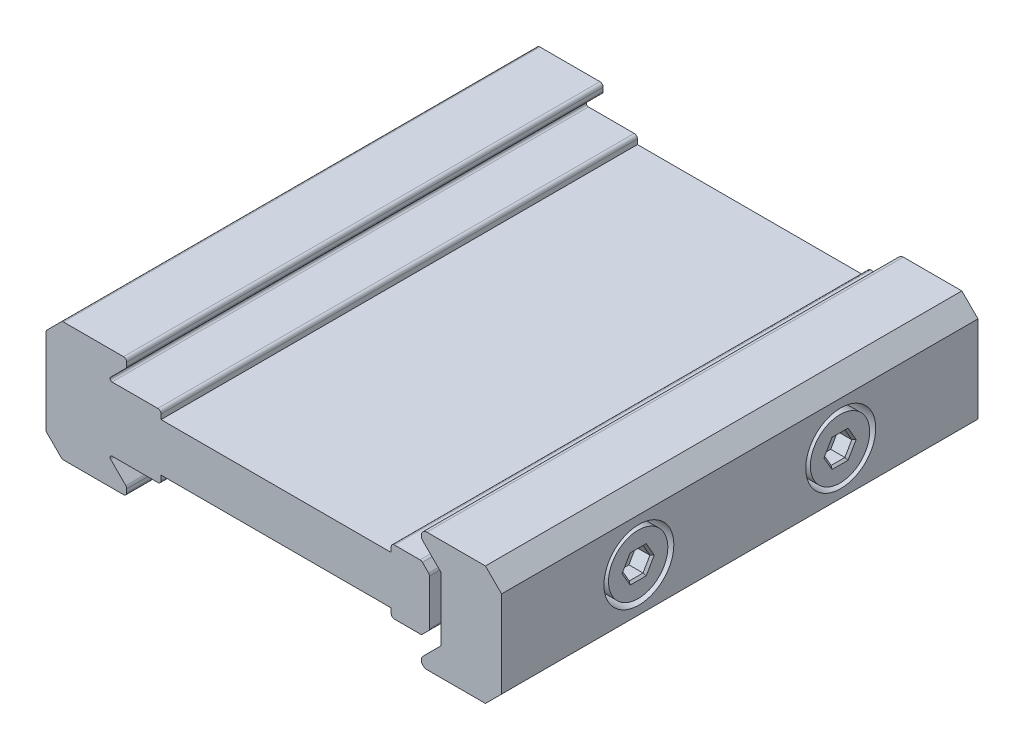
ISO-10303-21;
HEADER;
FILE_DESCRIPTION(('STEP AP214'),'2;1');
FILE_NAME('part.step','',(''),(''),'','','');
FILE_SCHEMA(('AUTOMOTIVE_DESIGN { 1 0 10303 214 1 1 1 1 }'));
ENDSEC;
DATA;
#1=APPLICATION_CONTEXT('core data for automotive mechanical design processes');
#2=APPLICATION_PROTOCOL_DEFINITION('international standard','automotive_design',2000,#1);
#3=PRODUCT_CONTEXT('',#1,'mechanical');
#4=PRODUCT('Part','Part','',(#3));
#5=PRODUCT_RELATED_PRODUCT_CATEGORY('part','',(#4));
#6=PRODUCT_DEFINITION_FORMATION('','',#4);
#7=PRODUCT_DEFINITION_CONTEXT('part definition',#1,'design');
#8=PRODUCT_DEFINITION('design','',#6,#7);
#9=PRODUCT_DEFINITION_SHAPE('','',#8);
#10=(LENGTH_UNIT() NAMED_UNIT(*) SI_UNIT(.MILLI.,.METRE.));
#11=(NAMED_UNIT(*) PLANE_ANGLE_UNIT() SI_UNIT($,.RADIAN.));
#12=(NAMED_UNIT(*) SI_UNIT($,.STERADIAN.) SOLID_ANGLE_UNIT());
#13=UNCERTAINTY_MEASURE_WITH_UNIT(LENGTH_MEASURE(1.E-05),#10,'distance_accuracy_value','');
#14=(GEOMETRIC_REPRESENTATION_CONTEXT(3) GLOBAL_UNCERTAINTY_ASSIGNED_CONTEXT((#13)) GLOBAL_UNIT_ASSIGNED_CONTEXT((#10,
#11,#12)) REPRESENTATION_CONTEXT('',''));
#15=CARTESIAN_POINT('',(0.,0.,0.));
#16=DIRECTION('',(0.,0.,1.));
#17=DIRECTION('',(1.,0.,0.));
#18=AXIS2_PLACEMENT_3D('',#15,#16,#17);
#19=CARTESIAN_POINT('',(0.0798060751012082,1.39267471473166,-10.6845373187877));
#20=DIRECTION('',(0.,0.,1.));
#21=DIRECTION('',(1.,0.,0.));
#22=AXIS2_PLACEMENT_3D('',#19,#20,#21);
#23=CYLINDRICAL_SURFACE('',#22,0.203199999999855);
#24=CARTESIAN_POINT('',(0.0798060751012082,1.39267471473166,19.2874626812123));
#25=DIRECTION('',(0.,0.,1.));
#26=DIRECTION('',(1.,0.,0.));
#27=AXIS2_PLACEMENT_3D('',#24,#25,#26);
#28=CIRCLE('',#27,0.203199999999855);
#29=CARTESIAN_POINT('',(0.223490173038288,1.2489906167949,19.2874626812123));
#30=VERTEX_POINT('',#29);
#31=CARTESIAN_POINT('',(0.283006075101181,1.39267471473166,19.2874626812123));
#32=VERTEX_POINT('',#31);
#33=EDGE_CURVE('P0_E309',#30,#32,#28,.T.);
#34=ORIENTED_EDGE('',*,*,#33,.F.);
#35=DIRECTION('',(0.,0.,1.));
#36=VECTOR('',#35,1.);
#37=CARTESIAN_POINT('',(0.223490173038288,1.2489906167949,-10.6845373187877));
#38=LINE('',#37,#36);
#39=CARTESIAN_POINT('',(0.223490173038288,1.2489906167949,-10.6845373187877));
#40=VERTEX_POINT('',#39);
#41=EDGE_CURVE('P0_E11',#40,#30,#38,.T.);
#42=ORIENTED_EDGE('',*,*,#41,.F.);
#43=CARTESIAN_POINT('',(0.0798060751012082,1.39267471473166,-10.6845373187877));
#44=DIRECTION('',(0.,0.,1.));
#45=DIRECTION('',(1.,0.,0.));
#46=AXIS2_PLACEMENT_3D('',#43,#44,#45);
#47=CIRCLE('',#46,0.203199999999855);
#48=CARTESIAN_POINT('',(0.283006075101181,1.39267471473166,-10.6845373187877));
#49=VERTEX_POINT('',#48);
#50=EDGE_CURVE('P0_E426',#40,#49,#47,.T.);
#51=ORIENTED_EDGE('',*,*,#50,.T.);
#52=DIRECTION('',(0.,0.,1.));
#53=VECTOR('',#52,1.);
#54=CARTESIAN_POINT('',(0.283006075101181,1.39267471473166,-10.6845373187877));
#55=LINE('',#54,#53);
#56=EDGE_CURVE('P0_E20',#49,#32,#55,.T.);
#57=ORIENTED_EDGE('',*,*,#56,.T.);
#58=EDGE_LOOP('',(#34,#42,#51,#57));
#59=FACE_BOUND('',#58,.T.);
#60=ADVANCED_FACE('P0_F17',(#59),#23,.T.);
#61=CARTESIAN_POINT('',(-0.165478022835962,0.860022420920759,-10.6845373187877));
#62=DIRECTION('',(0.707106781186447,-0.707106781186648,0.));
#63=DIRECTION('',(0.707106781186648,0.707106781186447,0.));
#64=AXIS2_PLACEMENT_3D('',#61,#62,#63);
#65=PLANE('',#64);
#66=DIRECTION('',(0.707106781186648,0.707106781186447,0.));
#67=VECTOR('',#66,1.);
#68=CARTESIAN_POINT('',(-0.165478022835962,0.860022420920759,19.2874626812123));
#69=LINE('',#68,#67);
#70=CARTESIAN_POINT('',(-0.165478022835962,0.860022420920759,19.2874626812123));
#71=VERTEX_POINT('',#70);
#72=EDGE_CURVE('P0_E424',#71,#30,#69,.T.);
#73=ORIENTED_EDGE('',*,*,#72,.F.);
#74=DIRECTION('',(0.,0.,1.));
#75=VECTOR('',#74,1.);
#76=CARTESIAN_POINT('',(-0.165478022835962,0.860022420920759,-10.6845373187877));
#77=LINE('',#76,#75);
#78=CARTESIAN_POINT('',(-0.165478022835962,0.860022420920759,-10.6845373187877));
#79=VERTEX_POINT('',#78);
#80=EDGE_CURVE('P0_E26',#79,#71,#77,.T.);
#81=ORIENTED_EDGE('',*,*,#80,.F.);
#82=DIRECTION('',(0.707106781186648,0.707106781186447,0.));
#83=VECTOR('',#82,1.);
#84=CARTESIAN_POINT('',(-0.165478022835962,0.860022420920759,-10.6845373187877));
#85=LINE('',#84,#83);
#86=EDGE_CURVE('P0_E299',#79,#40,#85,.T.);
#87=ORIENTED_EDGE('',*,*,#86,.T.);
#88=ORIENTED_EDGE('',*,*,#41,.T.);
#89=EDGE_LOOP('',(#73,#81,#87,#88));
#90=FACE_BOUND('',#89,.T.);
#91=ADVANCED_FACE('P0_F502',(#90),#65,.T.);
#92=CARTESIAN_POINT('',(-0.309162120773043,1.00370651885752,-10.6845373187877));
#93=DIRECTION('',(0.,0.,1.));
#94=DIRECTION('',(1.,0.,0.));
#95=AXIS2_PLACEMENT_3D('',#92,#93,#94);
#96=CYLINDRICAL_SURFACE('',#95,0.203199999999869);
#97=CARTESIAN_POINT('',(-0.309162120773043,1.00370651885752,19.2874626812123));
#98=DIRECTION('',(0.,0.,1.));
#99=DIRECTION('',(1.,0.,0.));
#100=AXIS2_PLACEMENT_3D('',#97,#98,#99);
#101=CIRCLE('',#100,0.203199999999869);
#102=CARTESIAN_POINT('',(-0.309162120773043,0.800506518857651,19.2874626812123));
#103=VERTEX_POINT('',#102);
#104=EDGE_CURVE('P0_E286',#103,#71,#101,.T.);
#105=ORIENTED_EDGE('',*,*,#104,.F.);
#106=DIRECTION('',(0.,0.,1.));
#107=VECTOR('',#106,1.);
#108=CARTESIAN_POINT('',(-0.309162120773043,0.800506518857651,-10.6845373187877));
#109=LINE('',#108,#107);
#110=CARTESIAN_POINT('',(-0.309162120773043,0.800506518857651,-10.6845373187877));
#111=VERTEX_POINT('',#110);
#112=EDGE_CURVE('P0_E281',#111,#103,#109,.T.);
#113=ORIENTED_EDGE('',*,*,#112,.F.);
#114=CARTESIAN_POINT('',(-0.309162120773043,1.00370651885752,-10.6845373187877));
#115=DIRECTION('',(0.,0.,1.));
#116=DIRECTION('',(1.,0.,0.));
#117=AXIS2_PLACEMENT_3D('',#114,#115,#116);
#118=CIRCLE('',#117,0.203199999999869);
#119=EDGE_CURVE('P0_E284',#111,#79,#118,.T.);
#120=ORIENTED_EDGE('',*,*,#119,.T.);
#121=ORIENTED_EDGE('',*,*,#80,.T.);
#122=EDGE_LOOP('',(#105,#113,#120,#121));
#123=FACE_BOUND('',#122,.T.);
#124=ADVANCED_FACE('P0_F283',(#123),#96,.T.);
#125=CARTESIAN_POINT('',(-1.92679392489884,0.800506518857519,-10.6845373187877));
#126=DIRECTION('',(0.,-1.,0.));
#127=DIRECTION('',(0.,0.,-1.));
#128=AXIS2_PLACEMENT_3D('',#125,#126,#127);
#129=PLANE('',#128);
#130=DIRECTION('',(1.,0.,0.));
#131=VECTOR('',#130,1.);
#132=CARTESIAN_POINT('',(-1.92679392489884,0.800506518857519,19.2874626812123));
#133=LINE('',#132,#131);
#134=CARTESIAN_POINT('',(-1.92679392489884,0.800506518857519,19.2874626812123));
#135=VERTEX_POINT('',#134);
#136=EDGE_CURVE('P0_E421',#135,#103,#133,.T.);
#137=ORIENTED_EDGE('',*,*,#136,.F.);
#138=DIRECTION('',(0.,0.,1.));
#139=VECTOR('',#138,1.);
#140=CARTESIAN_POINT('',(-1.92679392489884,0.800506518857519,-10.6845373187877));
#141=LINE('',#140,#139);
#142=CARTESIAN_POINT('',(-1.92679392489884,0.800506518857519,-10.6845373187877));
#143=VERTEX_POINT('',#142);
#144=EDGE_CURVE('P0_E291',#143,#135,#141,.T.);
#145=ORIENTED_EDGE('',*,*,#144,.F.);
#146=DIRECTION('',(1.,0.,0.));
#147=VECTOR('',#146,1.);
#148=CARTESIAN_POINT('',(-1.92679392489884,0.800506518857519,-10.6845373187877));
#149=LINE('',#148,#147);
#150=EDGE_CURVE('P0_E297',#143,#111,#149,.T.);
#151=ORIENTED_EDGE('',*,*,#150,.T.);
#152=ORIENTED_EDGE('',*,*,#112,.T.);
#153=EDGE_LOOP('',(#137,#145,#151,#152));
#154=FACE_BOUND('',#153,.T.);
#155=ADVANCED_FACE('P0_F301',(#154),#129,.T.);
#156=CARTESIAN_POINT('',(-1.92679392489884,1.00370651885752,-10.6845373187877));
#157=DIRECTION('',(0.,0.,1.));
#158=DIRECTION('',(1.,0.,0.));
#159=AXIS2_PLACEMENT_3D('',#156,#157,#158);
#160=CYLINDRICAL_SURFACE('',#159,0.203200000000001);
#161=CARTESIAN_POINT('',(-1.92679392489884,1.00370651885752,19.2874626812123));
#162=DIRECTION('',(0.,0.,1.));
#163=DIRECTION('',(1.,0.,0.));
#164=AXIS2_PLACEMENT_3D('',#161,#162,#163);
#165=CIRCLE('',#164,0.203200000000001);
#166=CARTESIAN_POINT('',(-2.12999392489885,1.00370651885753,19.2874626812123));
#167=VERTEX_POINT('',#166);
#168=EDGE_CURVE('P0_E418',#167,#135,#165,.T.);
#169=ORIENTED_EDGE('',*,*,#168,.F.);
#170=DIRECTION('',(0.,0.,1.));
#171=VECTOR('',#170,1.);
#172=CARTESIAN_POINT('',(-2.12999392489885,1.00370651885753,-10.6845373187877));
#173=LINE('',#172,#171);
#174=CARTESIAN_POINT('',(-2.12999392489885,1.00370651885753,-10.6845373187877));
#175=VERTEX_POINT('',#174);
#176=EDGE_CURVE('P0_E430',#175,#167,#173,.T.);
#177=ORIENTED_EDGE('',*,*,#176,.F.);
#178=CARTESIAN_POINT('',(-1.92679392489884,1.00370651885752,-10.6845373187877));
#179=DIRECTION('',(0.,0.,1.));
#180=DIRECTION('',(1.,0.,0.));
#181=AXIS2_PLACEMENT_3D('',#178,#179,#180);
#182=CIRCLE('',#181,0.203200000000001);
#183=EDGE_CURVE('P0_E302',#175,#143,#182,.T.);
#184=ORIENTED_EDGE('',*,*,#183,.T.);
#185=ORIENTED_EDGE('',*,*,#144,.T.);
#186=EDGE_LOOP('',(#169,#177,#184,#185));
#187=FACE_BOUND('',#186,.T.);
#188=ADVANCED_FACE('P0_F516',(#187),#160,.T.);
#189=CARTESIAN_POINT('',(-2.12999392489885,1.00370651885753,-10.6845373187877));
#190=DIRECTION('',(-1.,0.,0.));
#191=DIRECTION('',(0.,0.,1.));
#192=AXIS2_PLACEMENT_3D('',#189,#190,#191);
#193=PLANE('',#192);
#194=DIRECTION('',(0.,-1.,0.));
#195=VECTOR('',#194,1.);
#196=CARTESIAN_POINT('',(-2.12999392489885,1.00370651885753,19.2874626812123));
#197=LINE('',#196,#195);
#198=CARTESIAN_POINT('',(-2.12999392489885,1.30850651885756,19.2874626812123));
#199=VERTEX_POINT('',#198);
#200=EDGE_CURVE('P0_E415',#199,#167,#197,.T.);
#201=ORIENTED_EDGE('',*,*,#200,.F.);
#202=DIRECTION('',(0.,0.,1.));
#203=VECTOR('',#202,1.);
#204=CARTESIAN_POINT('',(-2.12999392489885,1.30850651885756,-10.6845373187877));
#205=LINE('',#204,#203);
#206=CARTESIAN_POINT('',(-2.12999392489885,1.30850651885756,-10.6845373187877));
#207=VERTEX_POINT('',#206);
#208=EDGE_CURVE('P0_E432',#207,#199,#205,.T.);
#209=ORIENTED_EDGE('',*,*,#208,.F.);
#210=DIRECTION('',(0.,-1.,0.));
#211=VECTOR('',#210,1.);
#212=CARTESIAN_POINT('',(-2.12999392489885,1.00370651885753,-10.6845373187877));
#213=LINE('',#212,#211);
#214=EDGE_CURVE('P0_E304',#207,#175,#213,.T.);
#215=ORIENTED_EDGE('',*,*,#214,.T.);
#216=ORIENTED_EDGE('',*,*,#176,.T.);
#217=EDGE_LOOP('',(#201,#209,#215,#216));
#218=FACE_BOUND('',#217,.T.);
#219=ADVANCED_FACE('P0_F519',(#218),#193,.T.);
#220=CARTESIAN_POINT('',(-16.6079939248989,1.30850651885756,-10.6845373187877));
#221=DIRECTION('',(0.,-1.,0.));
#222=DIRECTION('',(0.,0.,-1.));
#223=AXIS2_PLACEMENT_3D('',#220,#221,#222);
#224=PLANE('',#223);
#225=DIRECTION('',(1.,0.,0.));
#226=VECTOR('',#225,1.);
#227=CARTESIAN_POINT('',(-16.6079939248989,1.30850651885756,19.2874626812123));
#228=LINE('',#227,#226);
#229=CARTESIAN_POINT('',(-16.6079939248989,1.30850651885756,19.2874626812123));
#230=VERTEX_POINT('',#229);
#231=EDGE_CURVE('P0_E412',#230,#199,#228,.T.);
#232=ORIENTED_EDGE('',*,*,#231,.F.);
#233=DIRECTION('',(0.,0.,1.));
#234=VECTOR('',#233,1.);
#235=CARTESIAN_POINT('',(-16.6079939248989,1.30850651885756,-10.6845373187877));
#236=LINE('',#235,#234);
#237=CARTESIAN_POINT('',(-16.6079939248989,1.30850651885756,-10.6845373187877));
#238=VERTEX_POINT('',#237);
#239=EDGE_CURVE('P0_E434',#238,#230,#236,.T.);
#240=ORIENTED_EDGE('',*,*,#239,.F.);
#241=DIRECTION('',(1.,0.,0.));
#242=VECTOR('',#241,1.);
#243=CARTESIAN_POINT('',(-16.6079939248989,1.30850651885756,-10.6845373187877));
#244=LINE('',#243,#242);
#245=EDGE_CURVE('P0_E773',#238,#207,#244,.T.);
#246=ORIENTED_EDGE('',*,*,#245,.T.);
#247=ORIENTED_EDGE('',*,*,#208,.T.);
#248=EDGE_LOOP('',(#232,#240,#246,#247));
#249=FACE_BOUND('',#248,.T.);
#250=ADVANCED_FACE('P0_F523',(#249),#224,.T.);
#251=CARTESIAN_POINT('',(-16.6079939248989,1.00370651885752,-10.6845373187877));
#252=DIRECTION('',(1.,0.,0.));
#253=DIRECTION('',(0.,0.,-1.));
#254=AXIS2_PLACEMENT_3D('',#251,#252,#253);
#255=PLANE('',#254);
#256=DIRECTION('',(0.,1.,0.));
#257=VECTOR('',#256,1.);
#258=CARTESIAN_POINT('',(-16.6079939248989,1.00370651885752,19.2874626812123));
#259=LINE('',#258,#257);
#260=CARTESIAN_POINT('',(-16.6079939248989,1.00370651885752,19.2874626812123));
#261=VERTEX_POINT('',#260);
#262=EDGE_CURVE('P0_E409',#261,#230,#259,.T.);
#263=ORIENTED_EDGE('',*,*,#262,.F.);
#264=DIRECTION('',(0.,0.,1.));
#265=VECTOR('',#264,1.);
#266=CARTESIAN_POINT('',(-16.6079939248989,1.00370651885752,-10.6845373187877));
#267=LINE('',#266,#265);
#268=CARTESIAN_POINT('',(-16.6079939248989,1.00370651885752,-10.6845373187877));
#269=VERTEX_POINT('',#268);
#270=EDGE_CURVE('P0_E436',#269,#261,#267,.T.);
#271=ORIENTED_EDGE('',*,*,#270,.F.);
#272=DIRECTION('',(0.,1.,0.));
#273=VECTOR('',#272,1.);
#274=CARTESIAN_POINT('',(-16.6079939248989,1.00370651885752,-10.6845373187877));
#275=LINE('',#274,#273);
#276=EDGE_CURVE('P0_E770',#269,#238,#275,.T.);
#277=ORIENTED_EDGE('',*,*,#276,.T.);
#278=ORIENTED_EDGE('',*,*,#239,.T.);
#279=EDGE_LOOP('',(#263,#271,#277,#278));
#280=FACE_BOUND('',#279,.T.);
#281=ADVANCED_FACE('P0_F527',(#280),#255,.T.);
#282=CARTESIAN_POINT('',(-16.8111939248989,1.00370651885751,-10.6845373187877));
#283=DIRECTION('',(0.,0.,1.));
#284=DIRECTION('',(1.,0.,0.));
#285=AXIS2_PLACEMENT_3D('',#282,#283,#284);
#286=CYLINDRICAL_SURFACE('',#285,0.203199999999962);
#287=CARTESIAN_POINT('',(-16.8111939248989,1.00370651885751,19.2874626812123));
#288=DIRECTION('',(0.,0.,1.));
#289=DIRECTION('',(1.,0.,0.));
#290=AXIS2_PLACEMENT_3D('',#287,#288,#289);
#291=CIRCLE('',#290,0.203199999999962);
#292=CARTESIAN_POINT('',(-16.8111939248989,0.80050651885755,19.2874626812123));
#293=VERTEX_POINT('',#292);
#294=EDGE_CURVE('P0_E406',#293,#261,#291,.T.);
#295=ORIENTED_EDGE('',*,*,#294,.F.);
#296=DIRECTION('',(0.,0.,1.));
#297=VECTOR('',#296,1.);
#298=CARTESIAN_POINT('',(-16.8111939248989,0.80050651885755,-10.6845373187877));
#299=LINE('',#298,#297);
#300=CARTESIAN_POINT('',(-16.8111939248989,0.80050651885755,-10.6845373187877));
#301=VERTEX_POINT('',#300);
#302=EDGE_CURVE('P0_E438',#301,#293,#299,.T.);
#303=ORIENTED_EDGE('',*,*,#302,.F.);
#304=CARTESIAN_POINT('',(-16.8111939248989,1.00370651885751,-10.6845373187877));
#305=DIRECTION('',(0.,0.,1.));
#306=DIRECTION('',(1.,0.,0.));
#307=AXIS2_PLACEMENT_3D('',#304,#305,#306);
#308=CIRCLE('',#307,0.203199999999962);
#309=EDGE_CURVE('P0_E767',#301,#269,#308,.T.);
#310=ORIENTED_EDGE('',*,*,#309,.T.);
#311=ORIENTED_EDGE('',*,*,#270,.T.);
#312=EDGE_LOOP('',(#295,#303,#310,#311));
#313=FACE_BOUND('',#312,.T.);
#314=ADVANCED_FACE('P0_F531',(#313),#286,.T.);
#315=CARTESIAN_POINT('',(-19.6922888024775,0.800506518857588,-10.6845373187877));
#316=DIRECTION('',(0.,-1.,0.));
#317=DIRECTION('',(0.,0.,-1.));
#318=AXIS2_PLACEMENT_3D('',#315,#316,#317);
#319=PLANE('',#318);
#320=DIRECTION('',(1.,0.,0.));
#321=VECTOR('',#320,1.);
#322=CARTESIAN_POINT('',(-19.6922888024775,0.800506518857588,19.2874626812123));
#323=LINE('',#322,#321);
#324=CARTESIAN_POINT('',(-19.6922888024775,0.800506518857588,19.2874626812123));
#325=VERTEX_POINT('',#324);
#326=EDGE_CURVE('P0_E403',#325,#293,#323,.T.);
#327=ORIENTED_EDGE('',*,*,#326,.F.);
#328=DIRECTION('',(0.,0.,1.));
#329=VECTOR('',#328,1.);
#330=CARTESIAN_POINT('',(-19.6922888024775,0.800506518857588,-10.6845373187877));
#331=LINE('',#330,#329);
#332=CARTESIAN_POINT('',(-19.6922888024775,0.800506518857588,-10.6845373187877));
#333=VERTEX_POINT('',#332);
#334=EDGE_CURVE('P0_E440',#333,#325,#331,.T.);
#335=ORIENTED_EDGE('',*,*,#334,.F.);
#336=DIRECTION('',(1.,0.,0.));
#337=VECTOR('',#336,1.);
#338=CARTESIAN_POINT('',(-19.6922888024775,0.800506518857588,-10.6845373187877));
#339=LINE('',#338,#337);
#340=EDGE_CURVE('P0_E764',#333,#301,#339,.T.);
#341=ORIENTED_EDGE('',*,*,#340,.T.);
#342=ORIENTED_EDGE('',*,*,#302,.T.);
#343=EDGE_LOOP('',(#327,#335,#341,#342));
#344=FACE_BOUND('',#343,.T.);
#345=ADVANCED_FACE('P0_F535',(#344),#319,.T.);
#346=CARTESIAN_POINT('',(-19.6922888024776,0.673506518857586,-10.6845373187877));
#347=DIRECTION('',(0.,0.,1.));
#348=DIRECTION('',(1.,0.,0.));
#349=AXIS2_PLACEMENT_3D('',#346,#347,#348);
#350=CYLINDRICAL_SURFACE('',#349,0.126999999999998);
#351=CARTESIAN_POINT('',(-19.6922888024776,0.673506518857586,19.2874626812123));
#352=DIRECTION('',(0.,0.,-1.));
#353=DIRECTION('',(1.,0.,0.));
#354=AXIS2_PLACEMENT_3D('',#351,#352,#353);
#355=CIRCLE('',#354,0.126999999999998);
#356=CARTESIAN_POINT('',(-19.7820913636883,0.583703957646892,19.2874626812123));
#357=VERTEX_POINT('',#356);
#358=EDGE_CURVE('P0_E400',#357,#325,#355,.T.);
#359=ORIENTED_EDGE('',*,*,#358,.F.);
#360=DIRECTION('',(0.,0.,1.));
#361=VECTOR('',#360,1.);
#362=CARTESIAN_POINT('',(-19.7820913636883,0.583703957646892,-10.6845373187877));
#363=LINE('',#362,#361);
#364=CARTESIAN_POINT('',(-19.7820913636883,0.583703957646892,-10.6845373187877));
#365=VERTEX_POINT('',#364);
#366=EDGE_CURVE('P0_E442',#365,#357,#363,.T.);
#367=ORIENTED_EDGE('',*,*,#366,.F.);
#368=CARTESIAN_POINT('',(-19.6922888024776,0.673506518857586,-10.6845373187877));
#369=DIRECTION('',(0.,0.,-1.));
#370=DIRECTION('',(1.,0.,0.));
#371=AXIS2_PLACEMENT_3D('',#368,#369,#370);
#372=CIRCLE('',#371,0.126999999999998);
#373=EDGE_CURVE('P0_E761',#365,#333,#372,.T.);
#374=ORIENTED_EDGE('',*,*,#373,.T.);
#375=ORIENTED_EDGE('',*,*,#334,.T.);
#376=EDGE_LOOP('',(#359,#367,#374,#375));
#377=FACE_BOUND('',#376,.T.);
#378=ADVANCED_FACE('P0_F539',(#377),#350,.F.);
#379=CARTESIAN_POINT('',(-19.7820913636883,0.583703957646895,-10.6845373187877));
#380=DIRECTION('',(0.707106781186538,0.707106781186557,0.));
#381=DIRECTION('',(-0.707106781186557,0.707106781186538,0.));
#382=AXIS2_PLACEMENT_3D('',#379,#380,#381);
#383=PLANE('',#382);
#384=DIRECTION('',(-0.707106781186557,0.707106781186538,0.));
#385=VECTOR('',#384,1.);
#386=CARTESIAN_POINT('',(-19.7820913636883,0.583703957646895,19.2874626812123));
#387=LINE('',#386,#385);
#388=CARTESIAN_POINT('',(-18.8265098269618,-0.37187757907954,19.2874626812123));
#389=VERTEX_POINT('',#388);
#390=EDGE_CURVE('P0_E397',#389,#357,#387,.T.);
#391=ORIENTED_EDGE('',*,*,#390,.F.);
#392=DIRECTION('',(0.,0.,1.));
#393=VECTOR('',#392,1.);
#394=CARTESIAN_POINT('',(-18.8265098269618,-0.37187757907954,-10.6845373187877));
#395=LINE('',#394,#393);
#396=CARTESIAN_POINT('',(-18.8265098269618,-0.37187757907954,-10.6845373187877));
#397=VERTEX_POINT('',#396);
#398=EDGE_CURVE('P0_E444',#397,#389,#395,.T.);
#399=ORIENTED_EDGE('',*,*,#398,.F.);
#400=DIRECTION('',(-0.707106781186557,0.707106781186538,0.));
#401=VECTOR('',#400,1.);
#402=CARTESIAN_POINT('',(-19.7820913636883,0.583703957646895,-10.6845373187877));
#403=LINE('',#402,#401);
#404=EDGE_CURVE('P0_E758',#397,#365,#403,.T.);
#405=ORIENTED_EDGE('',*,*,#404,.T.);
#406=ORIENTED_EDGE('',*,*,#366,.T.);
#407=EDGE_LOOP('',(#391,#399,#405,#406));
#408=FACE_BOUND('',#407,.T.);
#409=ADVANCED_FACE('P0_F543',(#408),#383,.T.);
#410=CARTESIAN_POINT('',(-18.9701939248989,-0.515561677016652,-10.6845373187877));
#411=DIRECTION('',(0.,0.,1.));
#412=DIRECTION('',(1.,0.,0.));
#413=AXIS2_PLACEMENT_3D('',#410,#411,#412);
#414=CYLINDRICAL_SURFACE('',#413,0.20320000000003);
#415=CARTESIAN_POINT('',(-18.9701939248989,-0.515561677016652,19.2874626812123));
#416=DIRECTION('',(0.,0.,1.));
#417=DIRECTION('',(1.,0.,0.));
#418=AXIS2_PLACEMENT_3D('',#415,#416,#417);
#419=CIRCLE('',#418,0.20320000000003);
#420=CARTESIAN_POINT('',(-18.7669939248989,-0.515561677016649,19.2874626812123));
#421=VERTEX_POINT('',#420);
#422=EDGE_CURVE('P0_E394',#421,#389,#419,.T.);
#423=ORIENTED_EDGE('',*,*,#422,.F.);
#424=DIRECTION('',(0.,0.,1.));
#425=VECTOR('',#424,1.);
#426=CARTESIAN_POINT('',(-18.7669939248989,-0.515561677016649,-10.6845373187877));
#427=LINE('',#426,#425);
#428=CARTESIAN_POINT('',(-18.7669939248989,-0.515561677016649,-10.6845373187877));
#429=VERTEX_POINT('',#428);
#430=EDGE_CURVE('P0_E446',#429,#421,#427,.T.);
#431=ORIENTED_EDGE('',*,*,#430,.F.);
#432=CARTESIAN_POINT('',(-18.9701939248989,-0.515561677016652,-10.6845373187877));
#433=DIRECTION('',(0.,0.,1.));
#434=DIRECTION('',(1.,0.,0.));
#435=AXIS2_PLACEMENT_3D('',#432,#433,#434);
#436=CIRCLE('',#435,0.20320000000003);
#437=EDGE_CURVE('P0_E755',#429,#397,#436,.T.);
#438=ORIENTED_EDGE('',*,*,#437,.T.);
#439=ORIENTED_EDGE('',*,*,#398,.T.);
#440=EDGE_LOOP('',(#423,#431,#438,#439));
#441=FACE_BOUND('',#440,.T.);
#442=ADVANCED_FACE('P0_F547',(#441),#414,.T.);
#443=CARTESIAN_POINT('',(-18.7669939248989,-0.736193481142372,-10.6845373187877));
#444=DIRECTION('',(1.,0.,0.));
#445=DIRECTION('',(0.,0.,-1.));
#446=AXIS2_PLACEMENT_3D('',#443,#444,#445);
#447=PLANE('',#446);
#448=DIRECTION('',(0.,1.,0.));
#449=VECTOR('',#448,1.);
#450=CARTESIAN_POINT('',(-18.7669939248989,-0.736193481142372,19.2874626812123));
#451=LINE('',#450,#449);
#452=CARTESIAN_POINT('',(-18.7669939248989,-0.736193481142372,19.2874626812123));
#453=VERTEX_POINT('',#452);
#454=EDGE_CURVE('P0_E391',#453,#421,#451,.T.);
#455=ORIENTED_EDGE('',*,*,#454,.F.);
#456=DIRECTION('',(0.,0.,1.));
#457=VECTOR('',#456,1.);
#458=CARTESIAN_POINT('',(-18.7669939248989,-0.736193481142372,-10.6845373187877));
#459=LINE('',#458,#457);
#460=CARTESIAN_POINT('',(-18.7669939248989,-0.736193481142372,-10.6845373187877));
#461=VERTEX_POINT('',#460);
#462=EDGE_CURVE('P0_E448',#461,#453,#459,.T.);
#463=ORIENTED_EDGE('',*,*,#462,.F.);
#464=DIRECTION('',(0.,1.,0.));
#465=VECTOR('',#464,1.);
#466=CARTESIAN_POINT('',(-18.7669939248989,-0.736193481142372,-10.6845373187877));
#467=LINE('',#466,#465);
#468=EDGE_CURVE('P0_E752',#461,#429,#467,.T.);
#469=ORIENTED_EDGE('',*,*,#468,.T.);
#470=ORIENTED_EDGE('',*,*,#430,.T.);
#471=EDGE_LOOP('',(#455,#463,#469,#470));
#472=FACE_BOUND('',#471,.T.);
#473=ADVANCED_FACE('P0_F551',(#472),#447,.T.);
#474=CARTESIAN_POINT('',(-18.9701939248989,-0.736193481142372,-10.6845373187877));
#475=DIRECTION('',(0.,0.,1.));
#476=DIRECTION('',(1.,0.,0.));
#477=AXIS2_PLACEMENT_3D('',#474,#475,#476);
#478=CYLINDRICAL_SURFACE('',#477,0.203200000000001);
#479=CARTESIAN_POINT('',(-18.9701939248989,-0.736193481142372,19.2874626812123));
#480=DIRECTION('',(0.,0.,1.));
#481=DIRECTION('',(1.,0.,0.));
#482=AXIS2_PLACEMENT_3D('',#479,#480,#481);
#483=CIRCLE('',#482,0.203200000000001);
#484=CARTESIAN_POINT('',(-18.9701939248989,-0.939393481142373,19.2874626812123));
#485=VERTEX_POINT('',#484);
#486=EDGE_CURVE('P0_E388',#485,#453,#483,.T.);
#487=ORIENTED_EDGE('',*,*,#486,.F.);
#488=DIRECTION('',(0.,0.,1.));
#489=VECTOR('',#488,1.);
#490=CARTESIAN_POINT('',(-18.9701939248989,-0.939393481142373,-10.6845373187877));
#491=LINE('',#490,#489);
#492=CARTESIAN_POINT('',(-18.9701939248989,-0.939393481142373,-10.6845373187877));
#493=VERTEX_POINT('',#492);
#494=EDGE_CURVE('P0_E450',#493,#485,#491,.T.);
#495=ORIENTED_EDGE('',*,*,#494,.F.);
#496=CARTESIAN_POINT('',(-18.9701939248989,-0.736193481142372,-10.6845373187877));
#497=DIRECTION('',(0.,0.,1.));
#498=DIRECTION('',(1.,0.,0.));
#499=AXIS2_PLACEMENT_3D('',#496,#497,#498);
#500=CIRCLE('',#499,0.203200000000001);
#501=EDGE_CURVE('P0_E749',#493,#461,#500,.T.);
#502=ORIENTED_EDGE('',*,*,#501,.T.);
#503=ORIENTED_EDGE('',*,*,#462,.T.);
#504=EDGE_LOOP('',(#487,#495,#502,#503));
#505=FACE_BOUND('',#504,.T.);
#506=ADVANCED_FACE('P0_F555',(#505),#478,.T.);
#507=CARTESIAN_POINT('',(-22.7468257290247,-0.939393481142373,-10.6845373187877));
#508=DIRECTION('',(0.,-1.,0.));
#509=DIRECTION('',(0.,0.,-1.));
#510=AXIS2_PLACEMENT_3D('',#507,#508,#509);
#511=PLANE('',#510);
#512=DIRECTION('',(1.,0.,0.));
#513=VECTOR('',#512,1.);
#514=CARTESIAN_POINT('',(-22.7468257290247,-0.939393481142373,19.2874626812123));
#515=LINE('',#514,#513);
#516=CARTESIAN_POINT('',(-22.7468257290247,-0.939393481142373,19.2874626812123));
#517=VERTEX_POINT('',#516);
#518=EDGE_CURVE('P0_E385',#517,#485,#515,.T.);
#519=ORIENTED_EDGE('',*,*,#518,.F.);
#520=DIRECTION('',(0.,0.,1.));
#521=VECTOR('',#520,1.);
#522=CARTESIAN_POINT('',(-22.7468257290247,-0.939393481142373,-10.6845373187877));
#523=LINE('',#522,#521);
#524=CARTESIAN_POINT('',(-22.7468257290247,-0.939393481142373,-10.6845373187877));
#525=VERTEX_POINT('',#524);
#526=EDGE_CURVE('P0_E452',#525,#517,#523,.T.);
#527=ORIENTED_EDGE('',*,*,#526,.F.);
#528=DIRECTION('',(1.,0.,0.));
#529=VECTOR('',#528,1.);
#530=CARTESIAN_POINT('',(-22.7468257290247,-0.939393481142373,-10.6845373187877));
#531=LINE('',#530,#529);
#532=EDGE_CURVE('P0_E746',#525,#493,#531,.T.);
#533=ORIENTED_EDGE('',*,*,#532,.T.);
#534=ORIENTED_EDGE('',*,*,#494,.T.);
#535=EDGE_LOOP('',(#519,#527,#533,#534));
#536=FACE_BOUND('',#535,.T.);
#537=ADVANCED_FACE('P0_F559',(#536),#511,.T.);
#538=CARTESIAN_POINT('',(-22.7468257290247,-0.736193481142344,-10.6845373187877));
#539=DIRECTION('',(0.,0.,1.));
#540=DIRECTION('',(1.,0.,0.));
#541=AXIS2_PLACEMENT_3D('',#538,#539,#540);
#542=CYLINDRICAL_SURFACE('',#541,0.20320000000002);
#543=CARTESIAN_POINT('',(-22.7468257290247,-0.736193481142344,19.2874626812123));
#544=DIRECTION('',(0.,0.,1.));
#545=DIRECTION('',(1.,0.,0.));
#546=AXIS2_PLACEMENT_3D('',#543,#544,#545);
#547=CIRCLE('',#546,0.20320000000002);
#548=CARTESIAN_POINT('',(-22.8905098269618,-0.879877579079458,19.2874626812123));
#549=VERTEX_POINT('',#548);
#550=EDGE_CURVE('P0_E382',#549,#517,#547,.T.);
#551=ORIENTED_EDGE('',*,*,#550,.F.);
#552=DIRECTION('',(0.,0.,1.));
#553=VECTOR('',#552,1.);
#554=CARTESIAN_POINT('',(-22.8905098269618,-0.879877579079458,-10.6845373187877));
#555=LINE('',#554,#553);
#556=CARTESIAN_POINT('',(-22.8905098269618,-0.879877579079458,-10.6845373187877));
#557=VERTEX_POINT('',#556);
#558=EDGE_CURVE('P0_E454',#557,#549,#555,.T.);
#559=ORIENTED_EDGE('',*,*,#558,.F.);
#560=CARTESIAN_POINT('',(-22.7468257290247,-0.736193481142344,-10.6845373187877));
#561=DIRECTION('',(0.,0.,1.));
#562=DIRECTION('',(1.,0.,0.));
#563=AXIS2_PLACEMENT_3D('',#560,#561,#562);
#564=CIRCLE('',#563,0.20320000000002);
#565=EDGE_CURVE('P0_E743',#557,#525,#564,.T.);
#566=ORIENTED_EDGE('',*,*,#565,.T.);
#567=ORIENTED_EDGE('',*,*,#526,.T.);
#568=EDGE_LOOP('',(#551,#559,#566,#567));
#569=FACE_BOUND('',#568,.T.);
#570=ADVANCED_FACE('P0_F563',(#569),#542,.T.);
#571=CARTESIAN_POINT('',(-22.8905098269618,-0.879877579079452,-10.6845373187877));
#572=DIRECTION('',(-0.707106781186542,-0.707106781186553,0.));
#573=DIRECTION('',(0.707106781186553,-0.707106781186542,0.));
#574=AXIS2_PLACEMENT_3D('',#571,#572,#573);
#575=PLANE('',#574);
#576=DIRECTION('',(0.707106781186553,-0.707106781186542,0.));
#577=VECTOR('',#576,1.);
#578=CARTESIAN_POINT('',(-22.8905098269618,-0.879877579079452,19.2874626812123));
#579=LINE('',#578,#577);
#580=CARTESIAN_POINT('',(-23.787478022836,0.0170906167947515,19.2874626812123));
#581=VERTEX_POINT('',#580);
#582=EDGE_CURVE('P0_E379',#581,#549,#579,.T.);
#583=ORIENTED_EDGE('',*,*,#582,.F.);
#584=DIRECTION('',(0.,0.,1.));
#585=VECTOR('',#584,1.);
#586=CARTESIAN_POINT('',(-23.787478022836,0.0170906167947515,-10.6845373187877));
#587=LINE('',#586,#585);
#588=CARTESIAN_POINT('',(-23.787478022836,0.0170906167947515,-10.6845373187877));
#589=VERTEX_POINT('',#588);
#590=EDGE_CURVE('P0_E456',#589,#581,#587,.T.);
#591=ORIENTED_EDGE('',*,*,#590,.F.);
#592=DIRECTION('',(0.707106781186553,-0.707106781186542,0.));
#593=VECTOR('',#592,1.);
#594=CARTESIAN_POINT('',(-22.8905098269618,-0.879877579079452,-10.6845373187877));
#595=LINE('',#594,#593);
#596=EDGE_CURVE('P0_E740',#589,#557,#595,.T.);
#597=ORIENTED_EDGE('',*,*,#596,.T.);
#598=ORIENTED_EDGE('',*,*,#558,.T.);
#599=EDGE_LOOP('',(#583,#591,#597,#598));
#600=FACE_BOUND('',#599,.T.);
#601=ADVANCED_FACE('P0_F567',(#600),#575,.T.);
#602=CARTESIAN_POINT('',(-23.6437939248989,0.160774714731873,-10.6845373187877));
#603=DIRECTION('',(0.,0.,1.));
#604=DIRECTION('',(1.,0.,0.));
#605=AXIS2_PLACEMENT_3D('',#602,#603,#604);
#606=CYLINDRICAL_SURFACE('',#605,0.203200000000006);
#607=CARTESIAN_POINT('',(-23.6437939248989,0.160774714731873,19.2874626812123));
#608=DIRECTION('',(0.,0.,1.));
#609=DIRECTION('',(1.,0.,0.));
#610=AXIS2_PLACEMENT_3D('',#607,#608,#609);
#611=CIRCLE('',#610,0.203200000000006);
#612=CARTESIAN_POINT('',(-23.8469939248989,0.160774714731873,19.2874626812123));
#613=VERTEX_POINT('',#612);
#614=EDGE_CURVE('P0_E376',#613,#581,#611,.T.);
#615=ORIENTED_EDGE('',*,*,#614,.F.);
#616=DIRECTION('',(0.,0.,1.));
#617=VECTOR('',#616,1.);
#618=CARTESIAN_POINT('',(-23.8469939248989,0.160774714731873,-10.6845373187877));
#619=LINE('',#618,#617);
#620=CARTESIAN_POINT('',(-23.8469939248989,0.160774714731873,-10.6845373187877));
#621=VERTEX_POINT('',#620);
#622=EDGE_CURVE('P0_E458',#621,#613,#619,.T.);
#623=ORIENTED_EDGE('',*,*,#622,.F.);
#624=CARTESIAN_POINT('',(-23.6437939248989,0.160774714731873,-10.6845373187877));
#625=DIRECTION('',(0.,0.,1.));
#626=DIRECTION('',(1.,0.,0.));
#627=AXIS2_PLACEMENT_3D('',#624,#625,#626);
#628=CIRCLE('',#627,0.203200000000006);
#629=EDGE_CURVE('P0_E737',#621,#589,#628,.T.);
#630=ORIENTED_EDGE('',*,*,#629,.T.);
#631=ORIENTED_EDGE('',*,*,#590,.T.);
#632=EDGE_LOOP('',(#615,#623,#630,#631));
#633=FACE_BOUND('',#632,.T.);
#634=ADVANCED_FACE('P0_F571',(#633),#606,.T.);
#635=CARTESIAN_POINT('',(-23.8469939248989,0.160774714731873,-10.6845373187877));
#636=DIRECTION('',(-1.,0.,0.));
#637=DIRECTION('',(0.,0.,1.));
#638=AXIS2_PLACEMENT_3D('',#635,#636,#637);
#639=PLANE('',#638);
#640=DIRECTION('',(0.,-1.,0.));
#641=VECTOR('',#640,1.);
#642=CARTESIAN_POINT('',(-23.8469939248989,0.160774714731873,19.2874626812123));
#643=LINE('',#642,#641);
#644=CARTESIAN_POINT('',(-23.8469939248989,5.4788383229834,19.2874626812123));
#645=VERTEX_POINT('',#644);
#646=EDGE_CURVE('P0_E373',#645,#613,#643,.T.);
#647=ORIENTED_EDGE('',*,*,#646,.F.);
#648=DIRECTION('',(0.,0.,1.));
#649=VECTOR('',#648,1.);
#650=CARTESIAN_POINT('',(-23.8469939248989,5.4788383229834,-10.6845373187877));
#651=LINE('',#650,#649);
#652=CARTESIAN_POINT('',(-23.8469939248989,5.4788383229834,-10.6845373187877));
#653=VERTEX_POINT('',#652);
#654=EDGE_CURVE('P0_E460',#653,#645,#651,.T.);
#655=ORIENTED_EDGE('',*,*,#654,.F.);
#656=DIRECTION('',(0.,-1.,0.));
#657=VECTOR('',#656,1.);
#658=CARTESIAN_POINT('',(-23.8469939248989,0.160774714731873,-10.6845373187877));
#659=LINE('',#658,#657);
#660=EDGE_CURVE('P0_E734',#653,#621,#659,.T.);
#661=ORIENTED_EDGE('',*,*,#660,.T.);
#662=ORIENTED_EDGE('',*,*,#622,.T.);
#663=EDGE_LOOP('',(#647,#655,#661,#662));
#664=FACE_BOUND('',#663,.T.);
#665=ADVANCED_FACE('P0_F575',(#664),#639,.T.);
#666=CARTESIAN_POINT('',(-23.6437939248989,5.4788383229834,-10.6845373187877));
#667=DIRECTION('',(0.,0.,1.));
#668=DIRECTION('',(1.,0.,0.));
#669=AXIS2_PLACEMENT_3D('',#666,#667,#668);
#670=CYLINDRICAL_SURFACE('',#669,0.203199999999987);
#671=CARTESIAN_POINT('',(-23.6437939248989,5.4788383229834,19.2874626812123));
#672=DIRECTION('',(0.,0.,1.));
#673=DIRECTION('',(1.,0.,0.));
#674=AXIS2_PLACEMENT_3D('',#671,#672,#673);
#675=CIRCLE('',#674,0.203199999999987);
#676=CARTESIAN_POINT('',(-23.787478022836,5.62252242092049,19.2874626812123));
#677=VERTEX_POINT('',#676);
#678=EDGE_CURVE('P0_E370',#677,#645,#675,.T.);
#679=ORIENTED_EDGE('',*,*,#678,.F.);
#680=DIRECTION('',(0.,0.,1.));
#681=VECTOR('',#680,1.);
#682=CARTESIAN_POINT('',(-23.787478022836,5.62252242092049,-10.6845373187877));
#683=LINE('',#682,#681);
#684=CARTESIAN_POINT('',(-23.787478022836,5.62252242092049,-10.6845373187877));
#685=VERTEX_POINT('',#684);
#686=EDGE_CURVE('P0_E462',#685,#677,#683,.T.);
#687=ORIENTED_EDGE('',*,*,#686,.F.);
#688=CARTESIAN_POINT('',(-23.6437939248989,5.4788383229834,-10.6845373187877));
#689=DIRECTION('',(0.,0.,1.));
#690=DIRECTION('',(1.,0.,0.));
#691=AXIS2_PLACEMENT_3D('',#688,#689,#690);
#692=CIRCLE('',#691,0.203199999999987);
#693=EDGE_CURVE('P0_E731',#685,#653,#692,.T.);
#694=ORIENTED_EDGE('',*,*,#693,.T.);
#695=ORIENTED_EDGE('',*,*,#654,.T.);
#696=EDGE_LOOP('',(#679,#687,#694,#695));
#697=FACE_BOUND('',#696,.T.);
#698=ADVANCED_FACE('P0_F579',(#697),#670,.T.);
#699=CARTESIAN_POINT('',(-23.787478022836,5.62252242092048,-10.6845373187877));
#700=DIRECTION('',(-0.707106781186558,0.707106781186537,0.));
#701=DIRECTION('',(-0.707106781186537,-0.707106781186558,0.));
#702=AXIS2_PLACEMENT_3D('',#699,#700,#701);
#703=PLANE('',#702);
#704=DIRECTION('',(-0.707106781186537,-0.707106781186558,0.));
#705=VECTOR('',#704,1.);
#706=CARTESIAN_POINT('',(-23.787478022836,5.62252242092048,19.2874626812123));
#707=LINE('',#706,#705);
#708=CARTESIAN_POINT('',(-22.8905098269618,6.5194906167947,19.2874626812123));
#709=VERTEX_POINT('',#708);
#710=EDGE_CURVE('P0_E367',#709,#677,#707,.T.);
#711=ORIENTED_EDGE('',*,*,#710,.F.);
#712=DIRECTION('',(0.,0.,1.));
#713=VECTOR('',#712,1.);
#714=CARTESIAN_POINT('',(-22.8905098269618,6.5194906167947,-10.6845373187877));
#715=LINE('',#714,#713);
#716=CARTESIAN_POINT('',(-22.8905098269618,6.5194906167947,-10.6845373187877));
#717=VERTEX_POINT('',#716);
#718=EDGE_CURVE('P0_E464',#717,#709,#715,.T.);
#719=ORIENTED_EDGE('',*,*,#718,.F.);
#720=DIRECTION('',(-0.707106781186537,-0.707106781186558,0.));
#721=VECTOR('',#720,1.);
#722=CARTESIAN_POINT('',(-23.787478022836,5.62252242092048,-10.6845373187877));
#723=LINE('',#722,#721);
#724=EDGE_CURVE('P0_E728',#717,#685,#723,.T.);
#725=ORIENTED_EDGE('',*,*,#724,.T.);
#726=ORIENTED_EDGE('',*,*,#686,.T.);
#727=EDGE_LOOP('',(#711,#719,#725,#726));
#728=FACE_BOUND('',#727,.T.);
#729=ADVANCED_FACE('P0_F583',(#728),#703,.T.);
#730=CARTESIAN_POINT('',(-22.7468257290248,6.37580651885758,-10.6845373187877));
#731=DIRECTION('',(0.,0.,1.));
#732=DIRECTION('',(1.,0.,0.));
#733=AXIS2_PLACEMENT_3D('',#730,#731,#732);
#734=CYLINDRICAL_SURFACE('',#733,0.203199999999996);
#735=CARTESIAN_POINT('',(-22.7468257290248,6.37580651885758,19.2874626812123));
#736=DIRECTION('',(0.,0.,1.));
#737=DIRECTION('',(1.,0.,0.));
#738=AXIS2_PLACEMENT_3D('',#735,#736,#737);
#739=CIRCLE('',#738,0.203199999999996);
#740=CARTESIAN_POINT('',(-22.7468257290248,6.57900651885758,19.2874626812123));
#741=VERTEX_POINT('',#740);
#742=EDGE_CURVE('P0_E364',#741,#709,#739,.T.);
#743=ORIENTED_EDGE('',*,*,#742,.F.);
#744=DIRECTION('',(0.,0.,1.));
#745=VECTOR('',#744,1.);
#746=CARTESIAN_POINT('',(-22.7468257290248,6.57900651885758,-10.6845373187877));
#747=LINE('',#746,#745);
#748=CARTESIAN_POINT('',(-22.7468257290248,6.57900651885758,-10.6845373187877));
#749=VERTEX_POINT('',#748);
#750=EDGE_CURVE('P0_E466',#749,#741,#747,.T.);
#751=ORIENTED_EDGE('',*,*,#750,.F.);
#752=CARTESIAN_POINT('',(-22.7468257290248,6.37580651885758,-10.6845373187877));
#753=DIRECTION('',(0.,0.,1.));
#754=DIRECTION('',(1.,0.,0.));
#755=AXIS2_PLACEMENT_3D('',#752,#753,#754);
#756=CIRCLE('',#755,0.203199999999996);
#757=EDGE_CURVE('P0_E725',#749,#717,#756,.T.);
#758=ORIENTED_EDGE('',*,*,#757,.T.);
#759=ORIENTED_EDGE('',*,*,#718,.T.);
#760=EDGE_LOOP('',(#743,#751,#758,#759));
#761=FACE_BOUND('',#760,.T.);
#762=ADVANCED_FACE('P0_F587',(#761),#734,.T.);
#763=CARTESIAN_POINT('',(-22.7468257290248,6.57900651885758,-10.6845373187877));
#764=DIRECTION('',(0.,1.,0.));
#765=DIRECTION('',(0.,0.,1.));
#766=AXIS2_PLACEMENT_3D('',#763,#764,#765);
#767=PLANE('',#766);
#768=DIRECTION('',(-1.,0.,0.));
#769=VECTOR('',#768,1.);
#770=CARTESIAN_POINT('',(-22.7468257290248,6.57900651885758,19.2874626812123));
#771=LINE('',#770,#769);
#772=CARTESIAN_POINT('',(-18.9701939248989,6.57900651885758,19.2874626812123));
#773=VERTEX_POINT('',#772);
#774=EDGE_CURVE('P0_E361',#773,#741,#771,.T.);
#775=ORIENTED_EDGE('',*,*,#774,.F.);
#776=DIRECTION('',(0.,0.,1.));
#777=VECTOR('',#776,1.);
#778=CARTESIAN_POINT('',(-18.9701939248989,6.57900651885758,-10.6845373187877));
#779=LINE('',#778,#777);
#780=CARTESIAN_POINT('',(-18.9701939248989,6.57900651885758,-10.6845373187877));
#781=VERTEX_POINT('',#780);
#782=EDGE_CURVE('P0_E468',#781,#773,#779,.T.);
#783=ORIENTED_EDGE('',*,*,#782,.F.);
#784=DIRECTION('',(-1.,0.,0.));
#785=VECTOR('',#784,1.);
#786=CARTESIAN_POINT('',(-22.7468257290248,6.57900651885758,-10.6845373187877));
#787=LINE('',#786,#785);
#788=EDGE_CURVE('P0_E722',#781,#749,#787,.T.);
#789=ORIENTED_EDGE('',*,*,#788,.T.);
#790=ORIENTED_EDGE('',*,*,#750,.T.);
#791=EDGE_LOOP('',(#775,#783,#789,#790));
#792=FACE_BOUND('',#791,.T.);
#793=ADVANCED_FACE('P0_F591',(#792),#767,.T.);
#794=CARTESIAN_POINT('',(-18.9701939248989,6.37580651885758,-10.6845373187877));
#795=DIRECTION('',(0.,0.,1.));
#796=DIRECTION('',(1.,0.,0.));
#797=AXIS2_PLACEMENT_3D('',#794,#795,#796);
#798=CYLINDRICAL_SURFACE('',#797,0.203200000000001);
#799=CARTESIAN_POINT('',(-18.9701939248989,6.37580651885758,19.2874626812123));
#800=DIRECTION('',(0.,0.,1.));
#801=DIRECTION('',(1.,0.,0.));
#802=AXIS2_PLACEMENT_3D('',#799,#800,#801);
#803=CIRCLE('',#802,0.203200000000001);
#804=CARTESIAN_POINT('',(-18.7669939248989,6.37580651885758,19.2874626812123));
#805=VERTEX_POINT('',#804);
#806=EDGE_CURVE('P0_E358',#805,#773,#803,.T.);
#807=ORIENTED_EDGE('',*,*,#806,.F.);
#808=DIRECTION('',(0.,0.,1.));
#809=VECTOR('',#808,1.);
#810=CARTESIAN_POINT('',(-18.7669939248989,6.37580651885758,-10.6845373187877));
#811=LINE('',#810,#809);
#812=CARTESIAN_POINT('',(-18.7669939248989,6.37580651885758,-10.6845373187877));
#813=VERTEX_POINT('',#812);
#814=EDGE_CURVE('P0_E470',#813,#805,#811,.T.);
#815=ORIENTED_EDGE('',*,*,#814,.F.);
#816=CARTESIAN_POINT('',(-18.9701939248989,6.37580651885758,-10.6845373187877));
#817=DIRECTION('',(0.,0.,1.));
#818=DIRECTION('',(1.,0.,0.));
#819=AXIS2_PLACEMENT_3D('',#816,#817,#818);
#820=CIRCLE('',#819,0.203200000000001);
#821=EDGE_CURVE('P0_E719',#813,#781,#820,.T.);
#822=ORIENTED_EDGE('',*,*,#821,.T.);
#823=ORIENTED_EDGE('',*,*,#782,.T.);
#824=EDGE_LOOP('',(#807,#815,#822,#823));
#825=FACE_BOUND('',#824,.T.);
#826=ADVANCED_FACE('P0_F595',(#825),#798,.T.);
#827=CARTESIAN_POINT('',(-18.7669939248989,6.15517471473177,-10.6845373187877));
#828=DIRECTION('',(1.,0.,0.));
#829=DIRECTION('',(0.,0.,-1.));
#830=AXIS2_PLACEMENT_3D('',#827,#828,#829);
#831=PLANE('',#830);
#832=DIRECTION('',(0.,1.,0.));
#833=VECTOR('',#832,1.);
#834=CARTESIAN_POINT('',(-18.7669939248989,6.15517471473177,19.2874626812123));
#835=LINE('',#834,#833);
#836=CARTESIAN_POINT('',(-18.7669939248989,6.15517471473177,19.2874626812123));
#837=VERTEX_POINT('',#836);
#838=EDGE_CURVE('P0_E355',#837,#805,#835,.T.);
#839=ORIENTED_EDGE('',*,*,#838,.F.);
#840=DIRECTION('',(0.,0.,1.));
#841=VECTOR('',#840,1.);
#842=CARTESIAN_POINT('',(-18.7669939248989,6.15517471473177,-10.6845373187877));
#843=LINE('',#842,#841);
#844=CARTESIAN_POINT('',(-18.7669939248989,6.15517471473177,-10.6845373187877));
#845=VERTEX_POINT('',#844);
#846=EDGE_CURVE('P0_E472',#845,#837,#843,.T.);
#847=ORIENTED_EDGE('',*,*,#846,.F.);
#848=DIRECTION('',(0.,1.,0.));
#849=VECTOR('',#848,1.);
#850=CARTESIAN_POINT('',(-18.7669939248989,6.15517471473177,-10.6845373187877));
#851=LINE('',#850,#849);
#852=EDGE_CURVE('P0_E716',#845,#813,#851,.T.);
#853=ORIENTED_EDGE('',*,*,#852,.T.);
#854=ORIENTED_EDGE('',*,*,#814,.T.);
#855=EDGE_LOOP('',(#839,#847,#853,#854));
#856=FACE_BOUND('',#855,.T.);
#857=ADVANCED_FACE('P0_F599',(#856),#831,.T.);
#858=CARTESIAN_POINT('',(-18.9701939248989,6.15517471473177,-10.6845373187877));
#859=DIRECTION('',(0.,0.,1.));
#860=DIRECTION('',(1.,0.,0.));
#861=AXIS2_PLACEMENT_3D('',#858,#859,#860);
#862=CYLINDRICAL_SURFACE('',#861,0.203199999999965);
#863=CARTESIAN_POINT('',(-18.9701939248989,6.15517471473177,19.2874626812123));
#864=DIRECTION('',(0.,0.,1.));
#865=DIRECTION('',(1.,0.,0.));
#866=AXIS2_PLACEMENT_3D('',#863,#864,#865);
#867=CIRCLE('',#866,0.203199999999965);
#868=CARTESIAN_POINT('',(-18.8265098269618,6.01149061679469,19.2874626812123));
#869=VERTEX_POINT('',#868);
#870=EDGE_CURVE('P0_E352',#869,#837,#867,.T.);
#871=ORIENTED_EDGE('',*,*,#870,.F.);
#872=DIRECTION('',(0.,0.,1.));
#873=VECTOR('',#872,1.);
#874=CARTESIAN_POINT('',(-18.8265098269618,6.01149061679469,-10.6845373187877));
#875=LINE('',#874,#873);
#876=CARTESIAN_POINT('',(-18.8265098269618,6.01149061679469,-10.6845373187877));
#877=VERTEX_POINT('',#876);
#878=EDGE_CURVE('P0_E474',#877,#869,#875,.T.);
#879=ORIENTED_EDGE('',*,*,#878,.F.);
#880=CARTESIAN_POINT('',(-18.9701939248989,6.15517471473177,-10.6845373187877));
#881=DIRECTION('',(0.,0.,1.));
#882=DIRECTION('',(1.,0.,0.));
#883=AXIS2_PLACEMENT_3D('',#880,#881,#882);
#884=CIRCLE('',#883,0.203199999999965);
#885=EDGE_CURVE('P0_E713',#877,#845,#884,.T.);
#886=ORIENTED_EDGE('',*,*,#885,.T.);
#887=ORIENTED_EDGE('',*,*,#846,.T.);
#888=EDGE_LOOP('',(#871,#879,#886,#887));
#889=FACE_BOUND('',#888,.T.);
#890=ADVANCED_FACE('P0_F603',(#889),#862,.T.);
#891=CARTESIAN_POINT('',(-19.7820913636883,5.05590908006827,-10.6845373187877));
#892=DIRECTION('',(0.70710678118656,-0.707106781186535,0.));
#893=DIRECTION('',(0.707106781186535,0.70710678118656,0.));
#894=AXIS2_PLACEMENT_3D('',#891,#892,#893);
#895=PLANE('',#894);
#896=DIRECTION('',(0.707106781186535,0.70710678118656,0.));
#897=VECTOR('',#896,1.);
#898=CARTESIAN_POINT('',(-19.7820913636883,5.05590908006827,19.2874626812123));
#899=LINE('',#898,#897);
#900=CARTESIAN_POINT('',(-19.7820913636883,5.05590908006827,19.2874626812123));
#901=VERTEX_POINT('',#900);
#902=EDGE_CURVE('P0_E349',#901,#869,#899,.T.);
#903=ORIENTED_EDGE('',*,*,#902,.F.);
#904=DIRECTION('',(0.,0.,1.));
#905=VECTOR('',#904,1.);
#906=CARTESIAN_POINT('',(-19.7820913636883,5.05590908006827,-10.6845373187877));
#907=LINE('',#906,#905);
#908=CARTESIAN_POINT('',(-19.7820913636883,5.05590908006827,-10.6845373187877));
#909=VERTEX_POINT('',#908);
#910=EDGE_CURVE('P0_E476',#909,#901,#907,.T.);
#911=ORIENTED_EDGE('',*,*,#910,.F.);
#912=DIRECTION('',(0.707106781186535,0.70710678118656,0.));
#913=VECTOR('',#912,1.);
#914=CARTESIAN_POINT('',(-19.7820913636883,5.05590908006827,-10.6845373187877));
#915=LINE('',#914,#913);
#916=EDGE_CURVE('P0_E710',#909,#877,#915,.T.);
#917=ORIENTED_EDGE('',*,*,#916,.T.);
#918=ORIENTED_EDGE('',*,*,#878,.T.);
#919=EDGE_LOOP('',(#903,#911,#917,#918));
#920=FACE_BOUND('',#919,.T.);
#921=ADVANCED_FACE('P0_F607',(#920),#895,.T.);
#922=CARTESIAN_POINT('',(-19.6922888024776,4.96610651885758,-10.6845373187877));
#923=DIRECTION('',(0.,0.,1.));
#924=DIRECTION('',(1.,0.,0.));
#925=AXIS2_PLACEMENT_3D('',#922,#923,#924);
#926=CYLINDRICAL_SURFACE('',#925,0.126999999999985);
#927=CARTESIAN_POINT('',(-19.6922888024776,4.96610651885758,19.2874626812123));
#928=DIRECTION('',(0.,0.,-1.));
#929=DIRECTION('',(1.,0.,0.));
#930=AXIS2_PLACEMENT_3D('',#927,#928,#929);
#931=CIRCLE('',#930,0.126999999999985);
#932=CARTESIAN_POINT('',(-19.6922888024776,4.8391065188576,19.2874626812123));
#933=VERTEX_POINT('',#932);
#934=EDGE_CURVE('P0_E346',#933,#901,#931,.T.);
#935=ORIENTED_EDGE('',*,*,#934,.F.);
#936=DIRECTION('',(0.,0.,1.));
#937=VECTOR('',#936,1.);
#938=CARTESIAN_POINT('',(-19.6922888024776,4.8391065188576,-10.6845373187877));
#939=LINE('',#938,#937);
#940=CARTESIAN_POINT('',(-19.6922888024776,4.8391065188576,-10.6845373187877));
#941=VERTEX_POINT('',#940);
#942=EDGE_CURVE('P0_E478',#941,#933,#939,.T.);
#943=ORIENTED_EDGE('',*,*,#942,.F.);
#944=CARTESIAN_POINT('',(-19.6922888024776,4.96610651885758,-10.6845373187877));
#945=DIRECTION('',(0.,0.,-1.));
#946=DIRECTION('',(1.,0.,0.));
#947=AXIS2_PLACEMENT_3D('',#944,#945,#946);
#948=CIRCLE('',#947,0.126999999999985);
#949=EDGE_CURVE('P0_E707',#941,#909,#948,.T.);
#950=ORIENTED_EDGE('',*,*,#949,.T.);
#951=ORIENTED_EDGE('',*,*,#910,.T.);
#952=EDGE_LOOP('',(#935,#943,#950,#951));
#953=FACE_BOUND('',#952,.T.);
#954=ADVANCED_FACE('P0_F611',(#953),#926,.F.);
#955=CARTESIAN_POINT('',(-19.6922888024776,4.83910651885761,-10.6845373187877));
#956=DIRECTION('',(0.,1.,0.));
#957=DIRECTION('',(0.,0.,1.));
#958=AXIS2_PLACEMENT_3D('',#955,#956,#957);
#959=PLANE('',#958);
#960=DIRECTION('',(-1.,0.,0.));
#961=VECTOR('',#960,1.);
#962=CARTESIAN_POINT('',(-19.6922888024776,4.83910651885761,19.2874626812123));
#963=LINE('',#962,#961);
#964=CARTESIAN_POINT('',(-16.811193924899,4.83910651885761,19.2874626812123));
#965=VERTEX_POINT('',#964);
#966=EDGE_CURVE('P0_E343',#965,#933,#963,.T.);
#967=ORIENTED_EDGE('',*,*,#966,.F.);
#968=DIRECTION('',(0.,0.,1.));
#969=VECTOR('',#968,1.);
#970=CARTESIAN_POINT('',(-16.811193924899,4.83910651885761,-10.6845373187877));
#971=LINE('',#970,#969);
#972=CARTESIAN_POINT('',(-16.811193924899,4.83910651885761,-10.6845373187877));
#973=VERTEX_POINT('',#972);
#974=EDGE_CURVE('P0_E480',#973,#965,#971,.T.);
#975=ORIENTED_EDGE('',*,*,#974,.F.);
#976=DIRECTION('',(-1.,0.,0.));
#977=VECTOR('',#976,1.);
#978=CARTESIAN_POINT('',(-19.6922888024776,4.83910651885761,-10.6845373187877));
#979=LINE('',#978,#977);
#980=EDGE_CURVE('P0_E704',#973,#941,#979,.T.);
#981=ORIENTED_EDGE('',*,*,#980,.T.);
#982=ORIENTED_EDGE('',*,*,#942,.T.);
#983=EDGE_LOOP('',(#967,#975,#981,#982));
#984=FACE_BOUND('',#983,.T.);
#985=ADVANCED_FACE('P0_F615',(#984),#959,.T.);
#986=CARTESIAN_POINT('',(-16.8111939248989,4.63590651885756,-10.6845373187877));
#987=DIRECTION('',(0.,0.,1.));
#988=DIRECTION('',(1.,0.,0.));
#989=AXIS2_PLACEMENT_3D('',#986,#987,#988);
#990=CYLINDRICAL_SURFACE('',#989,0.203200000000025);
#991=CARTESIAN_POINT('',(-16.8111939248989,4.63590651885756,19.2874626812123));
#992=DIRECTION('',(0.,0.,1.));
#993=DIRECTION('',(1.,0.,0.));
#994=AXIS2_PLACEMENT_3D('',#991,#992,#993);
#995=CIRCLE('',#994,0.203200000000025);
#996=CARTESIAN_POINT('',(-16.6079939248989,4.63590651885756,19.2874626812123));
#997=VERTEX_POINT('',#996);
#998=EDGE_CURVE('P0_E340',#997,#965,#995,.T.);
#999=ORIENTED_EDGE('',*,*,#998,.F.);
#1000=DIRECTION('',(0.,0.,1.));
#1001=VECTOR('',#1000,1.);
#1002=CARTESIAN_POINT('',(-16.6079939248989,4.63590651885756,-10.6845373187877));
#1003=LINE('',#1002,#1001);
#1004=CARTESIAN_POINT('',(-16.6079939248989,4.63590651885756,-10.6845373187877));
#1005=VERTEX_POINT('',#1004);
#1006=EDGE_CURVE('P0_E482',#1005,#997,#1003,.T.);
#1007=ORIENTED_EDGE('',*,*,#1006,.F.);
#1008=CARTESIAN_POINT('',(-16.8111939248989,4.63590651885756,-10.6845373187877));
#1009=DIRECTION('',(0.,0.,1.));
#1010=DIRECTION('',(1.,0.,0.));
#1011=AXIS2_PLACEMENT_3D('',#1008,#1009,#1010);
#1012=CIRCLE('',#1011,0.203200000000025);
#1013=EDGE_CURVE('P0_E701',#1005,#973,#1012,.T.);
#1014=ORIENTED_EDGE('',*,*,#1013,.T.);
#1015=ORIENTED_EDGE('',*,*,#974,.T.);
#1016=EDGE_LOOP('',(#999,#1007,#1014,#1015));
#1017=FACE_BOUND('',#1016,.T.);
#1018=ADVANCED_FACE('P0_F619',(#1017),#990,.T.);
#1019=CARTESIAN_POINT('',(-16.6079939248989,4.33110651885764,-10.6845373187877));
#1020=DIRECTION('',(1.,0.,0.));
#1021=DIRECTION('',(0.,0.,-1.));
#1022=AXIS2_PLACEMENT_3D('',#1019,#1020,#1021);
#1023=PLANE('',#1022);
#1024=DIRECTION('',(0.,1.,0.));
#1025=VECTOR('',#1024,1.);
#1026=CARTESIAN_POINT('',(-16.6079939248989,4.33110651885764,19.2874626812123));
#1027=LINE('',#1026,#1025);
#1028=CARTESIAN_POINT('',(-16.6079939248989,4.33110651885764,19.2874626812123));
#1029=VERTEX_POINT('',#1028);
#1030=EDGE_CURVE('P0_E337',#1029,#997,#1027,.T.);
#1031=ORIENTED_EDGE('',*,*,#1030,.F.);
#1032=DIRECTION('',(0.,0.,1.));
#1033=VECTOR('',#1032,1.);
#1034=CARTESIAN_POINT('',(-16.6079939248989,4.33110651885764,-10.6845373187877));
#1035=LINE('',#1034,#1033);
#1036=CARTESIAN_POINT('',(-16.6079939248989,4.33110651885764,-10.6845373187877));
#1037=VERTEX_POINT('',#1036);
#1038=EDGE_CURVE('P0_E484',#1037,#1029,#1035,.T.);
#1039=ORIENTED_EDGE('',*,*,#1038,.F.);
#1040=DIRECTION('',(0.,1.,0.));
#1041=VECTOR('',#1040,1.);
#1042=CARTESIAN_POINT('',(-16.6079939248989,4.33110651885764,-10.6845373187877));
#1043=LINE('',#1042,#1041);
#1044=EDGE_CURVE('P0_E698',#1037,#1005,#1043,.T.);
#1045=ORIENTED_EDGE('',*,*,#1044,.T.);
#1046=ORIENTED_EDGE('',*,*,#1006,.T.);
#1047=EDGE_LOOP('',(#1031,#1039,#1045,#1046));
#1048=FACE_BOUND('',#1047,.T.);
#1049=ADVANCED_FACE('P0_F623',(#1048),#1023,.T.);
#1050=CARTESIAN_POINT('',(-16.6079939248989,4.33110651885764,-10.6845373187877));
#1051=DIRECTION('',(0.,1.,0.));
#1052=DIRECTION('',(0.,0.,1.));
#1053=AXIS2_PLACEMENT_3D('',#1050,#1051,#1052);
#1054=PLANE('',#1053);
#1055=DIRECTION('',(-1.,0.,0.));
#1056=VECTOR('',#1055,1.);
#1057=CARTESIAN_POINT('',(-16.6079939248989,4.33110651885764,19.2874626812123));
#1058=LINE('',#1057,#1056);
#1059=CARTESIAN_POINT('',(-2.12999392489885,4.33110651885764,19.2874626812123));
#1060=VERTEX_POINT('',#1059);
#1061=EDGE_CURVE('P0_E334',#1060,#1029,#1058,.T.);
#1062=ORIENTED_EDGE('',*,*,#1061,.F.);
#1063=DIRECTION('',(0.,0.,1.));
#1064=VECTOR('',#1063,1.);
#1065=CARTESIAN_POINT('',(-2.12999392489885,4.33110651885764,-10.6845373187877));
#1066=LINE('',#1065,#1064);
#1067=CARTESIAN_POINT('',(-2.12999392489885,4.33110651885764,-10.6845373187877));
#1068=VERTEX_POINT('',#1067);
#1069=EDGE_CURVE('P0_E486',#1068,#1060,#1066,.T.);
#1070=ORIENTED_EDGE('',*,*,#1069,.F.);
#1071=DIRECTION('',(-1.,0.,0.));
#1072=VECTOR('',#1071,1.);
#1073=CARTESIAN_POINT('',(-16.6079939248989,4.33110651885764,-10.6845373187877));
#1074=LINE('',#1073,#1072);
#1075=EDGE_CURVE('P0_E695',#1068,#1037,#1074,.T.);
#1076=ORIENTED_EDGE('',*,*,#1075,.T.);
#1077=ORIENTED_EDGE('',*,*,#1038,.T.);
#1078=EDGE_LOOP('',(#1062,#1070,#1076,#1077));
#1079=FACE_BOUND('',#1078,.T.);
#1080=ADVANCED_FACE('P0_F627',(#1079),#1054,.T.);
#1081=CARTESIAN_POINT('',(-2.12999392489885,4.33110651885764,-10.6845373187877));
#1082=DIRECTION('',(-1.,0.,0.));
#1083=DIRECTION('',(0.,0.,1.));
#1084=AXIS2_PLACEMENT_3D('',#1081,#1082,#1083);
#1085=PLANE('',#1084);
#1086=DIRECTION('',(0.,-1.,0.));
#1087=VECTOR('',#1086,1.);
#1088=CARTESIAN_POINT('',(-2.12999392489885,4.33110651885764,19.2874626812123));
#1089=LINE('',#1088,#1087);
#1090=CARTESIAN_POINT('',(-2.12999392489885,4.63590651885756,19.2874626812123));
#1091=VERTEX_POINT('',#1090);
#1092=EDGE_CURVE('P0_E331',#1091,#1060,#1089,.T.);
#1093=ORIENTED_EDGE('',*,*,#1092,.F.);
#1094=DIRECTION('',(0.,0.,1.));
#1095=VECTOR('',#1094,1.);
#1096=CARTESIAN_POINT('',(-2.12999392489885,4.63590651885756,-10.6845373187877));
#1097=LINE('',#1096,#1095);
#1098=CARTESIAN_POINT('',(-2.12999392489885,4.63590651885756,-10.6845373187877));
#1099=VERTEX_POINT('',#1098);
#1100=EDGE_CURVE('P0_E488',#1099,#1091,#1097,.T.);
#1101=ORIENTED_EDGE('',*,*,#1100,.F.);
#1102=DIRECTION('',(0.,-1.,0.));
#1103=VECTOR('',#1102,1.);
#1104=CARTESIAN_POINT('',(-2.12999392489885,4.33110651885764,-10.6845373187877));
#1105=LINE('',#1104,#1103);
#1106=EDGE_CURVE('P0_E692',#1099,#1068,#1105,.T.);
#1107=ORIENTED_EDGE('',*,*,#1106,.T.);
#1108=ORIENTED_EDGE('',*,*,#1069,.T.);
#1109=EDGE_LOOP('',(#1093,#1101,#1107,#1108));
#1110=FACE_BOUND('',#1109,.T.);
#1111=ADVANCED_FACE('P0_F631',(#1110),#1085,.T.);
#1112=CARTESIAN_POINT('',(-1.92679392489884,4.63590651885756,-10.6845373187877));
#1113=DIRECTION('',(0.,0.,1.));
#1114=DIRECTION('',(1.,0.,0.));
#1115=AXIS2_PLACEMENT_3D('',#1112,#1113,#1114);
#1116=CYLINDRICAL_SURFACE('',#1115,0.203200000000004);
#1117=CARTESIAN_POINT('',(-1.92679392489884,4.63590651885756,19.2874626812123));
#1118=DIRECTION('',(0.,0.,1.));
#1119=DIRECTION('',(1.,0.,0.));
#1120=AXIS2_PLACEMENT_3D('',#1117,#1118,#1119);
#1121=CIRCLE('',#1120,0.203200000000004);
#1122=CARTESIAN_POINT('',(-1.92679392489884,4.83910651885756,19.2874626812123));
#1123=VERTEX_POINT('',#1122);
#1124=EDGE_CURVE('P0_E328',#1123,#1091,#1121,.T.);
#1125=ORIENTED_EDGE('',*,*,#1124,.F.);
#1126=DIRECTION('',(0.,0.,1.));
#1127=VECTOR('',#1126,1.);
#1128=CARTESIAN_POINT('',(-1.92679392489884,4.83910651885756,-10.6845373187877));
#1129=LINE('',#1128,#1127);
#1130=CARTESIAN_POINT('',(-1.92679392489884,4.83910651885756,-10.6845373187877));
#1131=VERTEX_POINT('',#1130);
#1132=EDGE_CURVE('P0_E490',#1131,#1123,#1129,.T.);
#1133=ORIENTED_EDGE('',*,*,#1132,.F.);
#1134=CARTESIAN_POINT('',(-1.92679392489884,4.63590651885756,-10.6845373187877));
#1135=DIRECTION('',(0.,0.,1.));
#1136=DIRECTION('',(1.,0.,0.));
#1137=AXIS2_PLACEMENT_3D('',#1134,#1135,#1136);
#1138=CIRCLE('',#1137,0.203200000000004);
#1139=EDGE_CURVE('P0_E689',#1131,#1099,#1138,.T.);
#1140=ORIENTED_EDGE('',*,*,#1139,.T.);
#1141=ORIENTED_EDGE('',*,*,#1100,.T.);
#1142=EDGE_LOOP('',(#1125,#1133,#1140,#1141));
#1143=FACE_BOUND('',#1142,.T.);
#1144=ADVANCED_FACE('P0_F635',(#1143),#1116,.T.);
#1145=CARTESIAN_POINT('',(-1.92679392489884,4.83910651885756,-10.6845373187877));
#1146=DIRECTION('',(0.,1.,0.));
#1147=DIRECTION('',(0.,0.,1.));
#1148=AXIS2_PLACEMENT_3D('',#1145,#1146,#1147);
#1149=PLANE('',#1148);
#1150=DIRECTION('',(-1.,0.,0.));
#1151=VECTOR('',#1150,1.);
#1152=CARTESIAN_POINT('',(-1.92679392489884,4.83910651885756,19.2874626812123));
#1153=LINE('',#1152,#1151);
#1154=CARTESIAN_POINT('',(-0.309162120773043,4.83910651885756,19.2874626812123));
#1155=VERTEX_POINT('',#1154);
#1156=EDGE_CURVE('P0_E325',#1155,#1123,#1153,.T.);
#1157=ORIENTED_EDGE('',*,*,#1156,.F.);
#1158=DIRECTION('',(0.,0.,1.));
#1159=VECTOR('',#1158,1.);
#1160=CARTESIAN_POINT('',(-0.309162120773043,4.83910651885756,-10.6845373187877));
#1161=LINE('',#1160,#1159);
#1162=CARTESIAN_POINT('',(-0.309162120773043,4.83910651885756,-10.6845373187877));
#1163=VERTEX_POINT('',#1162);
#1164=EDGE_CURVE('P0_E492',#1163,#1155,#1161,.T.);
#1165=ORIENTED_EDGE('',*,*,#1164,.F.);
#1166=DIRECTION('',(-1.,0.,0.));
#1167=VECTOR('',#1166,1.);
#1168=CARTESIAN_POINT('',(-1.92679392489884,4.83910651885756,-10.6845373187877));
#1169=LINE('',#1168,#1167);
#1170=EDGE_CURVE('P0_E686',#1163,#1131,#1169,.T.);
#1171=ORIENTED_EDGE('',*,*,#1170,.T.);
#1172=ORIENTED_EDGE('',*,*,#1132,.T.);
#1173=EDGE_LOOP('',(#1157,#1165,#1171,#1172));
#1174=FACE_BOUND('',#1173,.T.);
#1175=ADVANCED_FACE('P0_F639',(#1174),#1149,.T.);
#1176=CARTESIAN_POINT('',(-0.309162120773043,4.63590651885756,-10.6845373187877));
#1177=DIRECTION('',(0.,0.,1.));
#1178=DIRECTION('',(1.,0.,0.));
#1179=AXIS2_PLACEMENT_3D('',#1176,#1177,#1178);
#1180=CYLINDRICAL_SURFACE('',#1179,0.203200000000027);
#1181=CARTESIAN_POINT('',(-0.309162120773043,4.63590651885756,19.2874626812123));
#1182=DIRECTION('',(0.,0.,1.));
#1183=DIRECTION('',(1.,0.,0.));
#1184=AXIS2_PLACEMENT_3D('',#1181,#1182,#1183);
#1185=CIRCLE('',#1184,0.203200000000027);
#1186=CARTESIAN_POINT('',(-0.165478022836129,4.77959061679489,19.2874626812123));
#1187=VERTEX_POINT('',#1186);
#1188=EDGE_CURVE('P0_E322',#1187,#1155,#1185,.T.);
#1189=ORIENTED_EDGE('',*,*,#1188,.F.);
#1190=DIRECTION('',(0.,0.,1.));
#1191=VECTOR('',#1190,1.);
#1192=CARTESIAN_POINT('',(-0.165478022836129,4.77959061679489,-10.6845373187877));
#1193=LINE('',#1192,#1191);
#1194=CARTESIAN_POINT('',(-0.165478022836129,4.77959061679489,-10.6845373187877));
#1195=VERTEX_POINT('',#1194);
#1196=EDGE_CURVE('P0_E494',#1195,#1187,#1193,.T.);
#1197=ORIENTED_EDGE('',*,*,#1196,.F.);
#1198=CARTESIAN_POINT('',(-0.309162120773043,4.63590651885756,-10.6845373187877));
#1199=DIRECTION('',(0.,0.,1.));
#1200=DIRECTION('',(1.,0.,0.));
#1201=AXIS2_PLACEMENT_3D('',#1198,#1199,#1200);
#1202=CIRCLE('',#1201,0.203200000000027);
#1203=EDGE_CURVE('P0_E683',#1195,#1163,#1202,.T.);
#1204=ORIENTED_EDGE('',*,*,#1203,.T.);
#1205=ORIENTED_EDGE('',*,*,#1164,.T.);
#1206=EDGE_LOOP('',(#1189,#1197,#1204,#1205));
#1207=FACE_BOUND('',#1206,.T.);
#1208=ADVANCED_FACE('P0_F643',(#1207),#1180,.T.);
#1209=CARTESIAN_POINT('',(-0.165478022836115,4.77959061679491,-10.6845373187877));
#1210=DIRECTION('',(0.707106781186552,0.707106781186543,0.));
#1211=DIRECTION('',(-0.707106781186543,0.707106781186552,0.));
#1212=AXIS2_PLACEMENT_3D('',#1209,#1210,#1211);
#1213=PLANE('',#1212);
#1214=DIRECTION('',(-0.707106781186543,0.707106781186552,0.));
#1215=VECTOR('',#1214,1.);
#1216=CARTESIAN_POINT('',(-0.165478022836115,4.77959061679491,19.2874626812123));
#1217=LINE('',#1216,#1215);
#1218=CARTESIAN_POINT('',(0.223490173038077,4.39062242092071,19.2874626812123));
#1219=VERTEX_POINT('',#1218);
#1220=EDGE_CURVE('P0_E319',#1219,#1187,#1217,.T.);
#1221=ORIENTED_EDGE('',*,*,#1220,.F.);
#1222=DIRECTION('',(0.,0.,1.));
#1223=VECTOR('',#1222,1.);
#1224=CARTESIAN_POINT('',(0.223490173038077,4.39062242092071,-10.6845373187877));
#1225=LINE('',#1224,#1223);
#1226=CARTESIAN_POINT('',(0.223490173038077,4.39062242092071,-10.6845373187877));
#1227=VERTEX_POINT('',#1226);
#1228=EDGE_CURVE('P0_E496',#1227,#1219,#1225,.T.);
#1229=ORIENTED_EDGE('',*,*,#1228,.F.);
#1230=DIRECTION('',(-0.707106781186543,0.707106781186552,0.));
#1231=VECTOR('',#1230,1.);
#1232=CARTESIAN_POINT('',(-0.165478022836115,4.77959061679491,-10.6845373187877));
#1233=LINE('',#1232,#1231);
#1234=EDGE_CURVE('P0_E680',#1227,#1195,#1233,.T.);
#1235=ORIENTED_EDGE('',*,*,#1234,.T.);
#1236=ORIENTED_EDGE('',*,*,#1196,.T.);
#1237=EDGE_LOOP('',(#1221,#1229,#1235,#1236));
#1238=FACE_BOUND('',#1237,.T.);
#1239=ADVANCED_FACE('P0_F647',(#1238),#1213,.T.);
#1240=CARTESIAN_POINT('',(0.0798060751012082,4.24693832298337,-10.6845373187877));
#1241=DIRECTION('',(0.,0.,1.));
#1242=DIRECTION('',(1.,0.,0.));
#1243=AXIS2_PLACEMENT_3D('',#1240,#1241,#1242);
#1244=CYLINDRICAL_SURFACE('',#1243,0.203199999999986);
#1245=CARTESIAN_POINT('',(0.0798060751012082,4.24693832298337,19.2874626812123));
#1246=DIRECTION('',(0.,0.,1.));
#1247=DIRECTION('',(1.,0.,0.));
#1248=AXIS2_PLACEMENT_3D('',#1245,#1246,#1247);
#1249=CIRCLE('',#1248,0.203199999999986);
#1250=CARTESIAN_POINT('',(0.283006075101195,4.24693832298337,19.2874626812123));
#1251=VERTEX_POINT('',#1250);
#1252=EDGE_CURVE('P0_E316',#1251,#1219,#1249,.T.);
#1253=ORIENTED_EDGE('',*,*,#1252,.F.);
#1254=DIRECTION('',(0.,0.,1.));
#1255=VECTOR('',#1254,1.);
#1256=CARTESIAN_POINT('',(0.283006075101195,4.24693832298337,-10.6845373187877));
#1257=LINE('',#1256,#1255);
#1258=CARTESIAN_POINT('',(0.283006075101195,4.24693832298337,-10.6845373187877));
#1259=VERTEX_POINT('',#1258);
#1260=EDGE_CURVE('P0_E497',#1259,#1251,#1257,.T.);
#1261=ORIENTED_EDGE('',*,*,#1260,.F.);
#1262=CARTESIAN_POINT('',(0.0798060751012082,4.24693832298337,-10.6845373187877));
#1263=DIRECTION('',(0.,0.,1.));
#1264=DIRECTION('',(1.,0.,0.));
#1265=AXIS2_PLACEMENT_3D('',#1262,#1263,#1264);
#1266=CIRCLE('',#1265,0.203199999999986);
#1267=EDGE_CURVE('P0_E677',#1259,#1227,#1266,.T.);
#1268=ORIENTED_EDGE('',*,*,#1267,.T.);
#1269=ORIENTED_EDGE('',*,*,#1228,.T.);
#1270=EDGE_LOOP('',(#1253,#1261,#1268,#1269));
#1271=FACE_BOUND('',#1270,.T.);
#1272=ADVANCED_FACE('P0_F651',(#1271),#1244,.T.);
#1273=CARTESIAN_POINT('',(0.283006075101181,1.39267471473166,-10.6845373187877));
#1274=DIRECTION('',(1.,0.,0.));
#1275=DIRECTION('',(0.,0.,-1.));
#1276=AXIS2_PLACEMENT_3D('',#1273,#1274,#1275);
#1277=PLANE('',#1276);
#1278=CARTESIAN_POINT('',(0.283006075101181,2.81507471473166,10.6514626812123));
#1279=DIRECTION('',(1.,0.,0.));
#1280=DIRECTION('',(0.,0.,-1.));
#1281=AXIS2_PLACEMENT_3D('',#1278,#1279,#1280);
#1282=CIRCLE('',#1281,0.999999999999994);
#1283=CARTESIAN_POINT('',(0.283006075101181,2.81507471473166,9.65146268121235));
#1284=VERTEX_POINT('',#1283);
#1285=EDGE_CURVE('P0_E663',#1284,#1284,#1282,.T.);
#1286=ORIENTED_EDGE('',*,*,#1285,.F.);
#1287=EDGE_LOOP('',(#1286));
#1288=FACE_BOUND('',#1287,.T.);
#1289=CARTESIAN_POINT('',(0.283006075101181,2.76074321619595,-2.04842110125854));
#1290=DIRECTION('',(1.,0.,0.));
#1291=DIRECTION('',(0.,0.,-1.));
#1292=AXIS2_PLACEMENT_3D('',#1289,#1290,#1291);
#1293=CIRCLE('',#1292,0.999999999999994);
#1294=CARTESIAN_POINT('',(0.283006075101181,2.76074321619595,-3.04842110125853));
#1295=VERTEX_POINT('',#1294);
#1296=EDGE_CURVE('P0_E313',#1295,#1295,#1293,.T.);
#1297=ORIENTED_EDGE('',*,*,#1296,.F.);
#1298=EDGE_LOOP('',(#1297));
#1299=FACE_BOUND('',#1298,.T.);
#1300=DIRECTION('',(0.,1.,0.));
#1301=VECTOR('',#1300,1.);
#1302=CARTESIAN_POINT('',(0.283006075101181,1.39267471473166,19.2874626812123));
#1303=LINE('',#1302,#1301);
#1304=EDGE_CURVE('P0_E312',#32,#1251,#1303,.T.);
#1305=ORIENTED_EDGE('',*,*,#1304,.F.);
#1306=ORIENTED_EDGE('',*,*,#56,.F.);
#1307=DIRECTION('',(0.,1.,0.));
#1308=VECTOR('',#1307,1.);
#1309=CARTESIAN_POINT('',(0.283006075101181,1.39267471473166,-10.6845373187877));
#1310=LINE('',#1309,#1308);
#1311=EDGE_CURVE('P0_E675',#49,#1259,#1310,.T.);
#1312=ORIENTED_EDGE('',*,*,#1311,.T.);
#1313=ORIENTED_EDGE('',*,*,#1260,.T.);
#1314=EDGE_LOOP('',(#1305,#1306,#1312,#1313));
#1315=FACE_BOUND('',#1314,.T.);
#1316=ADVANCED_FACE('P0_F499',(#1288,#1299,#1315),#1277,.T.);
#1317=CARTESIAN_POINT('',(0.0798060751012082,1.39267471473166,-10.6845373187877));
#1318=DIRECTION('',(0.,0.,1.));
#1319=DIRECTION('',(1.,0.,0.));
#1320=AXIS2_PLACEMENT_3D('',#1317,#1318,#1319);
#1321=PLANE('',#1320);
#1322=ORIENTED_EDGE('',*,*,#50,.F.);
#1323=ORIENTED_EDGE('',*,*,#86,.F.);
#1324=ORIENTED_EDGE('',*,*,#119,.F.);
#1325=ORIENTED_EDGE('',*,*,#150,.F.);
#1326=ORIENTED_EDGE('',*,*,#183,.F.);
#1327=ORIENTED_EDGE('',*,*,#214,.F.);
#1328=ORIENTED_EDGE('',*,*,#245,.F.);
#1329=ORIENTED_EDGE('',*,*,#276,.F.);
#1330=ORIENTED_EDGE('',*,*,#309,.F.);
#1331=ORIENTED_EDGE('',*,*,#340,.F.);
#1332=ORIENTED_EDGE('',*,*,#373,.F.);
#1333=ORIENTED_EDGE('',*,*,#404,.F.);
#1334=ORIENTED_EDGE('',*,*,#437,.F.);
#1335=ORIENTED_EDGE('',*,*,#468,.F.);
#1336=ORIENTED_EDGE('',*,*,#501,.F.);
#1337=ORIENTED_EDGE('',*,*,#532,.F.);
#1338=ORIENTED_EDGE('',*,*,#565,.F.);
#1339=ORIENTED_EDGE('',*,*,#596,.F.);
#1340=ORIENTED_EDGE('',*,*,#629,.F.);
#1341=ORIENTED_EDGE('',*,*,#660,.F.);
#1342=ORIENTED_EDGE('',*,*,#693,.F.);
#1343=ORIENTED_EDGE('',*,*,#724,.F.);
#1344=ORIENTED_EDGE('',*,*,#757,.F.);
#1345=ORIENTED_EDGE('',*,*,#788,.F.);
#1346=ORIENTED_EDGE('',*,*,#821,.F.);
#1347=ORIENTED_EDGE('',*,*,#852,.F.);
#1348=ORIENTED_EDGE('',*,*,#885,.F.);
#1349=ORIENTED_EDGE('',*,*,#916,.F.);
#1350=ORIENTED_EDGE('',*,*,#949,.F.);
#1351=ORIENTED_EDGE('',*,*,#980,.F.);
#1352=ORIENTED_EDGE('',*,*,#1013,.F.);
#1353=ORIENTED_EDGE('',*,*,#1044,.F.);
#1354=ORIENTED_EDGE('',*,*,#1075,.F.);
#1355=ORIENTED_EDGE('',*,*,#1106,.F.);
#1356=ORIENTED_EDGE('',*,*,#1139,.F.);
#1357=ORIENTED_EDGE('',*,*,#1170,.F.);
#1358=ORIENTED_EDGE('',*,*,#1203,.F.);
#1359=ORIENTED_EDGE('',*,*,#1234,.F.);
#1360=ORIENTED_EDGE('',*,*,#1267,.F.);
#1361=ORIENTED_EDGE('',*,*,#1311,.F.);
#1362=EDGE_LOOP('',(#1322,#1323,#1324,#1325,#1326,#1327,#1328,#1329,#1330,#1331,#1332,#1333,
#1334,#1335,#1336,#1337,#1338,#1339,#1340,#1341,#1342,#1343,#1344,#1345,#1346,#1347,#1348,#1349,
#1350,#1351,#1352,#1353,#1354,#1355,#1356,#1357,#1358,#1359,#1360,#1361));
#1363=FACE_BOUND('',#1362,.T.);
#1364=ADVANCED_FACE('P0_F295',(#1363),#1321,.F.);
#1365=CARTESIAN_POINT('',(0.0798060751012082,1.39267471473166,19.2874626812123));
#1366=DIRECTION('',(0.,0.,1.));
#1367=DIRECTION('',(1.,0.,0.));
#1368=AXIS2_PLACEMENT_3D('',#1365,#1366,#1367);
#1369=PLANE('',#1368);
#1370=ORIENTED_EDGE('',*,*,#33,.T.);
#1371=ORIENTED_EDGE('',*,*,#1304,.T.);
#1372=ORIENTED_EDGE('',*,*,#1252,.T.);
#1373=ORIENTED_EDGE('',*,*,#1220,.T.);
#1374=ORIENTED_EDGE('',*,*,#1188,.T.);
#1375=ORIENTED_EDGE('',*,*,#1156,.T.);
#1376=ORIENTED_EDGE('',*,*,#1124,.T.);
#1377=ORIENTED_EDGE('',*,*,#1092,.T.);
#1378=ORIENTED_EDGE('',*,*,#1061,.T.);
#1379=ORIENTED_EDGE('',*,*,#1030,.T.);
#1380=ORIENTED_EDGE('',*,*,#998,.T.);
#1381=ORIENTED_EDGE('',*,*,#966,.T.);
#1382=ORIENTED_EDGE('',*,*,#934,.T.);
#1383=ORIENTED_EDGE('',*,*,#902,.T.);
#1384=ORIENTED_EDGE('',*,*,#870,.T.);
#1385=ORIENTED_EDGE('',*,*,#838,.T.);
#1386=ORIENTED_EDGE('',*,*,#806,.T.);
#1387=ORIENTED_EDGE('',*,*,#774,.T.);
#1388=ORIENTED_EDGE('',*,*,#742,.T.);
#1389=ORIENTED_EDGE('',*,*,#710,.T.);
#1390=ORIENTED_EDGE('',*,*,#678,.T.);
#1391=ORIENTED_EDGE('',*,*,#646,.T.);
#1392=ORIENTED_EDGE('',*,*,#614,.T.);
#1393=ORIENTED_EDGE('',*,*,#582,.T.);
#1394=ORIENTED_EDGE('',*,*,#550,.T.);
#1395=ORIENTED_EDGE('',*,*,#518,.T.);
#1396=ORIENTED_EDGE('',*,*,#486,.T.);
#1397=ORIENTED_EDGE('',*,*,#454,.T.);
#1398=ORIENTED_EDGE('',*,*,#422,.T.);
#1399=ORIENTED_EDGE('',*,*,#390,.T.);
#1400=ORIENTED_EDGE('',*,*,#358,.T.);
#1401=ORIENTED_EDGE('',*,*,#326,.T.);
#1402=ORIENTED_EDGE('',*,*,#294,.T.);
#1403=ORIENTED_EDGE('',*,*,#262,.T.);
#1404=ORIENTED_EDGE('',*,*,#231,.T.);
#1405=ORIENTED_EDGE('',*,*,#200,.T.);
#1406=ORIENTED_EDGE('',*,*,#168,.T.);
#1407=ORIENTED_EDGE('',*,*,#136,.T.);
#1408=ORIENTED_EDGE('',*,*,#104,.T.);
#1409=ORIENTED_EDGE('',*,*,#72,.T.);
#1410=EDGE_LOOP('',(#1370,#1371,#1372,#1373,#1374,#1375,#1376,#1377,#1378,#1379,#1380,#1381,
#1382,#1383,#1384,#1385,#1386,#1387,#1388,#1389,#1390,#1391,#1392,#1393,#1394,#1395,#1396,#1397,
#1398,#1399,#1400,#1401,#1402,#1403,#1404,#1405,#1406,#1407,#1408,#1409));
#1411=FACE_BOUND('',#1410,.T.);
#1412=ADVANCED_FACE('P0_F501',(#1411),#1369,.T.);
#1413=CARTESIAN_POINT('',(0.283006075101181,2.76074321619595,-2.04842110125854));
#1414=DIRECTION('',(1.,0.,0.));
#1415=DIRECTION('',(0.,0.,-1.));
#1416=AXIS2_PLACEMENT_3D('',#1413,#1414,#1415);
#1417=CYLINDRICAL_SURFACE('',#1416,0.999999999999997);
#1418=CARTESIAN_POINT('',(-3.70479392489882,2.76074321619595,-2.04842110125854));
#1419=DIRECTION('',(1.,0.,0.));
#1420=DIRECTION('',(0.,0.,-1.));
#1421=AXIS2_PLACEMENT_3D('',#1418,#1419,#1420);
#1422=CIRCLE('',#1421,0.999999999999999);
#1423=CARTESIAN_POINT('',(-3.70479392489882,2.76074321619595,-3.04842110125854));
#1424=VERTEX_POINT('',#1423);
#1425=EDGE_CURVE('P0_E667',#1424,#1424,#1422,.T.);
#1426=ORIENTED_EDGE('',*,*,#1425,.F.);
#1427=EDGE_LOOP('',(#1426));
#1428=FACE_BOUND('',#1427,.T.);
#1429=ORIENTED_EDGE('',*,*,#1296,.T.);
#1430=EDGE_LOOP('',(#1429));
#1431=FACE_BOUND('',#1430,.T.);
#1432=ADVANCED_FACE('P0_F892',(#1428,#1431),#1417,.F.);
#1433=CARTESIAN_POINT('',(-3.70479392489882,3.56074321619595,-2.04842110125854));
#1434=DIRECTION('',(-1.,0.,0.));
#1435=DIRECTION('',(0.,0.,1.));
#1436=AXIS2_PLACEMENT_3D('',#1433,#1434,#1435);
#1437=PLANE('',#1436);
#1438=CARTESIAN_POINT('',(-3.70479392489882,2.76074321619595,-2.04842110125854));
#1439=DIRECTION('',(1.,0.,0.));
#1440=DIRECTION('',(0.,0.,-1.));
#1441=AXIS2_PLACEMENT_3D('',#1438,#1439,#1440);
#1442=CIRCLE('',#1441,0.799999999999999);
#1443=CARTESIAN_POINT('',(-3.70479392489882,2.76074321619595,-2.84842110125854));
#1444=VERTEX_POINT('',#1443);
#1445=EDGE_CURVE('P0_E670',#1444,#1444,#1442,.T.);
#1446=ORIENTED_EDGE('',*,*,#1445,.F.);
#1447=EDGE_LOOP('',(#1446));
#1448=FACE_BOUND('',#1447,.T.);
#1449=ORIENTED_EDGE('',*,*,#1425,.T.);
#1450=EDGE_LOOP('',(#1449));
#1451=FACE_BOUND('',#1450,.T.);
#1452=ADVANCED_FACE('P0_F888',(#1448,#1451),#1437,.F.);
#1453=CARTESIAN_POINT('',(0.283006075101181,2.76074321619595,-2.04842110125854));
#1454=DIRECTION('',(1.,0.,0.));
#1455=DIRECTION('',(0.,0.,-1.));
#1456=AXIS2_PLACEMENT_3D('',#1453,#1454,#1455);
#1457=CYLINDRICAL_SURFACE('',#1456,0.799999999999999);
#1458=CARTESIAN_POINT('',(-5.99079392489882,2.76074321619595,-2.04842110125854));
#1459=DIRECTION('',(1.,0.,0.));
#1460=DIRECTION('',(0.,0.,-1.));
#1461=AXIS2_PLACEMENT_3D('',#1458,#1459,#1460);
#1462=CIRCLE('',#1461,0.799999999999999);
#1463=CARTESIAN_POINT('',(-5.99079392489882,2.76074321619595,-2.84842110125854));
#1464=VERTEX_POINT('',#1463);
#1465=EDGE_CURVE('P0_E846',#1464,#1464,#1462,.T.);
#1466=ORIENTED_EDGE('',*,*,#1465,.F.);
#1467=EDGE_LOOP('',(#1466));
#1468=FACE_BOUND('',#1467,.T.);
#1469=ORIENTED_EDGE('',*,*,#1445,.T.);
#1470=EDGE_LOOP('',(#1469));
#1471=FACE_BOUND('',#1470,.T.);
#1472=ADVANCED_FACE('P0_F882',(#1468,#1471),#1457,.F.);
#1473=CARTESIAN_POINT('',(-5.99079392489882,2.76074321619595,-2.04842110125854));
#1474=DIRECTION('',(1.,0.,0.));
#1475=DIRECTION('',(0.,0.,-1.));
#1476=AXIS2_PLACEMENT_3D('',#1473,#1474,#1475);
#1477=CONICAL_SURFACE('',#1476,0.799999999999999,1.02974425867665);
#1478=CARTESIAN_POINT('',(-6.47148242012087,2.76074321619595,-2.04842110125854));
#1479=VERTEX_POINT('',#1478);
#1480=VERTEX_LOOP('',#1479);
#1481=FACE_BOUND('',#1480,.T.);
#1482=ORIENTED_EDGE('',*,*,#1465,.T.);
#1483=EDGE_LOOP('',(#1482));
#1484=FACE_BOUND('',#1483,.T.);
#1485=ADVANCED_FACE('P0_F877',(#1481,#1484),#1477,.F.);
#1486=CARTESIAN_POINT('',(0.283006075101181,2.81507471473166,10.6514626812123));
#1487=DIRECTION('',(1.,0.,0.));
#1488=DIRECTION('',(0.,0.,-1.));
#1489=AXIS2_PLACEMENT_3D('',#1486,#1487,#1488);
#1490=CYLINDRICAL_SURFACE('',#1489,0.999999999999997);
#1491=CARTESIAN_POINT('',(-3.70479392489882,2.81507471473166,10.6514626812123));
#1492=DIRECTION('',(1.,0.,0.));
#1493=DIRECTION('',(0.,0.,-1.));
#1494=AXIS2_PLACEMENT_3D('',#1491,#1492,#1493);
#1495=CIRCLE('',#1494,0.999999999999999);
#1496=CARTESIAN_POINT('',(-3.70479392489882,2.81507471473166,9.65146268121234));
#1497=VERTEX_POINT('',#1496);
#1498=EDGE_CURVE('P0_E850',#1497,#1497,#1495,.T.);
#1499=ORIENTED_EDGE('',*,*,#1498,.F.);
#1500=EDGE_LOOP('',(#1499));
#1501=FACE_BOUND('',#1500,.T.);
#1502=ORIENTED_EDGE('',*,*,#1285,.T.);
#1503=EDGE_LOOP('',(#1502));
#1504=FACE_BOUND('',#1503,.T.);
#1505=ADVANCED_FACE('P0_F871',(#1501,#1504),#1490,.F.);
#1506=CARTESIAN_POINT('',(-3.70479392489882,3.61507471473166,10.6514626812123));
#1507=DIRECTION('',(-1.,0.,0.));
#1508=DIRECTION('',(0.,0.,1.));
#1509=AXIS2_PLACEMENT_3D('',#1506,#1507,#1508);
#1510=PLANE('',#1509);
#1511=CARTESIAN_POINT('',(-3.70479392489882,2.81507471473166,10.6514626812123));
#1512=DIRECTION('',(1.,0.,0.));
#1513=DIRECTION('',(0.,0.,-1.));
#1514=AXIS2_PLACEMENT_3D('',#1511,#1512,#1513);
#1515=CIRCLE('',#1514,0.799999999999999);
#1516=CARTESIAN_POINT('',(-3.70479392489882,2.81507471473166,9.85146268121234));
#1517=VERTEX_POINT('',#1516);
#1518=EDGE_CURVE('P0_E853',#1517,#1517,#1515,.T.);
#1519=ORIENTED_EDGE('',*,*,#1518,.F.);
#1520=EDGE_LOOP('',(#1519));
#1521=FACE_BOUND('',#1520,.T.);
#1522=ORIENTED_EDGE('',*,*,#1498,.T.);
#1523=EDGE_LOOP('',(#1522));
#1524=FACE_BOUND('',#1523,.T.);
#1525=ADVANCED_FACE('P0_F865',(#1521,#1524),#1510,.F.);
#1526=CARTESIAN_POINT('',(0.283006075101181,2.81507471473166,10.6514626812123));
#1527=DIRECTION('',(1.,0.,0.));
#1528=DIRECTION('',(0.,0.,-1.));
#1529=AXIS2_PLACEMENT_3D('',#1526,#1527,#1528);
#1530=CYLINDRICAL_SURFACE('',#1529,0.799999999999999);
#1531=CARTESIAN_POINT('',(-5.99079392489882,2.81507471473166,10.6514626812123));
#1532=DIRECTION('',(1.,0.,0.));
#1533=DIRECTION('',(0.,0.,-1.));
#1534=AXIS2_PLACEMENT_3D('',#1531,#1532,#1533);
#1535=CIRCLE('',#1534,0.799999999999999);
#1536=CARTESIAN_POINT('',(-5.99079392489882,2.81507471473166,9.85146268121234));
#1537=VERTEX_POINT('',#1536);
#1538=EDGE_CURVE('P0_E856',#1537,#1537,#1535,.T.);
#1539=ORIENTED_EDGE('',*,*,#1538,.F.);
#1540=EDGE_LOOP('',(#1539));
#1541=FACE_BOUND('',#1540,.T.);
#1542=ORIENTED_EDGE('',*,*,#1518,.T.);
#1543=EDGE_LOOP('',(#1542));
#1544=FACE_BOUND('',#1543,.T.);
#1545=ADVANCED_FACE('P0_F862',(#1541,#1544),#1530,.F.);
#1546=CARTESIAN_POINT('',(-5.99079392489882,2.81507471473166,10.6514626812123));
#1547=DIRECTION('',(1.,0.,0.));
#1548=DIRECTION('',(0.,0.,-1.));
#1549=AXIS2_PLACEMENT_3D('',#1546,#1547,#1548);
#1550=CONICAL_SURFACE('',#1549,0.799999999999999,1.02974425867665);
#1551=CARTESIAN_POINT('',(-6.47148242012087,2.81507471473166,10.6514626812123));
#1552=VERTEX_POINT('',#1551);
#1553=VERTEX_LOOP('',#1552);
#1554=FACE_BOUND('',#1553,.T.);
#1555=ORIENTED_EDGE('',*,*,#1538,.T.);
#1556=EDGE_LOOP('',(#1555));
#1557=FACE_BOUND('',#1556,.T.);
#1558=ADVANCED_FACE('P0_F860',(#1554,#1557),#1550,.F.);
#1559=CLOSED_SHELL('',(#60,#91,#124,#155,#188,#219,#250,#281,#314,#345,#378,#409,#442,#473,#506,
#537,#570,#601,#634,#665,#698,#729,#762,#793,#826,#857,#890,#921,#954,#985,#1018,#1049,#1080,
#1111,#1144,#1175,#1208,#1239,#1272,#1316,#1364,#1412,#1432,#1452,#1472,#1485,#1505,#1525,#1545,#1558));
#1560=MANIFOLD_SOLID_BREP('P0_B1',#1559);
#1561=CARTESIAN_POINT('',(2.81554185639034,2.81507471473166,10.6514626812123));
#1562=DIRECTION('',(1.,0.,0.));
#1563=DIRECTION('',(0.,-0.928857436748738,-0.370437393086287));
#1564=AXIS2_PLACEMENT_3D('',#1561,#1562,#1563);
#1565=PLANE('',#1564);
#1566=CARTESIAN_POINT('',(2.81554185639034,2.81507471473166,10.6514626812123));
#1567=DIRECTION('',(1.,0.,0.));
#1568=DIRECTION('',(0.,-0.928857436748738,-0.370437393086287));
#1569=AXIS2_PLACEMENT_3D('',#1566,#1567,#1568);
#1570=CIRCLE('',#1569,1.8669);
#1571=CARTESIAN_POINT('',(2.81554185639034,1.08099076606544,9.95989311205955));
#1572=VERTEX_POINT('',#1571);
#1573=EDGE_CURVE('P1_E136',#1572,#1572,#1570,.T.);
#1574=ORIENTED_EDGE('',*,*,#1573,.F.);
#1575=EDGE_LOOP('',(#1574));
#1576=FACE_BOUND('',#1575,.T.);
#1577=CARTESIAN_POINT('',(2.81554185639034,2.81507471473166,10.6514626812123));
#1578=DIRECTION('',(1.,0.,0.));
#1579=DIRECTION('',(0.,-0.928857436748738,-0.370437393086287));
#1580=AXIS2_PLACEMENT_3D('',#1577,#1578,#1579);
#1581=CIRCLE('',#1580,0.94615);
#1582=CARTESIAN_POINT('',(2.81554185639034,1.93623625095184,10.3009733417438));
#1583=VERTEX_POINT('',#1582);
#1584=EDGE_CURVE('P1_E139',#1583,#1583,#1581,.F.);
#1585=ORIENTED_EDGE('',*,*,#1584,.F.);
#1586=EDGE_LOOP('',(#1585));
#1587=FACE_BOUND('',#1586,.T.);
#1588=ADVANCED_FACE('P1_F17',(#1576,#1587),#1565,.F.);
#1589=CARTESIAN_POINT('',(2.81554185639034,2.81507471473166,10.6514626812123));
#1590=DIRECTION('',(1.,0.,0.));
#1591=DIRECTION('',(0.,-0.928857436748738,-0.370437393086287));
#1592=AXIS2_PLACEMENT_3D('',#1589,#1590,#1591);
#1593=CYLINDRICAL_SURFACE('',#1592,1.8669);
#1594=CARTESIAN_POINT('',(4.77134185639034,2.81507471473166,10.6514626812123));
#1595=DIRECTION('',(1.,0.,0.));
#1596=DIRECTION('',(0.,-0.928857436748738,-0.370437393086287));
#1597=AXIS2_PLACEMENT_3D('',#1594,#1595,#1596);
#1598=CIRCLE('',#1597,1.8669);
#1599=CARTESIAN_POINT('',(4.77134185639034,1.08099076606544,9.95989311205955));
#1600=VERTEX_POINT('',#1599);
#1601=EDGE_CURVE('P1_E127',#1600,#1600,#1598,.T.);
#1602=CARTESIAN_POINT('',(2.81554185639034,1.08099076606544,9.95989311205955));
#1603=CARTESIAN_POINT('',(2.83591477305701,1.08099076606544,9.95989311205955));
#1604=CARTESIAN_POINT('',(2.85628768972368,1.08099076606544,9.95989311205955));
#1605=CARTESIAN_POINT('',(2.89703352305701,1.08099076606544,9.95989311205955));
#1606=CARTESIAN_POINT('',(2.91740643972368,1.08099076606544,9.95989311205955));
#1607=CARTESIAN_POINT('',(2.95815227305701,1.08099076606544,9.95989311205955));
#1608=CARTESIAN_POINT('',(2.97852518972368,1.08099076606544,9.95989311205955));
#1609=CARTESIAN_POINT('',(3.01927102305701,1.08099076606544,9.95989311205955));
#1610=CARTESIAN_POINT('',(3.03964393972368,1.08099076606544,9.95989311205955));
#1611=CARTESIAN_POINT('',(3.08038977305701,1.08099076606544,9.95989311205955));
#1612=CARTESIAN_POINT('',(3.10076268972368,1.08099076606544,9.95989311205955));
#1613=CARTESIAN_POINT('',(3.14150852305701,1.08099076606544,9.95989311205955));
#1614=CARTESIAN_POINT('',(3.16188143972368,1.08099076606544,9.95989311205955));
#1615=CARTESIAN_POINT('',(3.20262727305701,1.08099076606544,9.95989311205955));
#1616=CARTESIAN_POINT('',(3.22300018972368,1.08099076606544,9.95989311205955));
#1617=CARTESIAN_POINT('',(3.26374602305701,1.08099076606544,9.95989311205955));
#1618=CARTESIAN_POINT('',(3.28411893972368,1.08099076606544,9.95989311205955));
#1619=CARTESIAN_POINT('',(3.32486477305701,1.08099076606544,9.95989311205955));
#1620=CARTESIAN_POINT('',(3.34523768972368,1.08099076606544,9.95989311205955));
#1621=CARTESIAN_POINT('',(3.38598352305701,1.08099076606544,9.95989311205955));
#1622=CARTESIAN_POINT('',(3.40635643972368,1.08099076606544,9.95989311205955));
#1623=CARTESIAN_POINT('',(3.44710227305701,1.08099076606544,9.95989311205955));
#1624=CARTESIAN_POINT('',(3.46747518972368,1.08099076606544,9.95989311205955));
#1625=CARTESIAN_POINT('',(3.50822102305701,1.08099076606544,9.95989311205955));
#1626=CARTESIAN_POINT('',(3.52859393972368,1.08099076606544,9.95989311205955));
#1627=CARTESIAN_POINT('',(3.56933977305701,1.08099076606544,9.95989311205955));
#1628=CARTESIAN_POINT('',(3.58971268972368,1.08099076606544,9.95989311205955));
#1629=CARTESIAN_POINT('',(3.63045852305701,1.08099076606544,9.95989311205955));
#1630=CARTESIAN_POINT('',(3.65083143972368,1.08099076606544,9.95989311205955));
#1631=CARTESIAN_POINT('',(3.69157727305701,1.08099076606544,9.95989311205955));
#1632=CARTESIAN_POINT('',(3.71195018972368,1.08099076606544,9.95989311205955));
#1633=CARTESIAN_POINT('',(3.75269602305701,1.08099076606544,9.95989311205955));
#1634=CARTESIAN_POINT('',(3.77306893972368,1.08099076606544,9.95989311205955));
#1635=CARTESIAN_POINT('',(3.81381477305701,1.08099076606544,9.95989311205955));
#1636=CARTESIAN_POINT('',(3.83418768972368,1.08099076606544,9.95989311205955));
#1637=CARTESIAN_POINT('',(3.87493352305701,1.08099076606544,9.95989311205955));
#1638=CARTESIAN_POINT('',(3.89530643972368,1.08099076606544,9.95989311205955));
#1639=CARTESIAN_POINT('',(3.93605227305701,1.08099076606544,9.95989311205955));
#1640=CARTESIAN_POINT('',(3.95642518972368,1.08099076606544,9.95989311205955));
#1641=CARTESIAN_POINT('',(3.99717102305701,1.08099076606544,9.95989311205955));
#1642=CARTESIAN_POINT('',(4.01754393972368,1.08099076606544,9.95989311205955));
#1643=CARTESIAN_POINT('',(4.05828977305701,1.08099076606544,9.95989311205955));
#1644=CARTESIAN_POINT('',(4.07866268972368,1.08099076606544,9.95989311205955));
#1645=CARTESIAN_POINT('',(4.11940852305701,1.08099076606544,9.95989311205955));
#1646=CARTESIAN_POINT('',(4.13978143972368,1.08099076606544,9.95989311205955));
#1647=CARTESIAN_POINT('',(4.18052727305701,1.08099076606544,9.95989311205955));
#1648=CARTESIAN_POINT('',(4.20090018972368,1.08099076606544,9.95989311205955));
#1649=CARTESIAN_POINT('',(4.24164602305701,1.08099076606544,9.95989311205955));
#1650=CARTESIAN_POINT('',(4.26201893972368,1.08099076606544,9.95989311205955));
#1651=CARTESIAN_POINT('',(4.30276477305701,1.08099076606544,9.95989311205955));
#1652=CARTESIAN_POINT('',(4.32313768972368,1.08099076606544,9.95989311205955));
#1653=CARTESIAN_POINT('',(4.36388352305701,1.08099076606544,9.95989311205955));
#1654=CARTESIAN_POINT('',(4.38425643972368,1.08099076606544,9.95989311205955));
#1655=CARTESIAN_POINT('',(4.42500227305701,1.08099076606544,9.95989311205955));
#1656=CARTESIAN_POINT('',(4.44537518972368,1.08099076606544,9.95989311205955));
#1657=CARTESIAN_POINT('',(4.48612102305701,1.08099076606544,9.95989311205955));
#1658=CARTESIAN_POINT('',(4.50649393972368,1.08099076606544,9.95989311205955));
#1659=CARTESIAN_POINT('',(4.54723977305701,1.08099076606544,9.95989311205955));
#1660=CARTESIAN_POINT('',(4.56761268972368,1.08099076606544,9.95989311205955));
#1661=CARTESIAN_POINT('',(4.60835852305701,1.08099076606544,9.95989311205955));
#1662=CARTESIAN_POINT('',(4.62873143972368,1.08099076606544,9.95989311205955));
#1663=CARTESIAN_POINT('',(4.66947727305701,1.08099076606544,9.95989311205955));
#1664=CARTESIAN_POINT('',(4.68985018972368,1.08099076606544,9.95989311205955));
#1665=CARTESIAN_POINT('',(4.73059602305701,1.08099076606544,9.95989311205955));
#1666=CARTESIAN_POINT('',(4.75096893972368,1.08099076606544,9.95989311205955));
#1667=CARTESIAN_POINT('',(4.77134185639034,1.08099076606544,9.95989311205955));
#1668=B_SPLINE_CURVE_WITH_KNOTS('',3,(#1602,#1603,#1604,#1605,#1606,#1607,#1608,#1609,#1610,
#1611,#1612,#1613,#1614,#1615,#1616,#1617,#1618,#1619,#1620,#1621,#1622,#1623,#1624,#1625,#1626,
#1627,#1628,#1629,#1630,#1631,#1632,#1633,#1634,#1635,#1636,#1637,#1638,#1639,#1640,#1641,#1642,
#1643,#1644,#1645,#1646,#1647,#1648,#1649,#1650,#1651,#1652,#1653,#1654,#1655,#1656,#1657,#1658,
#1659,#1660,#1661,#1662,#1663,#1664,#1665,#1666,#1667),.UNSPECIFIED.,.F.,.F.,(4,2,2,2,2,2,2,2,2,
2,2,2,2,2,2,2,2,2,2,2,2,2,2,2,2,2,2,2,2,2,2,2,4),(0.,0.0611187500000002,0.1222375,0.18335625,
0.244475,0.30559375,0.3667125,0.42783125,0.48895,0.55006875,0.6111875,0.67230625,0.733425,
0.79454375,0.8556625,0.91678125,0.9779,1.03901875,1.1001375,1.16125625,1.222375,1.28349375,
1.3446125,1.40573125,1.46685,1.52796875,1.5890875,1.65020625,1.711325,1.77244375,1.8335625,
1.89468125,1.9558),.UNSPECIFIED.);
#1669=EDGE_CURVE('P1_BSEAM216',#1572,#1600,#1668,.T.);
#1670=ORIENTED_EDGE('',*,*,#1573,.T.);
#1671=ORIENTED_EDGE('',*,*,#1601,.F.);
#1672=ORIENTED_EDGE('',*,*,#1669,.T.);
#1673=ORIENTED_EDGE('',*,*,#1669,.F.);
#1674=EDGE_LOOP('',(#1670,#1672,#1671,#1673));
#1675=FACE_BOUND('',#1674,.T.);
#1676=ADVANCED_FACE('P1_F216',(#1675),#1593,.T.);
#1677=CARTESIAN_POINT('',(4.77134185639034,2.81507471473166,10.6514626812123));
#1678=DIRECTION('',(1.,0.,0.));
#1679=DIRECTION('',(0.,-0.928857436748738,-0.370437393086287));
#1680=AXIS2_PLACEMENT_3D('',#1677,#1678,#1679);
#1681=PLANE('',#1680);
#1682=DIRECTION('',(0.,-0.866025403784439,-0.5));
#1683=VECTOR('',#1682,1.);
#1684=CARTESIAN_POINT('',(4.77134185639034,2.87857471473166,9.67626034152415));
#1685=LINE('',#1684,#1683);
#1686=CARTESIAN_POINT('',(4.77134185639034,3.69137471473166,10.1455306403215));
#1687=VERTEX_POINT('',#1686);
#1688=CARTESIAN_POINT('',(4.77134185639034,2.81507471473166,9.63959859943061));
#1689=VERTEX_POINT('',#1688);
#1690=EDGE_CURVE('P1_E161',#1687,#1689,#1685,.T.);
#1691=ORIENTED_EDGE('',*,*,#1690,.T.);
#1692=DIRECTION('',(0.,-0.866025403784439,0.5));
#1693=VECTOR('',#1692,1.);
#1694=CARTESIAN_POINT('',(4.77134185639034,2.00227471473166,10.1088688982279));
#1695=LINE('',#1694,#1693);
#1696=CARTESIAN_POINT('',(4.77134185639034,1.93877471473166,10.1455306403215));
#1697=VERTEX_POINT('',#1696);
#1698=EDGE_CURVE('P1_E163',#1689,#1697,#1695,.T.);
#1699=ORIENTED_EDGE('',*,*,#1698,.T.);
#1700=DIRECTION('',(0.,0.,1.));
#1701=VECTOR('',#1700,1.);
#1702=CARTESIAN_POINT('',(4.77134185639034,1.93877471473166,11.0840712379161));
#1703=LINE('',#1702,#1701);
#1704=CARTESIAN_POINT('',(4.77134185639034,1.93877471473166,11.1573947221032));
#1705=VERTEX_POINT('',#1704);
#1706=EDGE_CURVE('P1_E153',#1697,#1705,#1703,.T.);
#1707=ORIENTED_EDGE('',*,*,#1706,.T.);
#1708=DIRECTION('',(0.,0.866025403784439,0.5));
#1709=VECTOR('',#1708,1.);
#1710=CARTESIAN_POINT('',(4.77134185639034,2.75157471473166,11.6266650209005));
#1711=LINE('',#1710,#1709);
#1712=CARTESIAN_POINT('',(4.77134185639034,2.81507471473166,11.6633267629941));
#1713=VERTEX_POINT('',#1712);
#1714=EDGE_CURVE('P1_E155',#1705,#1713,#1711,.T.);
#1715=ORIENTED_EDGE('',*,*,#1714,.T.);
#1716=DIRECTION('',(0.,0.866025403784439,-0.5));
#1717=VECTOR('',#1716,1.);
#1718=CARTESIAN_POINT('',(4.77134185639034,3.62787471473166,11.1940564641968));
#1719=LINE('',#1718,#1717);
#1720=CARTESIAN_POINT('',(4.77134185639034,3.69137471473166,11.1573947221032));
#1721=VERTEX_POINT('',#1720);
#1722=EDGE_CURVE('P1_E157',#1713,#1721,#1719,.T.);
#1723=ORIENTED_EDGE('',*,*,#1722,.T.);
#1724=DIRECTION('',(0.,0.,-1.));
#1725=VECTOR('',#1724,1.);
#1726=CARTESIAN_POINT('',(4.77134185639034,3.69137471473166,10.2188541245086));
#1727=LINE('',#1726,#1725);
#1728=EDGE_CURVE('P1_E159',#1721,#1687,#1727,.T.);
#1729=ORIENTED_EDGE('',*,*,#1728,.T.);
#1730=EDGE_LOOP('',(#1691,#1699,#1707,#1715,#1723,#1729));
#1731=FACE_BOUND('',#1730,.T.);
#1732=ORIENTED_EDGE('',*,*,#1601,.T.);
#1733=EDGE_LOOP('',(#1732));
#1734=FACE_BOUND('',#1733,.T.);
#1735=ADVANCED_FACE('P1_F212',(#1731,#1734),#1681,.T.);
#1736=CARTESIAN_POINT('',(-3.16615814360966,2.81507471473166,10.6514626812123));
#1737=DIRECTION('',(1.,0.,0.));
#1738=DIRECTION('',(0.,-0.928857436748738,-0.370437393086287));
#1739=AXIS2_PLACEMENT_3D('',#1736,#1737,#1738);
#1740=CYLINDRICAL_SURFACE('',#1739,0.94615);
#1741=CARTESIAN_POINT('',(-2.91215814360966,2.81507471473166,10.6514626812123));
#1742=DIRECTION('',(-1.,0.,0.));
#1743=DIRECTION('',(0.,0.928857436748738,0.370437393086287));
#1744=AXIS2_PLACEMENT_3D('',#1741,#1742,#1743);
#1745=CIRCLE('',#1744,0.94615);
#1746=CARTESIAN_POINT('',(-2.91215814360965,1.93623625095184,10.3009733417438));
#1747=VERTEX_POINT('',#1746);
#1748=EDGE_CURVE('P1_E147',#1747,#1747,#1745,.F.);
#1749=CARTESIAN_POINT('',(-2.91215814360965,1.93623625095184,10.3009733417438));
#1750=CARTESIAN_POINT('',(-2.85249460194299,1.93623625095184,10.3009733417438));
#1751=CARTESIAN_POINT('',(-2.79283106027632,1.93623625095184,10.3009733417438));
#1752=CARTESIAN_POINT('',(-2.67350397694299,1.93623625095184,10.3009733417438));
#1753=CARTESIAN_POINT('',(-2.61384043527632,1.93623625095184,10.3009733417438));
#1754=CARTESIAN_POINT('',(-2.49451335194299,1.93623625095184,10.3009733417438));
#1755=CARTESIAN_POINT('',(-2.43484981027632,1.93623625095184,10.3009733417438));
#1756=CARTESIAN_POINT('',(-2.31552272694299,1.93623625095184,10.3009733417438));
#1757=CARTESIAN_POINT('',(-2.25585918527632,1.93623625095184,10.3009733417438));
#1758=CARTESIAN_POINT('',(-2.13653210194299,1.93623625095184,10.3009733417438));
#1759=CARTESIAN_POINT('',(-2.07686856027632,1.93623625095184,10.3009733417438));
#1760=CARTESIAN_POINT('',(-1.95754147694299,1.93623625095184,10.3009733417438));
#1761=CARTESIAN_POINT('',(-1.89787793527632,1.93623625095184,10.3009733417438));
#1762=CARTESIAN_POINT('',(-1.77855085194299,1.93623625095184,10.3009733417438));
#1763=CARTESIAN_POINT('',(-1.71888731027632,1.93623625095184,10.3009733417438));
#1764=CARTESIAN_POINT('',(-1.59956022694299,1.93623625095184,10.3009733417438));
#1765=CARTESIAN_POINT('',(-1.53989668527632,1.93623625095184,10.3009733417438));
#1766=CARTESIAN_POINT('',(-1.42056960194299,1.93623625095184,10.3009733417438));
#1767=CARTESIAN_POINT('',(-1.36090606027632,1.93623625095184,10.3009733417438));
#1768=CARTESIAN_POINT('',(-1.24157897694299,1.93623625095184,10.3009733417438));
#1769=CARTESIAN_POINT('',(-1.18191543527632,1.93623625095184,10.3009733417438));
#1770=CARTESIAN_POINT('',(-1.06258835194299,1.93623625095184,10.3009733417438));
#1771=CARTESIAN_POINT('',(-1.00292481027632,1.93623625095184,10.3009733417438));
#1772=CARTESIAN_POINT('',(-0.883597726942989,1.93623625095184,10.3009733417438));
#1773=CARTESIAN_POINT('',(-0.823934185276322,1.93623625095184,10.3009733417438));
#1774=CARTESIAN_POINT('',(-0.704607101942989,1.93623625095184,10.3009733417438));
#1775=CARTESIAN_POINT('',(-0.644943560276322,1.93623625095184,10.3009733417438));
#1776=CARTESIAN_POINT('',(-0.525616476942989,1.93623625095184,10.3009733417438));
#1777=CARTESIAN_POINT('',(-0.465952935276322,1.93623625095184,10.3009733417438));
#1778=CARTESIAN_POINT('',(-0.346625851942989,1.93623625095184,10.3009733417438));
#1779=CARTESIAN_POINT('',(-0.286962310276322,1.93623625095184,10.3009733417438));
#1780=CARTESIAN_POINT('',(-0.167635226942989,1.93623625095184,10.3009733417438));
#1781=CARTESIAN_POINT('',(-0.107971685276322,1.93623625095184,10.3009733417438));
#1782=CARTESIAN_POINT('',(0.0113553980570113,1.93623625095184,10.3009733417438));
#1783=CARTESIAN_POINT('',(0.071018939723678,1.93623625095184,10.3009733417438));
#1784=CARTESIAN_POINT('',(0.190346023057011,1.93623625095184,10.3009733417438));
#1785=CARTESIAN_POINT('',(0.250009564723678,1.93623625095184,10.3009733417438));
#1786=CARTESIAN_POINT('',(0.369336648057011,1.93623625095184,10.3009733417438));
#1787=CARTESIAN_POINT('',(0.429000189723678,1.93623625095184,10.3009733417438));
#1788=CARTESIAN_POINT('',(0.548327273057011,1.93623625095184,10.3009733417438));
#1789=CARTESIAN_POINT('',(0.607990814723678,1.93623625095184,10.3009733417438));
#1790=CARTESIAN_POINT('',(0.727317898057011,1.93623625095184,10.3009733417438));
#1791=CARTESIAN_POINT('',(0.786981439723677,1.93623625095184,10.3009733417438));
#1792=CARTESIAN_POINT('',(0.90630852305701,1.93623625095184,10.3009733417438));
#1793=CARTESIAN_POINT('',(0.965972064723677,1.93623625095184,10.3009733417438));
#1794=CARTESIAN_POINT('',(1.08529914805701,1.93623625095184,10.3009733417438));
#1795=CARTESIAN_POINT('',(1.14496268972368,1.93623625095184,10.3009733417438));
#1796=CARTESIAN_POINT('',(1.26428977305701,1.93623625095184,10.3009733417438));
#1797=CARTESIAN_POINT('',(1.32395331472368,1.93623625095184,10.3009733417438));
#1798=CARTESIAN_POINT('',(1.44328039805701,1.93623625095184,10.3009733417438));
#1799=CARTESIAN_POINT('',(1.50294393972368,1.93623625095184,10.3009733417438));
#1800=CARTESIAN_POINT('',(1.62227102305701,1.93623625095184,10.3009733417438));
#1801=CARTESIAN_POINT('',(1.68193456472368,1.93623625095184,10.3009733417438));
#1802=CARTESIAN_POINT('',(1.80126164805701,1.93623625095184,10.3009733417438));
#1803=CARTESIAN_POINT('',(1.86092518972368,1.93623625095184,10.3009733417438));
#1804=CARTESIAN_POINT('',(1.98025227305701,1.93623625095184,10.3009733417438));
#1805=CARTESIAN_POINT('',(2.03991581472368,1.93623625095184,10.3009733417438));
#1806=CARTESIAN_POINT('',(2.15924289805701,1.93623625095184,10.3009733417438));
#1807=CARTESIAN_POINT('',(2.21890643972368,1.93623625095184,10.3009733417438));
#1808=CARTESIAN_POINT('',(2.33823352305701,1.93623625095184,10.3009733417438));
#1809=CARTESIAN_POINT('',(2.39789706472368,1.93623625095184,10.3009733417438));
#1810=CARTESIAN_POINT('',(2.51722414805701,1.93623625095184,10.3009733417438));
#1811=CARTESIAN_POINT('',(2.57688768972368,1.93623625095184,10.3009733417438));
#1812=CARTESIAN_POINT('',(2.69621477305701,1.93623625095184,10.3009733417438));
#1813=CARTESIAN_POINT('',(2.75587831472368,1.93623625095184,10.3009733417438));
#1814=CARTESIAN_POINT('',(2.81554185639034,1.93623625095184,10.3009733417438));
#1815=B_SPLINE_CURVE_WITH_KNOTS('',3,(#1749,#1750,#1751,#1752,#1753,#1754,#1755,#1756,#1757,
#1758,#1759,#1760,#1761,#1762,#1763,#1764,#1765,#1766,#1767,#1768,#1769,#1770,#1771,#1772,#1773,
#1774,#1775,#1776,#1777,#1778,#1779,#1780,#1781,#1782,#1783,#1784,#1785,#1786,#1787,#1788,#1789,
#1790,#1791,#1792,#1793,#1794,#1795,#1796,#1797,#1798,#1799,#1800,#1801,#1802,#1803,#1804,#1805,
#1806,#1807,#1808,#1809,#1810,#1811,#1812,#1813,#1814),.UNSPECIFIED.,.F.,.F.,(4,2,2,2,2,2,2,2,2,
2,2,2,2,2,2,2,2,2,2,2,2,2,2,2,2,2,2,2,2,2,2,2,4),(0.,0.178990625,0.35798125,0.536971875,
0.7159625,0.894953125,1.07394375,1.252934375,1.431925,1.610915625,1.78990625,1.968896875,
2.1478875,2.326878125,2.50586875,2.684859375,2.86385,3.042840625,3.22183125,3.400821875,
3.5798125,3.758803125,3.93779375,4.116784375,4.295775,4.474765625,4.65375625,4.832746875,
5.0117375,5.190728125,5.36971875,5.548709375,5.7277),.UNSPECIFIED.);
#1816=EDGE_CURVE('P1_BSEAM215',#1747,#1583,#1815,.T.);
#1817=ORIENTED_EDGE('',*,*,#1748,.T.);
#1818=ORIENTED_EDGE('',*,*,#1584,.T.);
#1819=ORIENTED_EDGE('',*,*,#1816,.T.);
#1820=ORIENTED_EDGE('',*,*,#1816,.F.);
#1821=EDGE_LOOP('',(#1817,#1819,#1818,#1820));
#1822=FACE_BOUND('',#1821,.T.);
#1823=ADVANCED_FACE('P1_F215',(#1822),#1740,.T.);
#1824=CARTESIAN_POINT('',(-3.16615814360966,2.81507471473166,10.6514626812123));
#1825=DIRECTION('',(-1.,0.,0.));
#1826=DIRECTION('',(0.,0.928857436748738,0.370437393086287));
#1827=AXIS2_PLACEMENT_3D('',#1824,#1825,#1826);
#1828=PLANE('',#1827);
#1829=CARTESIAN_POINT('',(-3.16615814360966,2.81507471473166,10.6514626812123));
#1830=DIRECTION('',(-1.,0.,0.));
#1831=DIRECTION('',(0.,0.928857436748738,0.370437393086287));
#1832=AXIS2_PLACEMENT_3D('',#1829,#1830,#1831);
#1833=CIRCLE('',#1832,0.692149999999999);
#1834=CARTESIAN_POINT('',(-3.16615814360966,2.17216603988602,10.3950644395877));
#1835=VERTEX_POINT('',#1834);
#1836=EDGE_CURVE('P1_E144',#1835,#1835,#1833,.T.);
#1837=ORIENTED_EDGE('',*,*,#1836,.T.);
#1838=EDGE_LOOP('',(#1837));
#1839=FACE_BOUND('',#1838,.T.);
#1840=ADVANCED_FACE('P1_F233',(#1839),#1828,.T.);
#1841=CARTESIAN_POINT('',(-3.16615814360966,2.81507471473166,10.6514626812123));
#1842=DIRECTION('',(1.,0.,0.));
#1843=DIRECTION('',(0.,-0.928857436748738,-0.370437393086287));
#1844=AXIS2_PLACEMENT_3D('',#1841,#1842,#1843);
#1845=CONICAL_SURFACE('',#1844,0.692149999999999,0.785398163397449);
#1846=CARTESIAN_POINT('',(-2.91215814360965,1.93623625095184,10.3009733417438));
#1847=CARTESIAN_POINT('',(-2.91480397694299,1.93869385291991,10.3019534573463));
#1848=CARTESIAN_POINT('',(-2.91744981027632,1.94115145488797,10.3029335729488));
#1849=CARTESIAN_POINT('',(-2.92274147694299,1.9460666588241,10.3048938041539));
#1850=CARTESIAN_POINT('',(-2.92538731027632,1.94852426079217,10.3058739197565));
#1851=CARTESIAN_POINT('',(-2.93067897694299,1.95343946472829,10.3078341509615));
#1852=CARTESIAN_POINT('',(-2.93332481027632,1.95589706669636,10.3088142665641));
#1853=CARTESIAN_POINT('',(-2.93861647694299,1.96081227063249,10.3107744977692));
#1854=CARTESIAN_POINT('',(-2.94126231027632,1.96326987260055,10.3117546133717));
#1855=CARTESIAN_POINT('',(-2.94655397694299,1.96818507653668,10.3137148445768));
#1856=CARTESIAN_POINT('',(-2.94919981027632,1.97064267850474,10.3146949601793));
#1857=CARTESIAN_POINT('',(-2.95449147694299,1.97555788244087,10.3166551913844));
#1858=CARTESIAN_POINT('',(-2.95713731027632,1.97801548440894,10.3176353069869));
#1859=CARTESIAN_POINT('',(-2.96242897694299,1.98293068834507,10.319595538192));
#1860=CARTESIAN_POINT('',(-2.96507481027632,1.98538829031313,10.3205756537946));
#1861=CARTESIAN_POINT('',(-2.97036647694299,1.99030349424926,10.3225358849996));
#1862=CARTESIAN_POINT('',(-2.97301231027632,1.99276109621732,10.3235160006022));
#1863=CARTESIAN_POINT('',(-2.97830397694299,1.99767630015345,10.3254762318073));
#1864=CARTESIAN_POINT('',(-2.98094981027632,2.00013390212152,10.3264563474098));
#1865=CARTESIAN_POINT('',(-2.98624147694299,2.00504910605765,10.3284165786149));
#1866=CARTESIAN_POINT('',(-2.98888731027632,2.00750670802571,10.3293966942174));
#1867=CARTESIAN_POINT('',(-2.99417897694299,2.01242191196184,10.3313569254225));
#1868=CARTESIAN_POINT('',(-2.99682481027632,2.0148795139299,10.3323370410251));
#1869=CARTESIAN_POINT('',(-3.00211647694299,2.01979471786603,10.3342972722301));
#1870=CARTESIAN_POINT('',(-3.00476231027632,2.0222523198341,10.3352773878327));
#1871=CARTESIAN_POINT('',(-3.01005397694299,2.02716752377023,10.3372376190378));
#1872=CARTESIAN_POINT('',(-3.01269981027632,2.02962512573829,10.3382177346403));
#1873=CARTESIAN_POINT('',(-3.01799147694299,2.03454032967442,10.3401779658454));
#1874=CARTESIAN_POINT('',(-3.02063731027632,2.03699793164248,10.3411580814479));
#1875=CARTESIAN_POINT('',(-3.02592897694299,2.04191313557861,10.343118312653));
#1876=CARTESIAN_POINT('',(-3.02857481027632,2.04437073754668,10.3440984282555));
#1877=CARTESIAN_POINT('',(-3.03386647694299,2.0492859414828,10.3460586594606));
#1878=CARTESIAN_POINT('',(-3.03651231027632,2.05174354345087,10.3470387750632));
#1879=CARTESIAN_POINT('',(-3.04180397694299,2.056658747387,10.3489990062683));
#1880=CARTESIAN_POINT('',(-3.04444981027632,2.05911634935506,10.3499791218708));
#1881=CARTESIAN_POINT('',(-3.04974147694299,2.06403155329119,10.3519393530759));
#1882=CARTESIAN_POINT('',(-3.05238731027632,2.06648915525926,10.3529194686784));
#1883=CARTESIAN_POINT('',(-3.05767897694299,2.07140435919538,10.3548796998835));
#1884=CARTESIAN_POINT('',(-3.06032481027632,2.07386196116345,10.355859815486));
#1885=CARTESIAN_POINT('',(-3.06561647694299,2.07877716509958,10.3578200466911));
#1886=CARTESIAN_POINT('',(-3.06826231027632,2.08123476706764,10.3588001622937));
#1887=CARTESIAN_POINT('',(-3.07355397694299,2.08614997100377,10.3607603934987));
#1888=CARTESIAN_POINT('',(-3.07619981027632,2.08860757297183,10.3617405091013));
#1889=CARTESIAN_POINT('',(-3.08149147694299,2.09352277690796,10.3637007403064));
#1890=CARTESIAN_POINT('',(-3.08413731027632,2.09598037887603,10.3646808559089));
#1891=CARTESIAN_POINT('',(-3.08942897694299,2.10089558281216,10.366641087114));
#1892=CARTESIAN_POINT('',(-3.09207481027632,2.10335318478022,10.3676212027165));
#1893=CARTESIAN_POINT('',(-3.09736647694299,2.10826838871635,10.3695814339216));
#1894=CARTESIAN_POINT('',(-3.10001231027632,2.11072599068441,10.3705615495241));
#1895=CARTESIAN_POINT('',(-3.10530397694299,2.11564119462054,10.3725217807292));
#1896=CARTESIAN_POINT('',(-3.10794981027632,2.11809879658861,10.3735018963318));
#1897=CARTESIAN_POINT('',(-3.11324147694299,2.12301400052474,10.3754621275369));
#1898=CARTESIAN_POINT('',(-3.11588731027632,2.1254716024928,10.3764422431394));
#1899=CARTESIAN_POINT('',(-3.12117897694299,2.13038680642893,10.3784024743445));
#1900=CARTESIAN_POINT('',(-3.12382481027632,2.13284440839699,10.379382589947));
#1901=CARTESIAN_POINT('',(-3.12911647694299,2.13775961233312,10.3813428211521));
#1902=CARTESIAN_POINT('',(-3.13176231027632,2.14021721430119,10.3823229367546));
#1903=CARTESIAN_POINT('',(-3.13705397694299,2.14513241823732,10.3842831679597));
#1904=CARTESIAN_POINT('',(-3.13969981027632,2.14759002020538,10.3852632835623));
#1905=CARTESIAN_POINT('',(-3.14499147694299,2.15250522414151,10.3872235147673));
#1906=CARTESIAN_POINT('',(-3.14763731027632,2.15496282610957,10.3882036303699));
#1907=CARTESIAN_POINT('',(-3.15292897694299,2.1598780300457,10.390163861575));
#1908=CARTESIAN_POINT('',(-3.15557481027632,2.16233563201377,10.3911439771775));
#1909=CARTESIAN_POINT('',(-3.16086647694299,2.16725083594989,10.3931042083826));
#1910=CARTESIAN_POINT('',(-3.16351231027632,2.16970843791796,10.3940843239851));
#1911=CARTESIAN_POINT('',(-3.16615814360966,2.17216603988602,10.3950644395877));
#1912=B_SPLINE_CURVE_WITH_KNOTS('',3,(#1846,#1847,#1848,#1849,#1850,#1851,#1852,#1853,#1854,
#1855,#1856,#1857,#1858,#1859,#1860,#1861,#1862,#1863,#1864,#1865,#1866,#1867,#1868,#1869,#1870,
#1871,#1872,#1873,#1874,#1875,#1876,#1877,#1878,#1879,#1880,#1881,#1882,#1883,#1884,#1885,#1886,
#1887,#1888,#1889,#1890,#1891,#1892,#1893,#1894,#1895,#1896,#1897,#1898,#1899,#1900,#1901,#1902,
#1903,#1904,#1905,#1906,#1907,#1908,#1909,#1910,#1911),.UNSPECIFIED.,.F.,.F.,(4,2,2,2,2,2,2,2,2,
2,2,2,2,2,2,2,2,2,2,2,2,2,2,2,2,2,2,2,2,2,2,2,4),(0.,0.0112253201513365,0.022450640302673,
0.0336759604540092,0.0449012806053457,0.0561266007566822,0.067351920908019,0.0785772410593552,
0.0898025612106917,0.101027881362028,0.112253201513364,0.123478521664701,0.134703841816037,
0.145929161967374,0.15715448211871,0.168379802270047,0.179605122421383,0.19083044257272,
0.202055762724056,0.213281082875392,0.224506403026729,0.235731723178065,0.246957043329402,
0.258182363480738,0.269407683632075,0.280633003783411,0.291858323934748,0.303083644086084,
0.314308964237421,0.325534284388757,0.336759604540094,0.34798492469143,0.359210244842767),.UNSPECIFIED.);
#1913=EDGE_CURVE('P1_BSEAM230',#1747,#1835,#1912,.T.);
#1914=ORIENTED_EDGE('',*,*,#1748,.F.);
#1915=ORIENTED_EDGE('',*,*,#1836,.F.);
#1916=ORIENTED_EDGE('',*,*,#1913,.T.);
#1917=ORIENTED_EDGE('',*,*,#1913,.F.);
#1918=EDGE_LOOP('',(#1914,#1916,#1915,#1917));
#1919=FACE_BOUND('',#1918,.T.);
#1920=ADVANCED_FACE('P1_F230',(#1919),#1845,.T.);
#1921=CARTESIAN_POINT('',(3.75534185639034,2.81507471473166,9.78624556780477));
#1922=DIRECTION('',(0.,0.5,-0.866025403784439));
#1923=DIRECTION('',(0.,0.866025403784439,0.5));
#1924=AXIS2_PLACEMENT_3D('',#1921,#1922,#1923);
#1925=PLANE('',#1924);
#1926=DIRECTION('',(1.,0.,0.));
#1927=VECTOR('',#1926,1.);
#1928=CARTESIAN_POINT('',(3.75534185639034,2.81507471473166,9.78624556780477));
#1929=LINE('',#1928,#1927);
#1930=CARTESIAN_POINT('',(3.75534185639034,2.81507471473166,9.78624556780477));
#1931=VERTEX_POINT('',#1930);
#1932=CARTESIAN_POINT('',(4.64434185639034,2.81507471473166,9.78624556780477));
#1933=VERTEX_POINT('',#1932);
#1934=EDGE_CURVE('P1_E125',#1931,#1933,#1929,.T.);
#1935=ORIENTED_EDGE('',*,*,#1934,.T.);
#1936=DIRECTION('',(0.,0.866025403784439,0.5));
#1937=VECTOR('',#1936,1.);
#1938=CARTESIAN_POINT('',(4.64434185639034,3.56437471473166,10.2188541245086));
#1939=LINE('',#1938,#1937);
#1940=CARTESIAN_POINT('',(4.64434185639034,3.56437471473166,10.2188541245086));
#1941=VERTEX_POINT('',#1940);
#1942=EDGE_CURVE('P1_E97',#1933,#1941,#1939,.T.);
#1943=ORIENTED_EDGE('',*,*,#1942,.T.);
#1944=DIRECTION('',(1.,0.,0.));
#1945=VECTOR('',#1944,1.);
#1946=CARTESIAN_POINT('',(3.75534185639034,3.56437471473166,10.2188541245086));
#1947=LINE('',#1946,#1945);
#1948=CARTESIAN_POINT('',(3.75534185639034,3.56437471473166,10.2188541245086));
#1949=VERTEX_POINT('',#1948);
#1950=EDGE_CURVE('P1_E89',#1949,#1941,#1947,.T.);
#1951=ORIENTED_EDGE('',*,*,#1950,.F.);
#1952=DIRECTION('',(0.,0.866025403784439,0.5));
#1953=VECTOR('',#1952,1.);
#1954=CARTESIAN_POINT('',(3.75534185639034,2.81507471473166,9.78624556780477));
#1955=LINE('',#1954,#1953);
#1956=EDGE_CURVE('P1_E94',#1931,#1949,#1955,.T.);
#1957=ORIENTED_EDGE('',*,*,#1956,.F.);
#1958=EDGE_LOOP('',(#1935,#1943,#1951,#1957));
#1959=FACE_BOUND('',#1958,.T.);
#1960=ADVANCED_FACE('P1_F92',(#1959),#1925,.F.);
#1961=CARTESIAN_POINT('',(3.75534185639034,2.06577471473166,10.2188541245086));
#1962=DIRECTION('',(0.,-0.5,-0.866025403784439));
#1963=DIRECTION('',(0.,0.866025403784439,-0.5));
#1964=AXIS2_PLACEMENT_3D('',#1961,#1962,#1963);
#1965=PLANE('',#1964);
#1966=DIRECTION('',(1.,0.,0.));
#1967=VECTOR('',#1966,1.);
#1968=CARTESIAN_POINT('',(3.75534185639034,2.06577471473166,10.2188541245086));
#1969=LINE('',#1968,#1967);
#1970=CARTESIAN_POINT('',(3.75534185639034,2.06577471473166,10.2188541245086));
#1971=VERTEX_POINT('',#1970);
#1972=CARTESIAN_POINT('',(4.64434185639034,2.06577471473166,10.2188541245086));
#1973=VERTEX_POINT('',#1972);
#1974=EDGE_CURVE('P1_E128',#1971,#1973,#1969,.T.);
#1975=ORIENTED_EDGE('',*,*,#1974,.T.);
#1976=DIRECTION('',(0.,0.866025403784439,-0.5));
#1977=VECTOR('',#1976,1.);
#1978=CARTESIAN_POINT('',(4.64434185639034,2.81507471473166,9.78624556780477));
#1979=LINE('',#1978,#1977);
#1980=EDGE_CURVE('P1_E150',#1973,#1933,#1979,.T.);
#1981=ORIENTED_EDGE('',*,*,#1980,.T.);
#1982=ORIENTED_EDGE('',*,*,#1934,.F.);
#1983=DIRECTION('',(0.,0.866025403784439,-0.5));
#1984=VECTOR('',#1983,1.);
#1985=CARTESIAN_POINT('',(3.75534185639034,2.06577471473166,10.2188541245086));
#1986=LINE('',#1985,#1984);
#1987=EDGE_CURVE('P1_E101',#1971,#1931,#1986,.T.);
#1988=ORIENTED_EDGE('',*,*,#1987,.F.);
#1989=EDGE_LOOP('',(#1975,#1981,#1982,#1988));
#1990=FACE_BOUND('',#1989,.T.);
#1991=ADVANCED_FACE('P1_F203',(#1990),#1965,.F.);
#1992=CARTESIAN_POINT('',(3.75534185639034,2.06577471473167,11.0840712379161));
#1993=DIRECTION('',(0.,-1.,0.));
#1994=DIRECTION('',(0.,0.,-1.));
#1995=AXIS2_PLACEMENT_3D('',#1992,#1993,#1994);
#1996=PLANE('',#1995);
#1997=DIRECTION('',(1.,0.,0.));
#1998=VECTOR('',#1997,1.);
#1999=CARTESIAN_POINT('',(3.75534185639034,2.06577471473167,11.0840712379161));
#2000=LINE('',#1999,#1998);
#2001=CARTESIAN_POINT('',(3.75534185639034,2.06577471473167,11.0840712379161));
#2002=VERTEX_POINT('',#2001);
#2003=CARTESIAN_POINT('',(4.64434185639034,2.06577471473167,11.0840712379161));
#2004=VERTEX_POINT('',#2003);
#2005=EDGE_CURVE('P1_E131',#2002,#2004,#2000,.T.);
#2006=ORIENTED_EDGE('',*,*,#2005,.T.);
#2007=DIRECTION('',(0.,0.,-1.));
#2008=VECTOR('',#2007,1.);
#2009=CARTESIAN_POINT('',(4.64434185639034,2.06577471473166,10.2188541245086));
#2010=LINE('',#2009,#2008);
#2011=EDGE_CURVE('P1_E11',#2004,#1973,#2010,.T.);
#2012=ORIENTED_EDGE('',*,*,#2011,.T.);
#2013=ORIENTED_EDGE('',*,*,#1974,.F.);
#2014=DIRECTION('',(0.,0.,-1.));
#2015=VECTOR('',#2014,1.);
#2016=CARTESIAN_POINT('',(3.75534185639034,2.06577471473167,11.0840712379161));
#2017=LINE('',#2016,#2015);
#2018=EDGE_CURVE('P1_E122',#2002,#1971,#2017,.T.);
#2019=ORIENTED_EDGE('',*,*,#2018,.F.);
#2020=EDGE_LOOP('',(#2006,#2012,#2013,#2019));
#2021=FACE_BOUND('',#2020,.T.);
#2022=ADVANCED_FACE('P1_F200',(#2021),#1996,.F.);
#2023=CARTESIAN_POINT('',(3.75534185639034,2.81507471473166,11.5166797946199));
#2024=DIRECTION('',(0.,-0.5,0.866025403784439));
#2025=DIRECTION('',(0.,-0.866025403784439,-0.5));
#2026=AXIS2_PLACEMENT_3D('',#2023,#2024,#2025);
#2027=PLANE('',#2026);
#2028=DIRECTION('',(1.,0.,0.));
#2029=VECTOR('',#2028,1.);
#2030=CARTESIAN_POINT('',(3.75534185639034,2.81507471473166,11.5166797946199));
#2031=LINE('',#2030,#2029);
#2032=CARTESIAN_POINT('',(3.75534185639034,2.81507471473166,11.5166797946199));
#2033=VERTEX_POINT('',#2032);
#2034=CARTESIAN_POINT('',(4.64434185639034,2.81507471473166,11.5166797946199));
#2035=VERTEX_POINT('',#2034);
#2036=EDGE_CURVE('P1_E133',#2033,#2035,#2031,.T.);
#2037=ORIENTED_EDGE('',*,*,#2036,.T.);
#2038=DIRECTION('',(0.,-0.866025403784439,-0.5));
#2039=VECTOR('',#2038,1.);
#2040=CARTESIAN_POINT('',(4.64434185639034,2.06577471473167,11.0840712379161));
#2041=LINE('',#2040,#2039);
#2042=EDGE_CURVE('P1_E26',#2035,#2004,#2041,.T.);
#2043=ORIENTED_EDGE('',*,*,#2042,.T.);
#2044=ORIENTED_EDGE('',*,*,#2005,.F.);
#2045=DIRECTION('',(0.,-0.866025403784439,-0.5));
#2046=VECTOR('',#2045,1.);
#2047=CARTESIAN_POINT('',(3.75534185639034,2.81507471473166,11.5166797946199));
#2048=LINE('',#2047,#2046);
#2049=EDGE_CURVE('P1_E119',#2033,#2002,#2048,.T.);
#2050=ORIENTED_EDGE('',*,*,#2049,.F.);
#2051=EDGE_LOOP('',(#2037,#2043,#2044,#2050));
#2052=FACE_BOUND('',#2051,.T.);
#2053=ADVANCED_FACE('P1_F260',(#2052),#2027,.F.);
#2054=CARTESIAN_POINT('',(3.75534185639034,3.56437471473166,11.0840712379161));
#2055=DIRECTION('',(0.,0.500000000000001,0.866025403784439));
#2056=DIRECTION('',(0.,-0.866025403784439,0.5));
#2057=AXIS2_PLACEMENT_3D('',#2054,#2055,#2056);
#2058=PLANE('',#2057);
#2059=DIRECTION('',(1.,0.,0.));
#2060=VECTOR('',#2059,1.);
#2061=CARTESIAN_POINT('',(3.75534185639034,3.56437471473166,11.0840712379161));
#2062=LINE('',#2061,#2060);
#2063=CARTESIAN_POINT('',(3.75534185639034,3.56437471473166,11.0840712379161));
#2064=VERTEX_POINT('',#2063);
#2065=CARTESIAN_POINT('',(4.64434185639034,3.56437471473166,11.0840712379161));
#2066=VERTEX_POINT('',#2065);
#2067=EDGE_CURVE('P1_E100',#2064,#2066,#2062,.T.);
#2068=ORIENTED_EDGE('',*,*,#2067,.T.);
#2069=DIRECTION('',(0.,-0.866025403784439,0.5));
#2070=VECTOR('',#2069,1.);
#2071=CARTESIAN_POINT('',(4.64434185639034,2.81507471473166,11.5166797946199));
#2072=LINE('',#2071,#2070);
#2073=EDGE_CURVE('P1_E41',#2066,#2035,#2072,.T.);
#2074=ORIENTED_EDGE('',*,*,#2073,.T.);
#2075=ORIENTED_EDGE('',*,*,#2036,.F.);
#2076=DIRECTION('',(0.,-0.866025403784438,0.5));
#2077=VECTOR('',#2076,1.);
#2078=CARTESIAN_POINT('',(3.75534185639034,3.56437471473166,11.0840712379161));
#2079=LINE('',#2078,#2077);
#2080=EDGE_CURVE('P1_E109',#2064,#2033,#2079,.T.);
#2081=ORIENTED_EDGE('',*,*,#2080,.F.);
#2082=EDGE_LOOP('',(#2068,#2074,#2075,#2081));
#2083=FACE_BOUND('',#2082,.T.);
#2084=ADVANCED_FACE('P1_F253',(#2083),#2058,.F.);
#2085=CARTESIAN_POINT('',(3.75534185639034,3.56437471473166,10.2188541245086));
#2086=DIRECTION('',(0.,1.,0.));
#2087=DIRECTION('',(0.,0.,1.));
#2088=AXIS2_PLACEMENT_3D('',#2085,#2086,#2087);
#2089=PLANE('',#2088);
#2090=ORIENTED_EDGE('',*,*,#1950,.T.);
#2091=DIRECTION('',(0.,0.,1.));
#2092=VECTOR('',#2091,1.);
#2093=CARTESIAN_POINT('',(4.64434185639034,3.56437471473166,11.0840712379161));
#2094=LINE('',#2093,#2092);
#2095=EDGE_CURVE('P1_E167',#1941,#2066,#2094,.T.);
#2096=ORIENTED_EDGE('',*,*,#2095,.T.);
#2097=ORIENTED_EDGE('',*,*,#2067,.F.);
#2098=DIRECTION('',(0.,0.,1.));
#2099=VECTOR('',#2098,1.);
#2100=CARTESIAN_POINT('',(3.75534185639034,3.56437471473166,10.2188541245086));
#2101=LINE('',#2100,#2099);
#2102=EDGE_CURVE('P1_E104',#1949,#2064,#2101,.T.);
#2103=ORIENTED_EDGE('',*,*,#2102,.F.);
#2104=EDGE_LOOP('',(#2090,#2096,#2097,#2103));
#2105=FACE_BOUND('',#2104,.T.);
#2106=ADVANCED_FACE('P1_F105',(#2105),#2089,.F.);
#2107=CARTESIAN_POINT('',(3.75534185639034,4.31367471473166,10.6514626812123));
#2108=DIRECTION('',(1.,0.,0.));
#2109=DIRECTION('',(0.,-0.928857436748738,-0.370437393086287));
#2110=AXIS2_PLACEMENT_3D('',#2107,#2108,#2109);
#2111=PLANE('',#2110);
#2112=ORIENTED_EDGE('',*,*,#1956,.T.);
#2113=ORIENTED_EDGE('',*,*,#2102,.T.);
#2114=ORIENTED_EDGE('',*,*,#2080,.T.);
#2115=ORIENTED_EDGE('',*,*,#2049,.T.);
#2116=ORIENTED_EDGE('',*,*,#2018,.T.);
#2117=ORIENTED_EDGE('',*,*,#1987,.T.);
#2118=EDGE_LOOP('',(#2112,#2113,#2114,#2115,#2116,#2117));
#2119=FACE_BOUND('',#2118,.T.);
#2120=ADVANCED_FACE('P1_F111',(#2119),#2111,.T.);
#2121=CARTESIAN_POINT('',(4.64434185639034,3.56437471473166,11.0840712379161));
#2122=DIRECTION('',(0.70710678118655,-0.353553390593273,-0.612372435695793));
#2123=DIRECTION('',(-0.617589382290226,-0.730547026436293,-0.291349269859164));
#2124=AXIS2_PLACEMENT_3D('',#2121,#2122,#2123);
#2125=PLANE('',#2124);
#2126=DIRECTION('',(0.654653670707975,0.654653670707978,0.377964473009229));
#2127=VECTOR('',#2126,1.);
#2128=CARTESIAN_POINT('',(4.43025614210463,3.35028900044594,10.9604687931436));
#2129=LINE('',#2128,#2127);
#2130=EDGE_CURVE('P1_E116',#1721,#2066,#2129,.F.);
#2131=ORIENTED_EDGE('',*,*,#2130,.F.);
#2132=ORIENTED_EDGE('',*,*,#1722,.F.);
#2133=DIRECTION('',(0.654653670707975,0.,0.755928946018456));
#2134=VECTOR('',#2133,1.);
#2135=CARTESIAN_POINT('',(4.43025614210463,2.81507471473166,11.2694749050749));
#2136=LINE('',#2135,#2134);
#2137=EDGE_CURVE('P1_E21',#2035,#1713,#2136,.T.);
#2138=ORIENTED_EDGE('',*,*,#2137,.F.);
#2139=ORIENTED_EDGE('',*,*,#2073,.F.);
#2140=EDGE_LOOP('',(#2131,#2132,#2138,#2139));
#2141=FACE_BOUND('',#2140,.T.);
#2142=ADVANCED_FACE('P1_F19',(#2141),#2125,.T.);
#2143=CARTESIAN_POINT('',(4.64434185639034,2.81507471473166,11.5166797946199));
#2144=DIRECTION('',(0.707106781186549,0.353553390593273,-0.612372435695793));
#2145=DIRECTION('',(0.703412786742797,-0.26330007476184,0.660214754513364));
#2146=AXIS2_PLACEMENT_3D('',#2143,#2144,#2145);
#2147=PLANE('',#2146);
#2148=ORIENTED_EDGE('',*,*,#2137,.T.);
#2149=ORIENTED_EDGE('',*,*,#1714,.F.);
#2150=DIRECTION('',(0.654653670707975,-0.654653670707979,0.377964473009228));
#2151=VECTOR('',#2150,1.);
#2152=CARTESIAN_POINT('',(4.43025614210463,2.27986042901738,10.9604687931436));
#2153=LINE('',#2152,#2151);
#2154=EDGE_CURVE('P1_E178',#2004,#1705,#2153,.T.);
#2155=ORIENTED_EDGE('',*,*,#2154,.F.);
#2156=ORIENTED_EDGE('',*,*,#2042,.F.);
#2157=EDGE_LOOP('',(#2148,#2149,#2155,#2156));
#2158=FACE_BOUND('',#2157,.T.);
#2159=ADVANCED_FACE('P1_F192',(#2158),#2147,.T.);
#2160=CARTESIAN_POINT('',(4.64434185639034,3.56437471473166,10.2188541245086));
#2161=DIRECTION('',(0.707106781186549,-0.707106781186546,0.));
#2162=DIRECTION('',(-0.680563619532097,-0.6805636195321,-0.271415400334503));
#2163=AXIS2_PLACEMENT_3D('',#2160,#2161,#2162);
#2164=PLANE('',#2163);
#2165=ORIENTED_EDGE('',*,*,#2130,.T.);
#2166=ORIENTED_EDGE('',*,*,#2095,.F.);
#2167=DIRECTION('',(0.654653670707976,0.654653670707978,-0.377964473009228));
#2168=VECTOR('',#2167,1.);
#2169=CARTESIAN_POINT('',(4.43025614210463,3.35028900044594,10.3424565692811));
#2170=LINE('',#2169,#2168);
#2171=EDGE_CURVE('P1_E175',#1687,#1941,#2170,.F.);
#2172=ORIENTED_EDGE('',*,*,#2171,.F.);
#2173=ORIENTED_EDGE('',*,*,#1728,.F.);
#2174=EDGE_LOOP('',(#2165,#2166,#2172,#2173));
#2175=FACE_BOUND('',#2174,.T.);
#2176=ADVANCED_FACE('P1_F184',(#2175),#2164,.T.);
#2177=CARTESIAN_POINT('',(4.64434185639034,2.06577471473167,11.0840712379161));
#2178=DIRECTION('',(0.707106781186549,0.707106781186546,0.));
#2179=DIRECTION('',(0.680563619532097,-0.6805636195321,-0.271415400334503));
#2180=AXIS2_PLACEMENT_3D('',#2177,#2178,#2179);
#2181=PLANE('',#2180);
#2182=ORIENTED_EDGE('',*,*,#2154,.T.);
#2183=ORIENTED_EDGE('',*,*,#1706,.F.);
#2184=DIRECTION('',(-0.654653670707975,0.654653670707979,0.377964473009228));
#2185=VECTOR('',#2184,1.);
#2186=CARTESIAN_POINT('',(4.64434185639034,2.06577471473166,10.2188541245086));
#2187=LINE('',#2186,#2185);
#2188=EDGE_CURVE('P1_E173',#1973,#1697,#2187,.F.);
#2189=ORIENTED_EDGE('',*,*,#2188,.F.);
#2190=ORIENTED_EDGE('',*,*,#2011,.F.);
#2191=EDGE_LOOP('',(#2182,#2183,#2189,#2190));
#2192=FACE_BOUND('',#2191,.T.);
#2193=ADVANCED_FACE('P1_F197',(#2192),#2181,.T.);
#2194=CARTESIAN_POINT('',(4.64434185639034,2.81507471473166,9.78624556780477));
#2195=DIRECTION('',(0.707106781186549,-0.353553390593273,0.612372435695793));
#2196=DIRECTION('',(-0.703412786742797,-0.26330007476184,0.660214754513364));
#2197=AXIS2_PLACEMENT_3D('',#2194,#2195,#2196);
#2198=PLANE('',#2197);
#2199=ORIENTED_EDGE('',*,*,#2171,.T.);
#2200=ORIENTED_EDGE('',*,*,#1942,.F.);
#2201=DIRECTION('',(0.654653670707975,0.,-0.755928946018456));
#2202=VECTOR('',#2201,1.);
#2203=CARTESIAN_POINT('',(4.43025614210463,2.81507471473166,10.0334504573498));
#2204=LINE('',#2203,#2202);
#2205=EDGE_CURVE('P1_E171',#1689,#1933,#2204,.F.);
#2206=ORIENTED_EDGE('',*,*,#2205,.F.);
#2207=ORIENTED_EDGE('',*,*,#1690,.F.);
#2208=EDGE_LOOP('',(#2199,#2200,#2206,#2207));
#2209=FACE_BOUND('',#2208,.T.);
#2210=ADVANCED_FACE('P1_F210',(#2209),#2198,.T.);
#2211=CARTESIAN_POINT('',(4.64434185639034,2.06577471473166,10.2188541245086));
#2212=DIRECTION('',(0.707106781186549,0.353553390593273,0.612372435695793));
#2213=DIRECTION('',(0.617589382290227,-0.730547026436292,-0.291349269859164));
#2214=AXIS2_PLACEMENT_3D('',#2211,#2212,#2213);
#2215=PLANE('',#2214);
#2216=ORIENTED_EDGE('',*,*,#2188,.T.);
#2217=ORIENTED_EDGE('',*,*,#1698,.F.);
#2218=ORIENTED_EDGE('',*,*,#2205,.T.);
#2219=ORIENTED_EDGE('',*,*,#1980,.F.);
#2220=EDGE_LOOP('',(#2216,#2217,#2218,#2219));
#2221=FACE_BOUND('',#2220,.T.);
#2222=ADVANCED_FACE('P1_F205',(#2221),#2215,.T.);
#2223=CLOSED_SHELL('',(#1588,#1676,#1735,#1823,#1840,#1920,#1960,#1991,#2022,#2053,#2084,#2106,
#2120,#2142,#2159,#2176,#2193,#2210,#2222));
#2224=MANIFOLD_SOLID_BREP('P1_B1',#2223);
#2225=CARTESIAN_POINT('',(4.81554185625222,0.0845747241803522,-10.6845373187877));
#2226=DIRECTION('',(1.,-5.06008212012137E-11,0.));
#2227=DIRECTION('',(0.,0.,-1.));
#2228=AXIS2_PLACEMENT_3D('',#2225,#2226,#2227);
#2229=PLANE('',#2228);
#2230=CARTESIAN_POINT('',(4.81554185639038,2.81507471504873,10.6514626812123));
#2231=DIRECTION('',(1.,-5.06008212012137E-11,0.));
#2232=DIRECTION('',(0.,0.,-1.));
#2233=AXIS2_PLACEMENT_3D('',#2230,#2231,#2232);
#2234=CIRCLE('',#2233,2.2);
#2235=CARTESIAN_POINT('',(4.81554185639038,2.81507471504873,8.45146268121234));
#2236=VERTEX_POINT('',#2235);
#2237=EDGE_CURVE('P2_E170',#2236,#2236,#2234,.T.);
#2238=ORIENTED_EDGE('',*,*,#2237,.F.);
#2239=EDGE_LOOP('',(#2238));
#2240=FACE_BOUND('',#2239,.T.);
#2241=CARTESIAN_POINT('',(4.81554185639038,2.81507471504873,-2.04853731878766));
#2242=DIRECTION('',(1.,-5.06008212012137E-11,0.));
#2243=DIRECTION('',(0.,0.,-1.));
#2244=AXIS2_PLACEMENT_3D('',#2241,#2242,#2243);
#2245=CIRCLE('',#2244,2.2);
#2246=CARTESIAN_POINT('',(4.81554185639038,2.81507471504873,-4.24853731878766));
#2247=VERTEX_POINT('',#2246);
#2248=EDGE_CURVE('P2_E188',#2247,#2247,#2245,.T.);
#2249=ORIENTED_EDGE('',*,*,#2248,.F.);
#2250=EDGE_LOOP('',(#2249));
#2251=FACE_BOUND('',#2250,.T.);
#2252=DIRECTION('',(5.06008212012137E-11,1.,0.));
#2253=VECTOR('',#2252,1.);
#2254=CARTESIAN_POINT('',(4.81554185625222,0.0845747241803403,19.2874626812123));
#2255=LINE('',#2254,#2253);
#2256=CARTESIAN_POINT('',(4.81554185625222,0.0845747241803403,19.2874626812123));
#2257=VERTEX_POINT('',#2256);
#2258=CARTESIAN_POINT('',(4.81554185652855,5.54557473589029,19.2874626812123));
#2259=VERTEX_POINT('',#2258);
#2260=EDGE_CURVE('P2_E127',#2257,#2259,#2255,.T.);
#2261=ORIENTED_EDGE('',*,*,#2260,.F.);
#2262=DIRECTION('',(0.,0.,1.));
#2263=VECTOR('',#2262,1.);
#2264=CARTESIAN_POINT('',(4.81554185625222,0.0845747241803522,-10.6845373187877));
#2265=LINE('',#2264,#2263);
#2266=CARTESIAN_POINT('',(4.81554185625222,0.0845747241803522,-10.6845373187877));
#2267=VERTEX_POINT('',#2266);
#2268=EDGE_CURVE('P2_E11',#2267,#2257,#2265,.T.);
#2269=ORIENTED_EDGE('',*,*,#2268,.F.);
#2270=DIRECTION('',(5.06008212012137E-11,1.,0.));
#2271=VECTOR('',#2270,1.);
#2272=CARTESIAN_POINT('',(4.81554185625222,0.0845747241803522,-10.6845373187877));
#2273=LINE('',#2272,#2271);
#2274=CARTESIAN_POINT('',(4.81554185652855,5.5455747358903,-10.6845373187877));
#2275=VERTEX_POINT('',#2274);
#2276=EDGE_CURVE('P2_E154',#2267,#2275,#2273,.T.);
#2277=ORIENTED_EDGE('',*,*,#2276,.T.);
#2278=DIRECTION('',(0.,0.,1.));
#2279=VECTOR('',#2278,1.);
#2280=CARTESIAN_POINT('',(4.81554185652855,5.5455747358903,-10.6845373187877));
#2281=LINE('',#2280,#2279);
#2282=EDGE_CURVE('P2_E79',#2275,#2259,#2281,.T.);
#2283=ORIENTED_EDGE('',*,*,#2282,.T.);
#2284=EDGE_LOOP('',(#2261,#2269,#2277,#2283));
#2285=FACE_BOUND('',#2284,.T.);
#2286=ADVANCED_FACE('P2_F17',(#2240,#2251,#2285),#2229,.T.);
#2287=CARTESIAN_POINT('',(4.81554185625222,0.0845747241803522,-10.6845373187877));
#2288=DIRECTION('',(0.707106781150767,-0.707106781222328,0.));
#2289=DIRECTION('',(0.707106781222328,0.707106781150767,0.));
#2290=AXIS2_PLACEMENT_3D('',#2287,#2288,#2289);
#2291=PLANE('',#2290);
#2292=DIRECTION('',(0.707106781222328,0.707106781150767,0.));
#2293=VECTOR('',#2292,1.);
#2294=CARTESIAN_POINT('',(4.81554185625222,0.0845747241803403,19.2874626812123));
#2295=LINE('',#2294,#2293);
#2296=CARTESIAN_POINT('',(3.79954187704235,-0.9314252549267,19.2874626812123));
#2297=VERTEX_POINT('',#2296);
#2298=EDGE_CURVE('P2_E152',#2297,#2257,#2295,.T.);
#2299=ORIENTED_EDGE('',*,*,#2298,.F.);
#2300=DIRECTION('',(0.,0.,1.));
#2301=VECTOR('',#2300,1.);
#2302=CARTESIAN_POINT('',(3.79954187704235,-0.931425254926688,-10.6845373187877));
#2303=LINE('',#2302,#2301);
#2304=CARTESIAN_POINT('',(3.79954187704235,-0.931425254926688,-10.6845373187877));
#2305=VERTEX_POINT('',#2304);
#2306=EDGE_CURVE('P2_E26',#2305,#2297,#2303,.T.);
#2307=ORIENTED_EDGE('',*,*,#2306,.F.);
#2308=DIRECTION('',(0.707106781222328,0.707106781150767,0.));
#2309=VECTOR('',#2308,1.);
#2310=CARTESIAN_POINT('',(4.81554185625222,0.0845747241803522,-10.6845373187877));
#2311=LINE('',#2310,#2309);
#2312=EDGE_CURVE('P2_E117',#2305,#2267,#2311,.T.);
#2313=ORIENTED_EDGE('',*,*,#2312,.T.);
#2314=ORIENTED_EDGE('',*,*,#2268,.T.);
#2315=EDGE_LOOP('',(#2299,#2307,#2313,#2314));
#2316=FACE_BOUND('',#2315,.T.);
#2317=ADVANCED_FACE('P2_F225',(#2316),#2291,.T.);
#2318=CARTESIAN_POINT('',(0.116857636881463,-0.931425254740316,-10.6845373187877));
#2319=DIRECTION('',(-5.06075778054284E-11,-1.,0.));
#2320=DIRECTION('',(1.,-5.06075778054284E-11,0.));
#2321=AXIS2_PLACEMENT_3D('',#2318,#2319,#2320);
#2322=PLANE('',#2321);
#2323=DIRECTION('',(1.,-5.06075778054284E-11,0.));
#2324=VECTOR('',#2323,1.);
#2325=CARTESIAN_POINT('',(0.116857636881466,-0.931425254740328,19.2874626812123));
#2326=LINE('',#2325,#2324);
#2327=CARTESIAN_POINT('',(0.116857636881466,-0.931425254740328,19.2874626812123));
#2328=VERTEX_POINT('',#2327);
#2329=EDGE_CURVE('P2_E104',#2328,#2297,#2326,.T.);
#2330=ORIENTED_EDGE('',*,*,#2329,.F.);
#2331=DIRECTION('',(0.,0.,1.));
#2332=VECTOR('',#2331,1.);
#2333=CARTESIAN_POINT('',(0.116857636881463,-0.931425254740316,-10.6845373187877));
#2334=LINE('',#2333,#2332);
#2335=CARTESIAN_POINT('',(0.116857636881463,-0.931425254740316,-10.6845373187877));
#2336=VERTEX_POINT('',#2335);
#2337=EDGE_CURVE('P2_E99',#2336,#2328,#2334,.T.);
#2338=ORIENTED_EDGE('',*,*,#2337,.F.);
#2339=DIRECTION('',(1.,-5.06075778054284E-11,0.));
#2340=VECTOR('',#2339,1.);
#2341=CARTESIAN_POINT('',(0.116857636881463,-0.931425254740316,-10.6845373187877));
#2342=LINE('',#2341,#2340);
#2343=EDGE_CURVE('P2_E102',#2336,#2305,#2342,.T.);
#2344=ORIENTED_EDGE('',*,*,#2343,.T.);
#2345=ORIENTED_EDGE('',*,*,#2306,.T.);
#2346=EDGE_LOOP('',(#2330,#2338,#2344,#2345));
#2347=FACE_BOUND('',#2346,.T.);
#2348=ADVANCED_FACE('P2_F101',(#2347),#2322,.T.);
#2349=CARTESIAN_POINT('',(0.116857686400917,-0.576104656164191,-10.6845373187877));
#2350=DIRECTION('',(0.,0.,1.));
#2351=DIRECTION('',(1.,-5.06008212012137E-11,0.));
#2352=AXIS2_PLACEMENT_3D('',#2349,#2350,#2351);
#2353=CYLINDRICAL_SURFACE('',#2352,0.355320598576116);
#2354=CARTESIAN_POINT('',(0.11685768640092,-0.576104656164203,19.2874626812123));
#2355=DIRECTION('',(0.,0.,1.));
#2356=DIRECTION('',(1.,-5.06008212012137E-11,0.));
#2357=AXIS2_PLACEMENT_3D('',#2354,#2355,#2356);
#2358=CIRCLE('',#2357,0.355320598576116);
#2359=CARTESIAN_POINT('',(-0.134397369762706,-0.324860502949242,19.2874626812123));
#2360=VERTEX_POINT('',#2359);
#2361=EDGE_CURVE('P2_E149',#2360,#2328,#2358,.T.);
#2362=ORIENTED_EDGE('',*,*,#2361,.F.);
#2363=DIRECTION('',(0.,0.,1.));
#2364=VECTOR('',#2363,1.);
#2365=CARTESIAN_POINT('',(-0.134397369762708,-0.32486050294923,-10.6845373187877));
#2366=LINE('',#2365,#2364);
#2367=CARTESIAN_POINT('',(-0.134397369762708,-0.32486050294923,-10.6845373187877));
#2368=VERTEX_POINT('',#2367);
#2369=EDGE_CURVE('P2_E109',#2368,#2360,#2366,.T.);
#2370=ORIENTED_EDGE('',*,*,#2369,.F.);
#2371=CARTESIAN_POINT('',(0.116857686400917,-0.576104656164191,-10.6845373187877));
#2372=DIRECTION('',(0.,0.,1.));
#2373=DIRECTION('',(1.,-5.06008212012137E-11,0.));
#2374=AXIS2_PLACEMENT_3D('',#2371,#2372,#2373);
#2375=CIRCLE('',#2374,0.355320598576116);
#2376=EDGE_CURVE('P2_E115',#2368,#2336,#2375,.T.);
#2377=ORIENTED_EDGE('',*,*,#2376,.T.);
#2378=ORIENTED_EDGE('',*,*,#2337,.T.);
#2379=EDGE_LOOP('',(#2362,#2370,#2377,#2378));
#2380=FACE_BOUND('',#2379,.T.);
#2381=ADVANCED_FACE('P2_F119',(#2380),#2353,.T.);
#2382=CARTESIAN_POINT('',(-0.134397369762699,-0.32486050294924,-10.6845373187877));
#2383=DIRECTION('',(-0.707102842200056,0.707110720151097,0.));
#2384=DIRECTION('',(-0.707110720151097,-0.707102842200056,0.));
#2385=AXIS2_PLACEMENT_3D('',#2382,#2383,#2384);
#2386=PLANE('',#2385);
#2387=DIRECTION('',(-0.707110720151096,-0.707102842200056,0.));
#2388=VECTOR('',#2387,1.);
#2389=CARTESIAN_POINT('',(-0.134397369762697,-0.324860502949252,19.2874626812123));
#2390=LINE('',#2389,#2388);
#2391=CARTESIAN_POINT('',(1.00554187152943,0.815066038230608,19.2874626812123));
#2392=VERTEX_POINT('',#2391);
#2393=EDGE_CURVE('P2_E146',#2392,#2360,#2390,.T.);
#2394=ORIENTED_EDGE('',*,*,#2393,.F.);
#2395=DIRECTION('',(0.,0.,1.));
#2396=VECTOR('',#2395,1.);
#2397=CARTESIAN_POINT('',(1.00554187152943,0.815066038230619,-10.6845373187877));
#2398=LINE('',#2397,#2396);
#2399=CARTESIAN_POINT('',(1.00554187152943,0.815066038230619,-10.6845373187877));
#2400=VERTEX_POINT('',#2399);
#2401=EDGE_CURVE('P2_E158',#2400,#2392,#2398,.T.);
#2402=ORIENTED_EDGE('',*,*,#2401,.F.);
#2403=DIRECTION('',(-0.707110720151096,-0.707102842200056,0.));
#2404=VECTOR('',#2403,1.);
#2405=CARTESIAN_POINT('',(-0.134397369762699,-0.32486050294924,-10.6845373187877));
#2406=LINE('',#2405,#2404);
#2407=EDGE_CURVE('P2_E120',#2400,#2368,#2406,.T.);
#2408=ORIENTED_EDGE('',*,*,#2407,.T.);
#2409=ORIENTED_EDGE('',*,*,#2369,.T.);
#2410=EDGE_LOOP('',(#2394,#2402,#2408,#2409));
#2411=FACE_BOUND('',#2410,.T.);
#2412=ADVANCED_FACE('P2_F240',(#2411),#2386,.T.);
#2413=CARTESIAN_POINT('',(1.00554187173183,4.81507072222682,-10.6845373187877));
#2414=DIRECTION('',(-1.,5.06008212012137E-11,0.));
#2415=DIRECTION('',(0.,0.,1.));
#2416=AXIS2_PLACEMENT_3D('',#2413,#2414,#2415);
#2417=PLANE('',#2416);
#2418=CARTESIAN_POINT('',(1.00554187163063,2.81507474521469,-2.04853731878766));
#2419=DIRECTION('',(-1.,5.06008212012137E-11,0.));
#2420=DIRECTION('',(0.,0.,1.));
#2421=AXIS2_PLACEMENT_3D('',#2418,#2419,#2420);
#2422=CIRCLE('',#2421,1.1811);
#2423=CARTESIAN_POINT('',(1.00554187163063,2.81507474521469,-0.867437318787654));
#2424=VERTEX_POINT('',#2423);
#2425=EDGE_CURVE('P2_E303',#2424,#2424,#2422,.T.);
#2426=ORIENTED_EDGE('',*,*,#2425,.F.);
#2427=EDGE_LOOP('',(#2426));
#2428=FACE_BOUND('',#2427,.T.);
#2429=CARTESIAN_POINT('',(1.00554187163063,2.81507474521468,10.6514626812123));
#2430=DIRECTION('',(-1.,5.06008212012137E-11,0.));
#2431=DIRECTION('',(0.,0.,1.));
#2432=AXIS2_PLACEMENT_3D('',#2429,#2430,#2431);
#2433=CIRCLE('',#2432,1.1811);
#2434=CARTESIAN_POINT('',(1.00554187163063,2.81507474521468,11.8325626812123));
#2435=VERTEX_POINT('',#2434);
#2436=EDGE_CURVE('P2_E312',#2435,#2435,#2433,.T.);
#2437=ORIENTED_EDGE('',*,*,#2436,.F.);
#2438=EDGE_LOOP('',(#2437));
#2439=FACE_BOUND('',#2438,.T.);
#2440=DIRECTION('',(-5.06008212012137E-11,-1.,0.));
#2441=VECTOR('',#2440,1.);
#2442=CARTESIAN_POINT('',(1.00554187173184,4.8150707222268,19.2874626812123));
#2443=LINE('',#2442,#2441);
#2444=CARTESIAN_POINT('',(1.00554187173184,4.8150707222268,19.2874626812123));
#2445=VERTEX_POINT('',#2444);
#2446=EDGE_CURVE('P2_E143',#2445,#2392,#2443,.T.);
#2447=ORIENTED_EDGE('',*,*,#2446,.F.);
#2448=DIRECTION('',(0.,0.,1.));
#2449=VECTOR('',#2448,1.);
#2450=CARTESIAN_POINT('',(1.00554187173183,4.81507072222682,-10.6845373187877));
#2451=LINE('',#2450,#2449);
#2452=CARTESIAN_POINT('',(1.00554187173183,4.81507072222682,-10.6845373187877));
#2453=VERTEX_POINT('',#2452);
#2454=EDGE_CURVE('P2_E160',#2453,#2445,#2451,.T.);
#2455=ORIENTED_EDGE('',*,*,#2454,.F.);
#2456=DIRECTION('',(-5.06008212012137E-11,-1.,0.));
#2457=VECTOR('',#2456,1.);
#2458=CARTESIAN_POINT('',(1.00554187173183,4.81507072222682,-10.6845373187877));
#2459=LINE('',#2458,#2457);
#2460=EDGE_CURVE('P2_E122',#2453,#2400,#2459,.T.);
#2461=ORIENTED_EDGE('',*,*,#2460,.T.);
#2462=ORIENTED_EDGE('',*,*,#2401,.T.);
#2463=EDGE_LOOP('',(#2447,#2455,#2461,#2462));
#2464=FACE_BOUND('',#2463,.T.);
#2465=ADVANCED_FACE('P2_F208',(#2428,#2439,#2464),#2417,.T.);
#2466=CARTESIAN_POINT('',(-0.134391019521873,5.95500361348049,-10.6845373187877));
#2467=DIRECTION('',(-0.707106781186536,-0.707106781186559,0.));
#2468=DIRECTION('',(0.707106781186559,-0.707106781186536,0.));
#2469=AXIS2_PLACEMENT_3D('',#2466,#2467,#2468);
#2470=PLANE('',#2469);
#2471=DIRECTION('',(0.707106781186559,-0.707106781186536,0.));
#2472=VECTOR('',#2471,1.);
#2473=CARTESIAN_POINT('',(-0.13439101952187,5.95500361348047,19.2874626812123));
#2474=LINE('',#2473,#2472);
#2475=CARTESIAN_POINT('',(-0.13439101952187,5.95500361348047,19.2874626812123));
#2476=VERTEX_POINT('',#2475);
#2477=EDGE_CURVE('P2_E140',#2476,#2445,#2474,.T.);
#2478=ORIENTED_EDGE('',*,*,#2477,.F.);
#2479=DIRECTION('',(0.,0.,1.));
#2480=VECTOR('',#2479,1.);
#2481=CARTESIAN_POINT('',(-0.134391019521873,5.95500361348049,-10.6845373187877));
#2482=LINE('',#2481,#2480);
#2483=CARTESIAN_POINT('',(-0.134391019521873,5.95500361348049,-10.6845373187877));
#2484=VERTEX_POINT('',#2483);
#2485=EDGE_CURVE('P2_E162',#2484,#2476,#2482,.T.);
#2486=ORIENTED_EDGE('',*,*,#2485,.F.);
#2487=DIRECTION('',(0.707106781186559,-0.707106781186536,0.));
#2488=VECTOR('',#2487,1.);
#2489=CARTESIAN_POINT('',(-0.134391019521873,5.95500361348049,-10.6845373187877));
#2490=LINE('',#2489,#2488);
#2491=EDGE_CURVE('P2_E202',#2484,#2453,#2490,.T.);
#2492=ORIENTED_EDGE('',*,*,#2491,.T.);
#2493=ORIENTED_EDGE('',*,*,#2454,.T.);
#2494=EDGE_LOOP('',(#2478,#2486,#2492,#2493));
#2495=FACE_BOUND('',#2494,.T.);
#2496=ADVANCED_FACE('P2_F214',(#2495),#2470,.T.);
#2497=CARTESIAN_POINT('',(0.116857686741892,6.20625411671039,-10.6845373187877));
#2498=DIRECTION('',(0.,0.,1.));
#2499=DIRECTION('',(1.,-5.06008212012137E-11,0.));
#2500=AXIS2_PLACEMENT_3D('',#2497,#2498,#2499);
#2501=CYLINDRICAL_SURFACE('',#2500,0.355320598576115);
#2502=CARTESIAN_POINT('',(0.116857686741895,6.20625411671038,19.2874626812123));
#2503=DIRECTION('',(0.,0.,1.));
#2504=DIRECTION('',(1.,-5.06008212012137E-11,0.));
#2505=AXIS2_PLACEMENT_3D('',#2502,#2503,#2504);
#2506=CIRCLE('',#2505,0.355320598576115);
#2507=CARTESIAN_POINT('',(0.116857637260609,6.56157471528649,19.2874626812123));
#2508=VERTEX_POINT('',#2507);
#2509=EDGE_CURVE('P2_E137',#2508,#2476,#2506,.T.);
#2510=ORIENTED_EDGE('',*,*,#2509,.F.);
#2511=DIRECTION('',(0.,0.,1.));
#2512=VECTOR('',#2511,1.);
#2513=CARTESIAN_POINT('',(0.116857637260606,6.56157471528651,-10.6845373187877));
#2514=LINE('',#2513,#2512);
#2515=CARTESIAN_POINT('',(0.116857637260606,6.56157471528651,-10.6845373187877));
#2516=VERTEX_POINT('',#2515);
#2517=EDGE_CURVE('P2_E164',#2516,#2508,#2514,.T.);
#2518=ORIENTED_EDGE('',*,*,#2517,.F.);
#2519=CARTESIAN_POINT('',(0.116857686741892,6.20625411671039,-10.6845373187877));
#2520=DIRECTION('',(0.,0.,1.));
#2521=DIRECTION('',(1.,-5.06008212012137E-11,0.));
#2522=AXIS2_PLACEMENT_3D('',#2519,#2520,#2521);
#2523=CIRCLE('',#2522,0.355320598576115);
#2524=EDGE_CURVE('P2_E199',#2516,#2484,#2523,.T.);
#2525=ORIENTED_EDGE('',*,*,#2524,.T.);
#2526=ORIENTED_EDGE('',*,*,#2485,.T.);
#2527=EDGE_LOOP('',(#2510,#2518,#2525,#2526));
#2528=FACE_BOUND('',#2527,.T.);
#2529=ADVANCED_FACE('P2_F217',(#2528),#2501,.T.);
#2530=CARTESIAN_POINT('',(0.116857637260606,6.56157471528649,-10.6845373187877));
#2531=DIRECTION('',(5.06005856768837E-11,1.,0.));
#2532=DIRECTION('',(-1.,5.06005856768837E-11,0.));
#2533=AXIS2_PLACEMENT_3D('',#2530,#2531,#2532);
#2534=PLANE('',#2533);
#2535=DIRECTION('',(-1.,5.06005856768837E-11,0.));
#2536=VECTOR('',#2535,1.);
#2537=CARTESIAN_POINT('',(0.116857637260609,6.56157471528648,19.2874626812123));
#2538=LINE('',#2537,#2536);
#2539=CARTESIAN_POINT('',(3.79954187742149,6.56157471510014,19.2874626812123));
#2540=VERTEX_POINT('',#2539);
#2541=EDGE_CURVE('P2_E134',#2540,#2508,#2538,.T.);
#2542=ORIENTED_EDGE('',*,*,#2541,.F.);
#2543=DIRECTION('',(0.,0.,1.));
#2544=VECTOR('',#2543,1.);
#2545=CARTESIAN_POINT('',(3.79954187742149,6.56157471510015,-10.6845373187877));
#2546=LINE('',#2545,#2544);
#2547=CARTESIAN_POINT('',(3.79954187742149,6.56157471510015,-10.6845373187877));
#2548=VERTEX_POINT('',#2547);
#2549=EDGE_CURVE('P2_E166',#2548,#2540,#2546,.T.);
#2550=ORIENTED_EDGE('',*,*,#2549,.F.);
#2551=DIRECTION('',(-1.,5.06005856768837E-11,0.));
#2552=VECTOR('',#2551,1.);
#2553=CARTESIAN_POINT('',(0.116857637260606,6.56157471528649,-10.6845373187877));
#2554=LINE('',#2553,#2552);
#2555=EDGE_CURVE('P2_E196',#2548,#2516,#2554,.T.);
#2556=ORIENTED_EDGE('',*,*,#2555,.T.);
#2557=ORIENTED_EDGE('',*,*,#2517,.T.);
#2558=EDGE_LOOP('',(#2542,#2550,#2556,#2557));
#2559=FACE_BOUND('',#2558,.T.);
#2560=ADVANCED_FACE('P2_F221',(#2559),#2534,.T.);
#2561=CARTESIAN_POINT('',(4.81554185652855,5.5455747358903,-10.6845373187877));
#2562=DIRECTION('',(0.707106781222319,0.707106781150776,0.));
#2563=DIRECTION('',(-0.707106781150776,0.707106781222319,0.));
#2564=AXIS2_PLACEMENT_3D('',#2561,#2562,#2563);
#2565=PLANE('',#2564);
#2566=DIRECTION('',(-0.707106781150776,0.707106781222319,0.));
#2567=VECTOR('',#2566,1.);
#2568=CARTESIAN_POINT('',(4.81554185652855,5.54557473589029,19.2874626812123));
#2569=LINE('',#2568,#2567);
#2570=EDGE_CURVE('P2_E130',#2259,#2540,#2569,.T.);
#2571=ORIENTED_EDGE('',*,*,#2570,.F.);
#2572=ORIENTED_EDGE('',*,*,#2282,.F.);
#2573=DIRECTION('',(-0.707106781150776,0.707106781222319,0.));
#2574=VECTOR('',#2573,1.);
#2575=CARTESIAN_POINT('',(4.81554185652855,5.5455747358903,-10.6845373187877));
#2576=LINE('',#2575,#2574);
#2577=EDGE_CURVE('P2_E194',#2275,#2548,#2576,.T.);
#2578=ORIENTED_EDGE('',*,*,#2577,.T.);
#2579=ORIENTED_EDGE('',*,*,#2549,.T.);
#2580=EDGE_LOOP('',(#2571,#2572,#2578,#2579));
#2581=FACE_BOUND('',#2580,.T.);
#2582=ADVANCED_FACE('P2_F222',(#2581),#2565,.T.);
#2583=CARTESIAN_POINT('',(0.116857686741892,6.20625411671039,-10.6845373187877));
#2584=DIRECTION('',(0.,0.,1.));
#2585=DIRECTION('',(1.,-5.06008212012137E-11,0.));
#2586=AXIS2_PLACEMENT_3D('',#2583,#2584,#2585);
#2587=PLANE('',#2586);
#2588=ORIENTED_EDGE('',*,*,#2276,.F.);
#2589=ORIENTED_EDGE('',*,*,#2312,.F.);
#2590=ORIENTED_EDGE('',*,*,#2343,.F.);
#2591=ORIENTED_EDGE('',*,*,#2376,.F.);
#2592=ORIENTED_EDGE('',*,*,#2407,.F.);
#2593=ORIENTED_EDGE('',*,*,#2460,.F.);
#2594=ORIENTED_EDGE('',*,*,#2491,.F.);
#2595=ORIENTED_EDGE('',*,*,#2524,.F.);
#2596=ORIENTED_EDGE('',*,*,#2555,.F.);
#2597=ORIENTED_EDGE('',*,*,#2577,.F.);
#2598=EDGE_LOOP('',(#2588,#2589,#2590,#2591,#2592,#2593,#2594,#2595,#2596,#2597));
#2599=FACE_BOUND('',#2598,.T.);
#2600=ADVANCED_FACE('P2_F113',(#2599),#2587,.F.);
#2601=CARTESIAN_POINT('',(0.116857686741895,6.20625411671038,19.2874626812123));
#2602=DIRECTION('',(0.,0.,1.));
#2603=DIRECTION('',(1.,-5.06008212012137E-11,0.));
#2604=AXIS2_PLACEMENT_3D('',#2601,#2602,#2603);
#2605=PLANE('',#2604);
#2606=ORIENTED_EDGE('',*,*,#2260,.T.);
#2607=ORIENTED_EDGE('',*,*,#2570,.T.);
#2608=ORIENTED_EDGE('',*,*,#2541,.T.);
#2609=ORIENTED_EDGE('',*,*,#2509,.T.);
#2610=ORIENTED_EDGE('',*,*,#2477,.T.);
#2611=ORIENTED_EDGE('',*,*,#2446,.T.);
#2612=ORIENTED_EDGE('',*,*,#2393,.T.);
#2613=ORIENTED_EDGE('',*,*,#2361,.T.);
#2614=ORIENTED_EDGE('',*,*,#2329,.T.);
#2615=ORIENTED_EDGE('',*,*,#2298,.T.);
#2616=EDGE_LOOP('',(#2606,#2607,#2608,#2609,#2610,#2611,#2612,#2613,#2614,#2615));
#2617=FACE_BOUND('',#2616,.T.);
#2618=ADVANCED_FACE('P2_F224',(#2617),#2605,.T.);
#2619=CARTESIAN_POINT('',(2.81554185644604,3.91507471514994,-2.04853731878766));
#2620=DIRECTION('',(-1.,5.06008212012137E-11,0.));
#2621=DIRECTION('',(0.,0.,1.));
#2622=AXIS2_PLACEMENT_3D('',#2619,#2620,#2621);
#2623=PLANE('',#2622);
#2624=CARTESIAN_POINT('',(2.81554185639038,2.8150747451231,-2.04853731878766));
#2625=DIRECTION('',(-1.,5.06008212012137E-11,0.));
#2626=DIRECTION('',(0.,0.,1.));
#2627=AXIS2_PLACEMENT_3D('',#2624,#2625,#2626);
#2628=CIRCLE('',#2627,2.1717);
#2629=CARTESIAN_POINT('',(2.81554185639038,2.8150747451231,0.123162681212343));
#2630=VERTEX_POINT('',#2629);
#2631=EDGE_CURVE('P2_E20',#2630,#2630,#2628,.T.);
#2632=ORIENTED_EDGE('',*,*,#2631,.T.);
#2633=EDGE_LOOP('',(#2632));
#2634=FACE_BOUND('',#2633,.T.);
#2635=CARTESIAN_POINT('',(2.81554185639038,2.81507471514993,-2.04853731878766));
#2636=DIRECTION('',(1.,-5.06008212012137E-11,0.));
#2637=DIRECTION('',(0.,0.,-1.));
#2638=AXIS2_PLACEMENT_3D('',#2635,#2636,#2637);
#2639=CIRCLE('',#2638,2.2);
#2640=CARTESIAN_POINT('',(2.81554185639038,2.81507471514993,-4.24853731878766));
#2641=VERTEX_POINT('',#2640);
#2642=EDGE_CURVE('P2_E131',#2641,#2641,#2639,.T.);
#2643=ORIENTED_EDGE('',*,*,#2642,.T.);
#2644=EDGE_LOOP('',(#2643));
#2645=FACE_BOUND('',#2644,.T.);
#2646=ADVANCED_FACE('P2_F259',(#2634,#2645),#2623,.F.);
#2647=CARTESIAN_POINT('',(4.81554185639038,2.81507471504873,-2.04853731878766));
#2648=DIRECTION('',(1.,-5.06008212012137E-11,0.));
#2649=DIRECTION('',(0.,0.,-1.));
#2650=AXIS2_PLACEMENT_3D('',#2647,#2648,#2649);
#2651=CYLINDRICAL_SURFACE('',#2650,2.2);
#2652=ORIENTED_EDGE('',*,*,#2642,.F.);
#2653=EDGE_LOOP('',(#2652));
#2654=FACE_BOUND('',#2653,.T.);
#2655=ORIENTED_EDGE('',*,*,#2248,.T.);
#2656=EDGE_LOOP('',(#2655));
#2657=FACE_BOUND('',#2656,.T.);
#2658=ADVANCED_FACE('P2_F263',(#2654,#2657),#2651,.F.);
#2659=CARTESIAN_POINT('',(2.81554185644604,3.91507471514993,10.6514626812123));
#2660=DIRECTION('',(-1.,5.06008212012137E-11,0.));
#2661=DIRECTION('',(0.,0.,1.));
#2662=AXIS2_PLACEMENT_3D('',#2659,#2660,#2661);
#2663=PLANE('',#2662);
#2664=CARTESIAN_POINT('',(2.81554185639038,2.81507474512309,10.6514626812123));
#2665=DIRECTION('',(-1.,5.06008212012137E-11,0.));
#2666=DIRECTION('',(0.,0.,1.));
#2667=AXIS2_PLACEMENT_3D('',#2664,#2665,#2666);
#2668=CIRCLE('',#2667,2.1717);
#2669=CARTESIAN_POINT('',(2.81554185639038,2.81507474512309,12.8231626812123));
#2670=VERTEX_POINT('',#2669);
#2671=EDGE_CURVE('P2_E168',#2670,#2670,#2668,.T.);
#2672=ORIENTED_EDGE('',*,*,#2671,.T.);
#2673=EDGE_LOOP('',(#2672));
#2674=FACE_BOUND('',#2673,.T.);
#2675=CARTESIAN_POINT('',(2.81554185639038,2.81507471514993,10.6514626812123));
#2676=DIRECTION('',(1.,-5.06008212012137E-11,0.));
#2677=DIRECTION('',(0.,0.,-1.));
#2678=AXIS2_PLACEMENT_3D('',#2675,#2676,#2677);
#2679=CIRCLE('',#2678,2.2);
#2680=CARTESIAN_POINT('',(2.81554185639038,2.81507471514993,8.45146268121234));
#2681=VERTEX_POINT('',#2680);
#2682=EDGE_CURVE('P2_E175',#2681,#2681,#2679,.T.);
#2683=ORIENTED_EDGE('',*,*,#2682,.T.);
#2684=EDGE_LOOP('',(#2683));
#2685=FACE_BOUND('',#2684,.T.);
#2686=ADVANCED_FACE('P2_F267',(#2674,#2685),#2663,.F.);
#2687=CARTESIAN_POINT('',(4.81554185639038,2.81507471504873,10.6514626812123));
#2688=DIRECTION('',(1.,-5.06008212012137E-11,0.));
#2689=DIRECTION('',(0.,0.,-1.));
#2690=AXIS2_PLACEMENT_3D('',#2687,#2688,#2689);
#2691=CYLINDRICAL_SURFACE('',#2690,2.2);
#2692=ORIENTED_EDGE('',*,*,#2682,.F.);
#2693=EDGE_LOOP('',(#2692));
#2694=FACE_BOUND('',#2693,.T.);
#2695=ORIENTED_EDGE('',*,*,#2237,.T.);
#2696=EDGE_LOOP('',(#2695));
#2697=FACE_BOUND('',#2696,.T.);
#2698=ADVANCED_FACE('P2_F271',(#2694,#2697),#2691,.F.);
#2699=CARTESIAN_POINT('',(2.78354185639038,2.81507474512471,10.6514626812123));
#2700=DIRECTION('',(1.,-5.06008212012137E-11,0.));
#2701=DIRECTION('',(0.,0.,-1.));
#2702=AXIS2_PLACEMENT_3D('',#2699,#2700,#2701);
#2703=CYLINDRICAL_SURFACE('',#2702,2.1717);
#2704=CARTESIAN_POINT('',(2.78354185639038,2.81507474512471,10.6514626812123));
#2705=DIRECTION('',(1.,-5.06008212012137E-11,0.));
#2706=DIRECTION('',(0.,0.,-1.));
#2707=AXIS2_PLACEMENT_3D('',#2704,#2705,#2706);
#2708=CIRCLE('',#2707,2.1717);
#2709=CARTESIAN_POINT('',(2.78354185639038,2.81507474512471,8.47976268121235));
#2710=VERTEX_POINT('',#2709);
#2711=EDGE_CURVE('P2_E171',#2710,#2710,#2708,.T.);
#2712=ORIENTED_EDGE('',*,*,#2711,.F.);
#2713=EDGE_LOOP('',(#2712));
#2714=FACE_BOUND('',#2713,.T.);
#2715=ORIENTED_EDGE('',*,*,#2671,.F.);
#2716=EDGE_LOOP('',(#2715));
#2717=FACE_BOUND('',#2716,.T.);
#2718=ADVANCED_FACE('P2_F274',(#2714,#2717),#2703,.F.);
#2719=CARTESIAN_POINT('',(2.78354185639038,2.81507474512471,10.6514626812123));
#2720=DIRECTION('',(1.,-5.06008212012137E-11,0.));
#2721=DIRECTION('',(0.,0.,-1.));
#2722=AXIS2_PLACEMENT_3D('',#2719,#2720,#2721);
#2723=PLANE('',#2722);
#2724=CARTESIAN_POINT('',(2.78354185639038,2.81507474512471,10.6514626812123));
#2725=DIRECTION('',(1.,-5.06008212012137E-11,0.));
#2726=DIRECTION('',(0.,0.,-1.));
#2727=AXIS2_PLACEMENT_3D('',#2724,#2725,#2726);
#2728=CIRCLE('',#2727,1.1811);
#2729=CARTESIAN_POINT('',(2.78354185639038,2.81507474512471,9.47036268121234));
#2730=VERTEX_POINT('',#2729);
#2731=EDGE_CURVE('P2_E308',#2730,#2730,#2728,.T.);
#2732=ORIENTED_EDGE('',*,*,#2731,.F.);
#2733=EDGE_LOOP('',(#2732));
#2734=FACE_BOUND('',#2733,.T.);
#2735=ORIENTED_EDGE('',*,*,#2711,.T.);
#2736=EDGE_LOOP('',(#2735));
#2737=FACE_BOUND('',#2736,.T.);
#2738=ADVANCED_FACE('P2_F278',(#2734,#2737),#2723,.T.);
#2739=CARTESIAN_POINT('',(2.78354185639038,2.81507474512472,-2.04853731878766));
#2740=DIRECTION('',(1.,-5.06008212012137E-11,0.));
#2741=DIRECTION('',(0.,0.,-1.));
#2742=AXIS2_PLACEMENT_3D('',#2739,#2740,#2741);
#2743=CYLINDRICAL_SURFACE('',#2742,2.1717);
#2744=CARTESIAN_POINT('',(2.78354185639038,2.81507474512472,-2.04853731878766));
#2745=DIRECTION('',(1.,-5.06008212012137E-11,0.));
#2746=DIRECTION('',(0.,0.,-1.));
#2747=AXIS2_PLACEMENT_3D('',#2744,#2745,#2746);
#2748=CIRCLE('',#2747,2.1717);
#2749=CARTESIAN_POINT('',(2.78354185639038,2.81507474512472,-4.22023731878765));
#2750=VERTEX_POINT('',#2749);
#2751=EDGE_CURVE('P2_E182',#2750,#2750,#2748,.T.);
#2752=ORIENTED_EDGE('',*,*,#2751,.F.);
#2753=EDGE_LOOP('',(#2752));
#2754=FACE_BOUND('',#2753,.T.);
#2755=ORIENTED_EDGE('',*,*,#2631,.F.);
#2756=EDGE_LOOP('',(#2755));
#2757=FACE_BOUND('',#2756,.T.);
#2758=ADVANCED_FACE('P2_F282',(#2754,#2757),#2743,.F.);
#2759=CARTESIAN_POINT('',(2.78354185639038,2.81507474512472,-2.04853731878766));
#2760=DIRECTION('',(1.,-5.06008212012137E-11,0.));
#2761=DIRECTION('',(0.,0.,-1.));
#2762=AXIS2_PLACEMENT_3D('',#2759,#2760,#2761);
#2763=PLANE('',#2762);
#2764=CARTESIAN_POINT('',(2.78354185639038,2.81507474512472,-2.04853731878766));
#2765=DIRECTION('',(1.,-5.06008212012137E-11,0.));
#2766=DIRECTION('',(0.,0.,-1.));
#2767=AXIS2_PLACEMENT_3D('',#2764,#2765,#2766);
#2768=CIRCLE('',#2767,1.1811);
#2769=CARTESIAN_POINT('',(2.78354185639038,2.81507474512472,-3.22963731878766));
#2770=VERTEX_POINT('',#2769);
#2771=EDGE_CURVE('P2_E306',#2770,#2770,#2768,.T.);
#2772=ORIENTED_EDGE('',*,*,#2771,.F.);
#2773=EDGE_LOOP('',(#2772));
#2774=FACE_BOUND('',#2773,.T.);
#2775=ORIENTED_EDGE('',*,*,#2751,.T.);
#2776=EDGE_LOOP('',(#2775));
#2777=FACE_BOUND('',#2776,.T.);
#2778=ADVANCED_FACE('P2_F286',(#2774,#2777),#2763,.T.);
#2779=CARTESIAN_POINT('',(-0.238462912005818,2.81507474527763,10.6514626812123));
#2780=DIRECTION('',(1.,-5.06008212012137E-11,0.));
#2781=DIRECTION('',(0.,0.,-1.));
#2782=AXIS2_PLACEMENT_3D('',#2779,#2780,#2781);
#2783=CYLINDRICAL_SURFACE('',#2782,1.1811);
#2784=ORIENTED_EDGE('',*,*,#2436,.T.);
#2785=EDGE_LOOP('',(#2784));
#2786=FACE_BOUND('',#2785,.T.);
#2787=ORIENTED_EDGE('',*,*,#2731,.T.);
#2788=EDGE_LOOP('',(#2787));
#2789=FACE_BOUND('',#2788,.T.);
#2790=ADVANCED_FACE('P2_F290',(#2786,#2789),#2783,.F.);
#2791=CARTESIAN_POINT('',(-0.238462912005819,2.81507474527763,-2.04853731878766));
#2792=DIRECTION('',(1.,-5.06008212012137E-11,0.));
#2793=DIRECTION('',(0.,0.,-1.));
#2794=AXIS2_PLACEMENT_3D('',#2791,#2792,#2793);
#2795=CYLINDRICAL_SURFACE('',#2794,1.1811);
#2796=ORIENTED_EDGE('',*,*,#2425,.T.);
#2797=EDGE_LOOP('',(#2796));
#2798=FACE_BOUND('',#2797,.T.);
#2799=ORIENTED_EDGE('',*,*,#2771,.T.);
#2800=EDGE_LOOP('',(#2799));
#2801=FACE_BOUND('',#2800,.T.);
#2802=ADVANCED_FACE('P2_F294',(#2798,#2801),#2795,.F.);
#2803=CLOSED_SHELL('',(#2286,#2317,#2348,#2381,#2412,#2465,#2496,#2529,#2560,#2582,#2600,#2618,
#2646,#2658,#2686,#2698,#2718,#2738,#2758,#2778,#2790,#2802));
#2804=MANIFOLD_SOLID_BREP('P2_B1',#2803);
#2805=CARTESIAN_POINT('',(2.81554185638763,2.76074321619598,-2.04842110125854));
#2806=DIRECTION('',(1.,0.,0.));
#2807=DIRECTION('',(0.,-0.785236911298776,0.61919544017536));
#2808=AXIS2_PLACEMENT_3D('',#2805,#2806,#2807);
#2809=PLANE('',#2808);
#2810=CARTESIAN_POINT('',(2.81554185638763,2.76074321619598,-2.04842110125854));
#2811=DIRECTION('',(1.,0.,0.));
#2812=DIRECTION('',(0.,-0.785236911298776,0.61919544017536));
#2813=AXIS2_PLACEMENT_3D('',#2810,#2811,#2812);
#2814=CIRCLE('',#2813,1.8669);
#2815=CARTESIAN_POINT('',(2.81554185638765,1.29478442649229,-0.892445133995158));
#2816=VERTEX_POINT('',#2815);
#2817=EDGE_CURVE('P3_E135',#2816,#2816,#2814,.T.);
#2818=ORIENTED_EDGE('',*,*,#2817,.F.);
#2819=EDGE_LOOP('',(#2818));
#2820=FACE_BOUND('',#2819,.T.);
#2821=CARTESIAN_POINT('',(2.81554185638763,2.76074321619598,-2.04842110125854));
#2822=DIRECTION('',(1.,0.,0.));
#2823=DIRECTION('',(0.,-0.785236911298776,0.61919544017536));
#2824=AXIS2_PLACEMENT_3D('',#2821,#2822,#2823);
#2825=CIRCLE('',#2824,0.94615);
#2826=CARTESIAN_POINT('',(2.81554185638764,2.01779131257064,-1.46256933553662));
#2827=VERTEX_POINT('',#2826);
#2828=EDGE_CURVE('P3_E138',#2827,#2827,#2825,.F.);
#2829=ORIENTED_EDGE('',*,*,#2828,.F.);
#2830=EDGE_LOOP('',(#2829));
#2831=FACE_BOUND('',#2830,.T.);
#2832=ADVANCED_FACE('P3_F16',(#2820,#2831),#2809,.F.);
#2833=CARTESIAN_POINT('',(2.81554185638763,2.76074321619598,-2.04842110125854));
#2834=DIRECTION('',(1.,0.,0.));
#2835=DIRECTION('',(0.,-0.785236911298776,0.61919544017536));
#2836=AXIS2_PLACEMENT_3D('',#2833,#2834,#2835);
#2837=CYLINDRICAL_SURFACE('',#2836,1.8669);
#2838=ORIENTED_EDGE('',*,*,#2817,.T.);
#2839=EDGE_LOOP('',(#2838));
#2840=FACE_BOUND('',#2839,.T.);
#2841=CARTESIAN_POINT('',(4.77134185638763,2.760743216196,-2.04842110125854));
#2842=DIRECTION('',(1.,0.,0.));
#2843=DIRECTION('',(0.,-0.785236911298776,0.61919544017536));
#2844=AXIS2_PLACEMENT_3D('',#2841,#2842,#2843);
#2845=CIRCLE('',#2844,1.8669);
#2846=CARTESIAN_POINT('',(4.77134185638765,1.29478442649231,-0.892445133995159));
#2847=VERTEX_POINT('',#2846);
#2848=EDGE_CURVE('P3_E126',#2847,#2847,#2845,.T.);
#2849=ORIENTED_EDGE('',*,*,#2848,.F.);
#2850=EDGE_LOOP('',(#2849));
#2851=FACE_BOUND('',#2850,.T.);
#2852=ADVANCED_FACE('P3_F215',(#2840,#2851),#2837,.T.);
#2853=CARTESIAN_POINT('',(4.77134185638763,2.760743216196,-2.04842110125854));
#2854=DIRECTION('',(1.,0.,0.));
#2855=DIRECTION('',(0.,-0.785236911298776,0.61919544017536));
#2856=AXIS2_PLACEMENT_3D('',#2853,#2854,#2855);
#2857=PLANE('',#2856);
#2858=DIRECTION('',(0.,-0.866025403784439,0.5));
#2859=VECTOR('',#2858,1.);
#2860=CARTESIAN_POINT('',(4.77134185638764,1.947943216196,-2.59101488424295));
#2861=LINE('',#2860,#2859);
#2862=CARTESIAN_POINT('',(4.77134185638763,2.760743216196,-3.06028518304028));
#2863=VERTEX_POINT('',#2862);
#2864=CARTESIAN_POINT('',(4.77134185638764,1.884443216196,-2.55435314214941));
#2865=VERTEX_POINT('',#2864);
#2866=EDGE_CURVE('P3_E160',#2863,#2865,#2861,.T.);
#2867=ORIENTED_EDGE('',*,*,#2866,.T.);
#2868=DIRECTION('',(0.,0.,1.));
#2869=VECTOR('',#2868,1.);
#2870=CARTESIAN_POINT('',(4.77134185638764,1.884443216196,-1.61581254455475));
#2871=LINE('',#2870,#2869);
#2872=CARTESIAN_POINT('',(4.77134185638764,1.884443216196,-1.54248906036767));
#2873=VERTEX_POINT('',#2872);
#2874=EDGE_CURVE('P3_E162',#2865,#2873,#2871,.T.);
#2875=ORIENTED_EDGE('',*,*,#2874,.T.);
#2876=DIRECTION('',(0.,0.866025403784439,0.5));
#2877=VECTOR('',#2876,1.);
#2878=CARTESIAN_POINT('',(4.77134185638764,2.69724321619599,-1.07321876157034));
#2879=LINE('',#2878,#2877);
#2880=CARTESIAN_POINT('',(4.77134185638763,2.760743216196,-1.0365570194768));
#2881=VERTEX_POINT('',#2880);
#2882=EDGE_CURVE('P3_E152',#2873,#2881,#2879,.T.);
#2883=ORIENTED_EDGE('',*,*,#2882,.T.);
#2884=DIRECTION('',(0.,0.866025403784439,-0.5));
#2885=VECTOR('',#2884,1.);
#2886=CARTESIAN_POINT('',(4.77134185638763,3.57354321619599,-1.50582731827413));
#2887=LINE('',#2886,#2885);
#2888=CARTESIAN_POINT('',(4.77134185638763,3.63704321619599,-1.54248906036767));
#2889=VERTEX_POINT('',#2888);
#2890=EDGE_CURVE('P3_E154',#2881,#2889,#2887,.T.);
#2891=ORIENTED_EDGE('',*,*,#2890,.T.);
#2892=DIRECTION('',(0.,0.,-1.));
#2893=VECTOR('',#2892,1.);
#2894=CARTESIAN_POINT('',(4.77134185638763,3.63704321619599,-2.48102965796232));
#2895=LINE('',#2894,#2893);
#2896=CARTESIAN_POINT('',(4.77134185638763,3.63704321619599,-2.55435314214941));
#2897=VERTEX_POINT('',#2896);
#2898=EDGE_CURVE('P3_E156',#2889,#2897,#2895,.T.);
#2899=ORIENTED_EDGE('',*,*,#2898,.T.);
#2900=DIRECTION('',(0.,-0.866025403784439,-0.5));
#2901=VECTOR('',#2900,1.);
#2902=CARTESIAN_POINT('',(4.77134185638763,2.824243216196,-3.02362344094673));
#2903=LINE('',#2902,#2901);
#2904=EDGE_CURVE('P3_E158',#2897,#2863,#2903,.T.);
#2905=ORIENTED_EDGE('',*,*,#2904,.T.);
#2906=EDGE_LOOP('',(#2867,#2875,#2883,#2891,#2899,#2905));
#2907=FACE_BOUND('',#2906,.T.);
#2908=ORIENTED_EDGE('',*,*,#2848,.T.);
#2909=EDGE_LOOP('',(#2908));
#2910=FACE_BOUND('',#2909,.T.);
#2911=ADVANCED_FACE('P3_F211',(#2907,#2910),#2857,.T.);
#2912=CARTESIAN_POINT('',(-3.16615814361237,2.76074321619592,-2.04842110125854));
#2913=DIRECTION('',(1.,0.,0.));
#2914=DIRECTION('',(0.,-0.785236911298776,0.61919544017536));
#2915=AXIS2_PLACEMENT_3D('',#2912,#2913,#2914);
#2916=CYLINDRICAL_SURFACE('',#2915,0.94615);
#2917=CARTESIAN_POINT('',(-2.91215814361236,2.76074321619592,-2.04842110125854));
#2918=DIRECTION('',(-1.,0.,0.));
#2919=DIRECTION('',(0.,0.785236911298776,-0.61919544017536));
#2920=AXIS2_PLACEMENT_3D('',#2917,#2918,#2919);
#2921=CIRCLE('',#2920,0.94615);
#2922=CARTESIAN_POINT('',(-2.91215814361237,3.50369511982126,-2.63427286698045));
#2923=VERTEX_POINT('',#2922);
#2924=EDGE_CURVE('P3_E146',#2923,#2923,#2921,.F.);
#2925=ORIENTED_EDGE('',*,*,#2924,.T.);
#2926=EDGE_LOOP('',(#2925));
#2927=FACE_BOUND('',#2926,.T.);
#2928=ORIENTED_EDGE('',*,*,#2828,.T.);
#2929=EDGE_LOOP('',(#2928));
#2930=FACE_BOUND('',#2929,.T.);
#2931=ADVANCED_FACE('P3_F214',(#2927,#2930),#2916,.T.);
#2932=CARTESIAN_POINT('',(-3.16615814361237,2.76074321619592,-2.04842110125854));
#2933=DIRECTION('',(-1.,0.,0.));
#2934=DIRECTION('',(0.,0.785236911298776,-0.61919544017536));
#2935=AXIS2_PLACEMENT_3D('',#2932,#2933,#2934);
#2936=PLANE('',#2935);
#2937=CARTESIAN_POINT('',(-3.16615814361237,2.76074321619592,-2.04842110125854));
#2938=DIRECTION('',(-1.,0.,0.));
#2939=DIRECTION('',(0.,0.785236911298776,-0.61919544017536));
#2940=AXIS2_PLACEMENT_3D('',#2937,#2938,#2939);
#2941=CIRCLE('',#2940,0.692149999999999);
#2942=CARTESIAN_POINT('',(-3.16615814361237,3.30424494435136,-2.47699722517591));
#2943=VERTEX_POINT('',#2942);
#2944=EDGE_CURVE('P3_E143',#2943,#2943,#2941,.T.);
#2945=ORIENTED_EDGE('',*,*,#2944,.T.);
#2946=EDGE_LOOP('',(#2945));
#2947=FACE_BOUND('',#2946,.T.);
#2948=ADVANCED_FACE('P3_F232',(#2947),#2936,.T.);
#2949=CARTESIAN_POINT('',(-3.16615814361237,2.76074321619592,-2.04842110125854));
#2950=DIRECTION('',(1.,0.,0.));
#2951=DIRECTION('',(0.,-0.785236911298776,0.61919544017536));
#2952=AXIS2_PLACEMENT_3D('',#2949,#2950,#2951);
#2953=CONICAL_SURFACE('',#2952,0.692149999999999,0.785398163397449);
#2954=ORIENTED_EDGE('',*,*,#2924,.F.);
#2955=EDGE_LOOP('',(#2954));
#2956=FACE_BOUND('',#2955,.T.);
#2957=ORIENTED_EDGE('',*,*,#2944,.F.);
#2958=EDGE_LOOP('',(#2957));
#2959=FACE_BOUND('',#2958,.T.);
#2960=ADVANCED_FACE('P3_F229',(#2956,#2959),#2953,.T.);
#2961=CARTESIAN_POINT('',(3.75534185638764,2.01144321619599,-2.48102965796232));
#2962=DIRECTION('',(0.,-0.5,-0.866025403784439));
#2963=DIRECTION('',(0.,0.866025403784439,-0.5));
#2964=AXIS2_PLACEMENT_3D('',#2961,#2962,#2963);
#2965=PLANE('',#2964);
#2966=DIRECTION('',(1.,0.,0.));
#2967=VECTOR('',#2966,1.);
#2968=CARTESIAN_POINT('',(3.75534185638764,2.01144321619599,-2.48102965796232));
#2969=LINE('',#2968,#2967);
#2970=CARTESIAN_POINT('',(3.75534185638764,2.01144321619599,-2.48102965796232));
#2971=VERTEX_POINT('',#2970);
#2972=CARTESIAN_POINT('',(4.64434185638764,2.011443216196,-2.48102965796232));
#2973=VERTEX_POINT('',#2972);
#2974=EDGE_CURVE('P3_E124',#2971,#2973,#2969,.T.);
#2975=ORIENTED_EDGE('',*,*,#2974,.T.);
#2976=DIRECTION('',(0.,0.866025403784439,-0.5));
#2977=VECTOR('',#2976,1.);
#2978=CARTESIAN_POINT('',(4.64434185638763,2.76074321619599,-2.91363821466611));
#2979=LINE('',#2978,#2977);
#2980=CARTESIAN_POINT('',(4.64434185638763,2.76074321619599,-2.91363821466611));
#2981=VERTEX_POINT('',#2980);
#2982=EDGE_CURVE('P3_E96',#2973,#2981,#2979,.T.);
#2983=ORIENTED_EDGE('',*,*,#2982,.T.);
#2984=DIRECTION('',(1.,0.,0.));
#2985=VECTOR('',#2984,1.);
#2986=CARTESIAN_POINT('',(3.75534185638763,2.76074321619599,-2.91363821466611));
#2987=LINE('',#2986,#2985);
#2988=CARTESIAN_POINT('',(3.75534185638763,2.76074321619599,-2.91363821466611));
#2989=VERTEX_POINT('',#2988);
#2990=EDGE_CURVE('P3_E88',#2989,#2981,#2987,.T.);
#2991=ORIENTED_EDGE('',*,*,#2990,.F.);
#2992=DIRECTION('',(0.,0.866025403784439,-0.5));
#2993=VECTOR('',#2992,1.);
#2994=CARTESIAN_POINT('',(3.75534185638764,2.01144321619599,-2.48102965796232));
#2995=LINE('',#2994,#2993);
#2996=EDGE_CURVE('P3_E93',#2971,#2989,#2995,.T.);
#2997=ORIENTED_EDGE('',*,*,#2996,.F.);
#2998=EDGE_LOOP('',(#2975,#2983,#2991,#2997));
#2999=FACE_BOUND('',#2998,.T.);
#3000=ADVANCED_FACE('P3_F91',(#2999),#2965,.F.);
#3001=CARTESIAN_POINT('',(3.75534185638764,2.01144321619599,-1.61581254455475));
#3002=DIRECTION('',(0.,-1.,0.));
#3003=DIRECTION('',(0.,0.,-1.));
#3004=AXIS2_PLACEMENT_3D('',#3001,#3002,#3003);
#3005=PLANE('',#3004);
#3006=DIRECTION('',(1.,0.,0.));
#3007=VECTOR('',#3006,1.);
#3008=CARTESIAN_POINT('',(3.75534185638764,2.01144321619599,-1.61581254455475));
#3009=LINE('',#3008,#3007);
#3010=CARTESIAN_POINT('',(3.75534185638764,2.01144321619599,-1.61581254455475));
#3011=VERTEX_POINT('',#3010);
#3012=CARTESIAN_POINT('',(4.64434185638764,2.011443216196,-1.61581254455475));
#3013=VERTEX_POINT('',#3012);
#3014=EDGE_CURVE('P3_E127',#3011,#3013,#3009,.T.);
#3015=ORIENTED_EDGE('',*,*,#3014,.T.);
#3016=DIRECTION('',(0.,0.,-1.));
#3017=VECTOR('',#3016,1.);
#3018=CARTESIAN_POINT('',(4.64434185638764,2.011443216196,-2.48102965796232));
#3019=LINE('',#3018,#3017);
#3020=EDGE_CURVE('P3_E149',#3013,#2973,#3019,.T.);
#3021=ORIENTED_EDGE('',*,*,#3020,.T.);
#3022=ORIENTED_EDGE('',*,*,#2974,.F.);
#3023=DIRECTION('',(0.,0.,-1.));
#3024=VECTOR('',#3023,1.);
#3025=CARTESIAN_POINT('',(3.75534185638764,2.01144321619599,-1.61581254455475));
#3026=LINE('',#3025,#3024);
#3027=EDGE_CURVE('P3_E100',#3011,#2971,#3026,.T.);
#3028=ORIENTED_EDGE('',*,*,#3027,.F.);
#3029=EDGE_LOOP('',(#3015,#3021,#3022,#3028));
#3030=FACE_BOUND('',#3029,.T.);
#3031=ADVANCED_FACE('P3_F202',(#3030),#3005,.F.);
#3032=CARTESIAN_POINT('',(3.75534185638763,2.76074321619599,-1.18320398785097));
#3033=DIRECTION('',(0.,-0.5,0.866025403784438));
#3034=DIRECTION('',(0.,-0.866025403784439,-0.5));
#3035=AXIS2_PLACEMENT_3D('',#3032,#3033,#3034);
#3036=PLANE('',#3035);
#3037=DIRECTION('',(1.,0.,0.));
#3038=VECTOR('',#3037,1.);
#3039=CARTESIAN_POINT('',(3.75534185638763,2.76074321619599,-1.18320398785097));
#3040=LINE('',#3039,#3038);
#3041=CARTESIAN_POINT('',(3.75534185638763,2.76074321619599,-1.18320398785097));
#3042=VERTEX_POINT('',#3041);
#3043=CARTESIAN_POINT('',(4.64434185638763,2.76074321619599,-1.18320398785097));
#3044=VERTEX_POINT('',#3043);
#3045=EDGE_CURVE('P3_E130',#3042,#3044,#3040,.T.);
#3046=ORIENTED_EDGE('',*,*,#3045,.T.);
#3047=DIRECTION('',(0.,-0.866025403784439,-0.5));
#3048=VECTOR('',#3047,1.);
#3049=CARTESIAN_POINT('',(4.64434185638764,2.011443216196,-1.61581254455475));
#3050=LINE('',#3049,#3048);
#3051=EDGE_CURVE('P3_E10',#3044,#3013,#3050,.T.);
#3052=ORIENTED_EDGE('',*,*,#3051,.T.);
#3053=ORIENTED_EDGE('',*,*,#3014,.F.);
#3054=DIRECTION('',(0.,-0.866025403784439,-0.5));
#3055=VECTOR('',#3054,1.);
#3056=CARTESIAN_POINT('',(3.75534185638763,2.76074321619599,-1.18320398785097));
#3057=LINE('',#3056,#3055);
#3058=EDGE_CURVE('P3_E121',#3042,#3011,#3057,.T.);
#3059=ORIENTED_EDGE('',*,*,#3058,.F.);
#3060=EDGE_LOOP('',(#3046,#3052,#3053,#3059));
#3061=FACE_BOUND('',#3060,.T.);
#3062=ADVANCED_FACE('P3_F199',(#3061),#3036,.F.);
#3063=CARTESIAN_POINT('',(3.75534185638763,3.51004321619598,-1.61581254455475));
#3064=DIRECTION('',(0.,0.5,0.866025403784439));
#3065=DIRECTION('',(0.,-0.866025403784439,0.5));
#3066=AXIS2_PLACEMENT_3D('',#3063,#3064,#3065);
#3067=PLANE('',#3066);
#3068=DIRECTION('',(1.,0.,0.));
#3069=VECTOR('',#3068,1.);
#3070=CARTESIAN_POINT('',(3.75534185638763,3.51004321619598,-1.61581254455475));
#3071=LINE('',#3070,#3069);
#3072=CARTESIAN_POINT('',(3.75534185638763,3.51004321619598,-1.61581254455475));
#3073=VERTEX_POINT('',#3072);
#3074=CARTESIAN_POINT('',(4.64434185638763,3.51004321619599,-1.61581254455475));
#3075=VERTEX_POINT('',#3074);
#3076=EDGE_CURVE('P3_E132',#3073,#3075,#3071,.T.);
#3077=ORIENTED_EDGE('',*,*,#3076,.T.);
#3078=DIRECTION('',(0.,-0.866025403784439,0.5));
#3079=VECTOR('',#3078,1.);
#3080=CARTESIAN_POINT('',(4.64434185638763,2.76074321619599,-1.18320398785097));
#3081=LINE('',#3080,#3079);
#3082=EDGE_CURVE('P3_E25',#3075,#3044,#3081,.T.);
#3083=ORIENTED_EDGE('',*,*,#3082,.T.);
#3084=ORIENTED_EDGE('',*,*,#3045,.F.);
#3085=DIRECTION('',(0.,-0.866025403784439,0.499999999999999));
#3086=VECTOR('',#3085,1.);
#3087=CARTESIAN_POINT('',(3.75534185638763,3.51004321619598,-1.61581254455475));
#3088=LINE('',#3087,#3086);
#3089=EDGE_CURVE('P3_E118',#3073,#3042,#3088,.T.);
#3090=ORIENTED_EDGE('',*,*,#3089,.F.);
#3091=EDGE_LOOP('',(#3077,#3083,#3084,#3090));
#3092=FACE_BOUND('',#3091,.T.);
#3093=ADVANCED_FACE('P3_F259',(#3092),#3067,.F.);
#3094=CARTESIAN_POINT('',(3.75534185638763,3.51004321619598,-2.48102965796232));
#3095=DIRECTION('',(0.,1.,0.));
#3096=DIRECTION('',(0.,0.,1.));
#3097=AXIS2_PLACEMENT_3D('',#3094,#3095,#3096);
#3098=PLANE('',#3097);
#3099=DIRECTION('',(1.,0.,0.));
#3100=VECTOR('',#3099,1.);
#3101=CARTESIAN_POINT('',(3.75534185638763,3.51004321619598,-2.48102965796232));
#3102=LINE('',#3101,#3100);
#3103=CARTESIAN_POINT('',(3.75534185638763,3.51004321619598,-2.48102965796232));
#3104=VERTEX_POINT('',#3103);
#3105=CARTESIAN_POINT('',(4.64434185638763,3.51004321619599,-2.48102965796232));
#3106=VERTEX_POINT('',#3105);
#3107=EDGE_CURVE('P3_E99',#3104,#3106,#3102,.T.);
#3108=ORIENTED_EDGE('',*,*,#3107,.T.);
#3109=DIRECTION('',(0.,0.,1.));
#3110=VECTOR('',#3109,1.);
#3111=CARTESIAN_POINT('',(4.64434185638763,3.51004321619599,-1.61581254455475));
#3112=LINE('',#3111,#3110);
#3113=EDGE_CURVE('P3_E40',#3106,#3075,#3112,.T.);
#3114=ORIENTED_EDGE('',*,*,#3113,.T.);
#3115=ORIENTED_EDGE('',*,*,#3076,.F.);
#3116=DIRECTION('',(0.,0.,1.));
#3117=VECTOR('',#3116,1.);
#3118=CARTESIAN_POINT('',(3.75534185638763,3.51004321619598,-2.48102965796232));
#3119=LINE('',#3118,#3117);
#3120=EDGE_CURVE('P3_E108',#3104,#3073,#3119,.T.);
#3121=ORIENTED_EDGE('',*,*,#3120,.F.);
#3122=EDGE_LOOP('',(#3108,#3114,#3115,#3121));
#3123=FACE_BOUND('',#3122,.T.);
#3124=ADVANCED_FACE('P3_F252',(#3123),#3098,.F.);
#3125=CARTESIAN_POINT('',(3.75534185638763,2.76074321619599,-2.91363821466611));
#3126=DIRECTION('',(0.,0.5,-0.866025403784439));
#3127=DIRECTION('',(0.,0.866025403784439,0.5));
#3128=AXIS2_PLACEMENT_3D('',#3125,#3126,#3127);
#3129=PLANE('',#3128);
#3130=ORIENTED_EDGE('',*,*,#2990,.T.);
#3131=DIRECTION('',(0.,0.866025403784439,0.5));
#3132=VECTOR('',#3131,1.);
#3133=CARTESIAN_POINT('',(4.64434185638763,3.51004321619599,-2.48102965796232));
#3134=LINE('',#3133,#3132);
#3135=EDGE_CURVE('P3_E166',#2981,#3106,#3134,.T.);
#3136=ORIENTED_EDGE('',*,*,#3135,.T.);
#3137=ORIENTED_EDGE('',*,*,#3107,.F.);
#3138=DIRECTION('',(0.,0.866025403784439,0.5));
#3139=VECTOR('',#3138,1.);
#3140=CARTESIAN_POINT('',(3.75534185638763,2.76074321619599,-2.91363821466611));
#3141=LINE('',#3140,#3139);
#3142=EDGE_CURVE('P3_E103',#2989,#3104,#3141,.T.);
#3143=ORIENTED_EDGE('',*,*,#3142,.F.);
#3144=EDGE_LOOP('',(#3130,#3136,#3137,#3143));
#3145=FACE_BOUND('',#3144,.T.);
#3146=ADVANCED_FACE('P3_F104',(#3145),#3129,.F.);
#3147=CARTESIAN_POINT('',(3.75534185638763,3.51004321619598,-3.34624677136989));
#3148=DIRECTION('',(1.,0.,0.));
#3149=DIRECTION('',(0.,-0.785236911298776,0.61919544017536));
#3150=AXIS2_PLACEMENT_3D('',#3147,#3148,#3149);
#3151=PLANE('',#3150);
#3152=ORIENTED_EDGE('',*,*,#2996,.T.);
#3153=ORIENTED_EDGE('',*,*,#3142,.T.);
#3154=ORIENTED_EDGE('',*,*,#3120,.T.);
#3155=ORIENTED_EDGE('',*,*,#3089,.T.);
#3156=ORIENTED_EDGE('',*,*,#3058,.T.);
#3157=ORIENTED_EDGE('',*,*,#3027,.T.);
#3158=EDGE_LOOP('',(#3152,#3153,#3154,#3155,#3156,#3157));
#3159=FACE_BOUND('',#3158,.T.);
#3160=ADVANCED_FACE('P3_F110',(#3159),#3151,.T.);
#3161=CARTESIAN_POINT('',(4.64434185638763,3.51004321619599,-2.48102965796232));
#3162=DIRECTION('',(0.707106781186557,-0.707106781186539,0.));
#3163=DIRECTION('',(-0.61758938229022,-0.617589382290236,0.486997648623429));
#3164=AXIS2_PLACEMENT_3D('',#3161,#3162,#3163);
#3165=PLANE('',#3164);
#3166=DIRECTION('',(0.654653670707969,0.654653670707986,-0.377964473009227));
#3167=VECTOR('',#3166,1.);
#3168=CARTESIAN_POINT('',(4.43025614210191,3.29595750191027,-2.35742721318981));
#3169=LINE('',#3168,#3167);
#3170=EDGE_CURVE('P3_E115',#2897,#3106,#3169,.F.);
#3171=ORIENTED_EDGE('',*,*,#3170,.F.);
#3172=ORIENTED_EDGE('',*,*,#2898,.F.);
#3173=DIRECTION('',(0.654653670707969,0.654653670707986,0.377964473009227));
#3174=VECTOR('',#3173,1.);
#3175=CARTESIAN_POINT('',(4.43025614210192,3.29595750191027,-1.73941498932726));
#3176=LINE('',#3175,#3174);
#3177=EDGE_CURVE('P3_E20',#3075,#2889,#3176,.T.);
#3178=ORIENTED_EDGE('',*,*,#3177,.F.);
#3179=ORIENTED_EDGE('',*,*,#3113,.F.);
#3180=EDGE_LOOP('',(#3171,#3172,#3178,#3179));
#3181=FACE_BOUND('',#3180,.T.);
#3182=ADVANCED_FACE('P3_F18',(#3181),#3165,.T.);
#3183=CARTESIAN_POINT('',(4.64434185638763,3.51004321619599,-1.61581254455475));
#3184=DIRECTION('',(0.707106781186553,-0.353553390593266,-0.612372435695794));
#3185=DIRECTION('',(0.703412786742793,0.440112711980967,0.558131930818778));
#3186=AXIS2_PLACEMENT_3D('',#3183,#3184,#3185);
#3187=PLANE('',#3186);
#3188=ORIENTED_EDGE('',*,*,#3177,.T.);
#3189=ORIENTED_EDGE('',*,*,#2890,.F.);
#3190=DIRECTION('',(0.654653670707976,0.,0.755928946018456));
#3191=VECTOR('',#3190,1.);
#3192=CARTESIAN_POINT('',(4.43025614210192,2.76074321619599,-1.43040887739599));
#3193=LINE('',#3192,#3191);
#3194=EDGE_CURVE('P3_E177',#3044,#2881,#3193,.T.);
#3195=ORIENTED_EDGE('',*,*,#3194,.F.);
#3196=ORIENTED_EDGE('',*,*,#3082,.F.);
#3197=EDGE_LOOP('',(#3188,#3189,#3195,#3196));
#3198=FACE_BOUND('',#3197,.T.);
#3199=ADVANCED_FACE('P3_F191',(#3198),#3187,.T.);
#3200=CARTESIAN_POINT('',(4.64434185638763,2.76074321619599,-2.91363821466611));
#3201=DIRECTION('',(0.707106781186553,-0.353553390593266,0.612372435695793));
#3202=DIRECTION('',(-0.680563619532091,-0.57533444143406,0.453677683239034));
#3203=AXIS2_PLACEMENT_3D('',#3200,#3201,#3202);
#3204=PLANE('',#3203);
#3205=ORIENTED_EDGE('',*,*,#3170,.T.);
#3206=ORIENTED_EDGE('',*,*,#3135,.F.);
#3207=DIRECTION('',(0.654653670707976,0.,-0.755928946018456));
#3208=VECTOR('',#3207,1.);
#3209=CARTESIAN_POINT('',(4.43025614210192,2.76074321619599,-2.66643332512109));
#3210=LINE('',#3209,#3208);
#3211=EDGE_CURVE('P3_E174',#2863,#2981,#3210,.F.);
#3212=ORIENTED_EDGE('',*,*,#3211,.F.);
#3213=ORIENTED_EDGE('',*,*,#2904,.F.);
#3214=EDGE_LOOP('',(#3205,#3206,#3212,#3213));
#3215=FACE_BOUND('',#3214,.T.);
#3216=ADVANCED_FACE('P3_F183',(#3215),#3204,.T.);
#3217=CARTESIAN_POINT('',(4.64434185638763,2.76074321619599,-1.18320398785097));
#3218=DIRECTION('',(0.707106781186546,0.35355339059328,-0.612372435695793));
#3219=DIRECTION('',(0.680563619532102,-0.575334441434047,0.453677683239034));
#3220=AXIS2_PLACEMENT_3D('',#3217,#3218,#3219);
#3221=PLANE('',#3220);
#3222=ORIENTED_EDGE('',*,*,#3194,.T.);
#3223=ORIENTED_EDGE('',*,*,#2882,.F.);
#3224=DIRECTION('',(-0.654653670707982,0.654653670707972,-0.377964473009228));
#3225=VECTOR('',#3224,1.);
#3226=CARTESIAN_POINT('',(4.64434185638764,2.011443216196,-1.61581254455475));
#3227=LINE('',#3226,#3225);
#3228=EDGE_CURVE('P3_E172',#3013,#2873,#3227,.F.);
#3229=ORIENTED_EDGE('',*,*,#3228,.F.);
#3230=ORIENTED_EDGE('',*,*,#3051,.F.);
#3231=EDGE_LOOP('',(#3222,#3223,#3229,#3230));
#3232=FACE_BOUND('',#3231,.T.);
#3233=ADVANCED_FACE('P3_F196',(#3232),#3221,.T.);
#3234=CARTESIAN_POINT('',(4.64434185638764,2.011443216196,-2.48102965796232));
#3235=DIRECTION('',(0.707106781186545,0.35355339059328,0.612372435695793));
#3236=DIRECTION('',(-0.703412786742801,0.440112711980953,0.558131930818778));
#3237=AXIS2_PLACEMENT_3D('',#3234,#3235,#3236);
#3238=PLANE('',#3237);
#3239=ORIENTED_EDGE('',*,*,#3211,.T.);
#3240=ORIENTED_EDGE('',*,*,#2982,.F.);
#3241=DIRECTION('',(0.654653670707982,-0.654653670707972,-0.377964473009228));
#3242=VECTOR('',#3241,1.);
#3243=CARTESIAN_POINT('',(4.43025614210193,2.22552893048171,-2.35742721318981));
#3244=LINE('',#3243,#3242);
#3245=EDGE_CURVE('P3_E170',#2865,#2973,#3244,.F.);
#3246=ORIENTED_EDGE('',*,*,#3245,.F.);
#3247=ORIENTED_EDGE('',*,*,#2866,.F.);
#3248=EDGE_LOOP('',(#3239,#3240,#3246,#3247));
#3249=FACE_BOUND('',#3248,.T.);
#3250=ADVANCED_FACE('P3_F209',(#3249),#3238,.T.);
#3251=CARTESIAN_POINT('',(4.64434185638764,2.011443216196,-1.61581254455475));
#3252=DIRECTION('',(0.707106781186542,0.707106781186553,0.));
#3253=DIRECTION('',(0.617589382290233,-0.617589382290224,0.486997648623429));
#3254=AXIS2_PLACEMENT_3D('',#3251,#3252,#3253);
#3255=PLANE('',#3254);
#3256=ORIENTED_EDGE('',*,*,#3228,.T.);
#3257=ORIENTED_EDGE('',*,*,#2874,.F.);
#3258=ORIENTED_EDGE('',*,*,#3245,.T.);
#3259=ORIENTED_EDGE('',*,*,#3020,.F.);
#3260=EDGE_LOOP('',(#3256,#3257,#3258,#3259));
#3261=FACE_BOUND('',#3260,.T.);
#3262=ADVANCED_FACE('P3_F204',(#3261),#3255,.T.);
#3263=CLOSED_SHELL('',(#2832,#2852,#2911,#2931,#2948,#2960,#3000,#3031,#3062,#3093,#3124,#3146,
#3160,#3182,#3199,#3216,#3233,#3250,#3262));
#3264=MANIFOLD_SOLID_BREP('P3_B1',#3263);
#3265=ADVANCED_BREP_SHAPE_REPRESENTATION('',(#18,#1560,#2224,#2804,#3264),#14);
#3266=SHAPE_DEFINITION_REPRESENTATION(#9,#3265);
ENDSEC;
END-ISO-10303-21;
